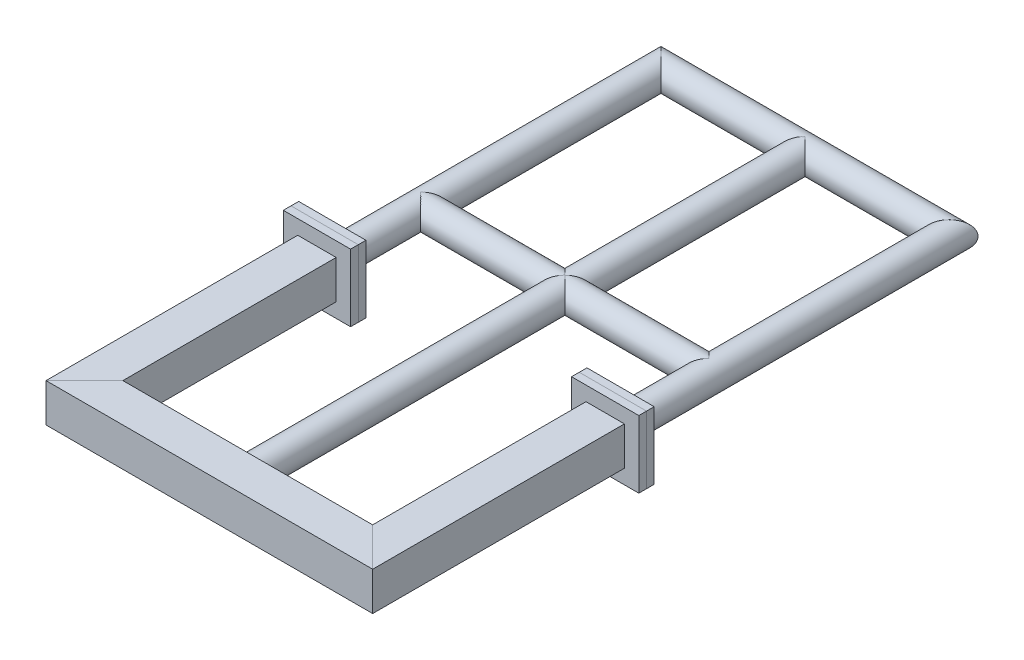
ISO-10303-21;
HEADER;
FILE_DESCRIPTION(('STEP AP214'),'2;1');
FILE_NAME('part.step','',(''),(''),'','','');
FILE_SCHEMA(('AUTOMOTIVE_DESIGN { 1 0 10303 214 1 1 1 1 }'));
ENDSEC;
DATA;
#1=APPLICATION_CONTEXT('core data for automotive mechanical design processes');
#2=APPLICATION_PROTOCOL_DEFINITION('international standard','automotive_design',2000,#1);
#3=PRODUCT_CONTEXT('',#1,'mechanical');
#4=PRODUCT('Part','Part','',(#3));
#5=PRODUCT_RELATED_PRODUCT_CATEGORY('part','',(#4));
#6=PRODUCT_DEFINITION_FORMATION('','',#4);
#7=PRODUCT_DEFINITION_CONTEXT('part definition',#1,'design');
#8=PRODUCT_DEFINITION('design','',#6,#7);
#9=PRODUCT_DEFINITION_SHAPE('','',#8);
#10=(LENGTH_UNIT() NAMED_UNIT(*) SI_UNIT(.MILLI.,.METRE.));
#11=(NAMED_UNIT(*) PLANE_ANGLE_UNIT() SI_UNIT($,.RADIAN.));
#12=(NAMED_UNIT(*) SI_UNIT($,.STERADIAN.) SOLID_ANGLE_UNIT());
#13=UNCERTAINTY_MEASURE_WITH_UNIT(LENGTH_MEASURE(1.E-05),#10,'distance_accuracy_value','');
#14=(GEOMETRIC_REPRESENTATION_CONTEXT(3) GLOBAL_UNCERTAINTY_ASSIGNED_CONTEXT((#13)) GLOBAL_UNIT_ASSIGNED_CONTEXT((#10,
#11,#12)) REPRESENTATION_CONTEXT('',''));
#15=CARTESIAN_POINT('',(0.,0.,0.));
#16=DIRECTION('',(0.,0.,1.));
#17=DIRECTION('',(1.,0.,0.));
#18=AXIS2_PLACEMENT_3D('',#15,#16,#17);
#19=CARTESIAN_POINT('',(300.,0.,-250.));
#20=DIRECTION('',(0.,0.,-1.));
#21=DIRECTION('',(-1.,0.,0.));
#22=AXIS2_PLACEMENT_3D('',#19,#20,#21);
#23=CYLINDRICAL_SURFACE('',#22,10.);
#24=CARTESIAN_POINT('',(300.,0.,-258.));
#25=DIRECTION('',(0.,0.,-1.));
#26=DIRECTION('',(-1.,0.,0.));
#27=AXIS2_PLACEMENT_3D('',#24,#25,#26);
#28=CIRCLE('',#27,10.);
#29=CARTESIAN_POINT('',(290.,0.,-258.));
#30=VERTEX_POINT('',#29);
#31=EDGE_CURVE('E96',#30,#30,#28,.T.);
#32=ORIENTED_EDGE('',*,*,#31,.F.);
#33=EDGE_LOOP('',(#32));
#34=FACE_BOUND('',#33,.T.);
#35=CARTESIAN_POINT('',(300.,0.,-600.));
#36=DIRECTION('',(-0.707106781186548,0.,-0.707106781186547));
#37=DIRECTION('',(0.707106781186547,0.,-0.707106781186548));
#38=AXIS2_PLACEMENT_3D('',#35,#36,#37);
#39=ELLIPSE('',#38,14.142135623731,10.);
#40=CARTESIAN_POINT('',(310.,0.,-610.));
#41=VERTEX_POINT('',#40);
#42=EDGE_CURVE('E92',#41,#41,#39,.T.);
#43=ORIENTED_EDGE('',*,*,#42,.T.);
#44=EDGE_LOOP('',(#43));
#45=FACE_BOUND('',#44,.T.);
#46=ADVANCED_FACE('F88',(#34,#45),#23,.F.);
#47=CARTESIAN_POINT('',(300.,0.,-250.));
#48=DIRECTION('',(0.,0.,-1.));
#49=DIRECTION('',(-1.,0.,0.));
#50=AXIS2_PLACEMENT_3D('',#47,#48,#49);
#51=CYLINDRICAL_SURFACE('',#50,15.);
#52=CARTESIAN_POINT('',(300.,0.,-258.));
#53=DIRECTION('',(0.,0.,-1.));
#54=DIRECTION('',(-1.,0.,0.));
#55=AXIS2_PLACEMENT_3D('',#52,#53,#54);
#56=CIRCLE('',#55,15.);
#57=CARTESIAN_POINT('',(285.,0.,-258.));
#58=VERTEX_POINT('',#57);
#59=EDGE_CURVE('E101',#58,#58,#56,.T.);
#60=ORIENTED_EDGE('',*,*,#59,.T.);
#61=EDGE_LOOP('',(#60));
#62=FACE_BOUND('',#61,.T.);
#63=CARTESIAN_POINT('',(300.,0.,-600.));
#64=DIRECTION('',(-0.707106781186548,0.,-0.707106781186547));
#65=DIRECTION('',(0.707106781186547,0.,-0.707106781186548));
#66=AXIS2_PLACEMENT_3D('',#63,#64,#65);
#67=ELLIPSE('',#66,21.2132034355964,15.);
#68=CARTESIAN_POINT('',(315.,0.,-615.));
#69=VERTEX_POINT('',#68);
#70=EDGE_CURVE('E13',#69,#69,#67,.T.);
#71=ORIENTED_EDGE('',*,*,#70,.F.);
#72=EDGE_LOOP('',(#71));
#73=FACE_BOUND('',#72,.T.);
#74=ADVANCED_FACE('F115',(#62,#73),#51,.T.);
#75=CARTESIAN_POINT('',(0.,0.,-258.));
#76=DIRECTION('',(0.,0.,-1.));
#77=DIRECTION('',(-1.,0.,0.));
#78=AXIS2_PLACEMENT_3D('',#75,#76,#77);
#79=PLANE('',#78);
#80=ORIENTED_EDGE('',*,*,#31,.T.);
#81=EDGE_LOOP('',(#80));
#82=FACE_BOUND('',#81,.T.);
#83=ORIENTED_EDGE('',*,*,#59,.F.);
#84=EDGE_LOOP('',(#83));
#85=FACE_BOUND('',#84,.T.);
#86=ADVANCED_FACE('F111',(#82,#85),#79,.F.);
#87=CARTESIAN_POINT('',(300.,0.,-600.));
#88=DIRECTION('',(-0.707106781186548,0.,-0.707106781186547));
#89=DIRECTION('',(-0.707106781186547,0.,0.707106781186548));
#90=AXIS2_PLACEMENT_3D('',#87,#88,#89);
#91=PLANE('',#90);
#92=ORIENTED_EDGE('',*,*,#42,.F.);
#93=EDGE_LOOP('',(#92));
#94=FACE_BOUND('',#93,.T.);
#95=ORIENTED_EDGE('',*,*,#70,.T.);
#96=EDGE_LOOP('',(#95));
#97=FACE_BOUND('',#96,.T.);
#98=ADVANCED_FACE('F90',(#94,#97),#91,.T.);
#99=CLOSED_SHELL('',(#46,#74,#86,#98));
#100=MANIFOLD_SOLID_BREP('B2',#99);
#101=CARTESIAN_POINT('',(0.,0.,-600.));
#102=DIRECTION('',(0.,0.,1.));
#103=DIRECTION('',(1.,0.,0.));
#104=AXIS2_PLACEMENT_3D('',#101,#102,#103);
#105=CYLINDRICAL_SURFACE('',#104,10.);
#106=CARTESIAN_POINT('',(0.,0.,-258.));
#107=DIRECTION('',(0.,0.,-1.));
#108=DIRECTION('',(-1.,0.,0.));
#109=AXIS2_PLACEMENT_3D('',#106,#107,#108);
#110=CIRCLE('',#109,10.);
#111=CARTESIAN_POINT('',(-10.,0.,-258.));
#112=VERTEX_POINT('',#111);
#113=EDGE_CURVE('E176',#112,#112,#110,.T.);
#114=ORIENTED_EDGE('',*,*,#113,.F.);
#115=EDGE_LOOP('',(#114));
#116=FACE_BOUND('',#115,.T.);
#117=CARTESIAN_POINT('',(0.,0.,-600.));
#118=DIRECTION('',(0.707106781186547,0.,-0.707106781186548));
#119=DIRECTION('',(0.707106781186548,0.,0.707106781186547));
#120=AXIS2_PLACEMENT_3D('',#117,#118,#119);
#121=ELLIPSE('',#120,14.142135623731,10.);
#122=CARTESIAN_POINT('',(10.,0.,-590.));
#123=VERTEX_POINT('',#122);
#124=EDGE_CURVE('E172',#123,#123,#121,.T.);
#125=ORIENTED_EDGE('',*,*,#124,.T.);
#126=EDGE_LOOP('',(#125));
#127=FACE_BOUND('',#126,.T.);
#128=ADVANCED_FACE('F168',(#116,#127),#105,.F.);
#129=CARTESIAN_POINT('',(0.,0.,-600.));
#130=DIRECTION('',(0.,0.,1.));
#131=DIRECTION('',(1.,0.,0.));
#132=AXIS2_PLACEMENT_3D('',#129,#130,#131);
#133=CYLINDRICAL_SURFACE('',#132,15.);
#134=CARTESIAN_POINT('',(0.,0.,-258.));
#135=DIRECTION('',(0.,0.,-1.));
#136=DIRECTION('',(-1.,0.,0.));
#137=AXIS2_PLACEMENT_3D('',#134,#135,#136);
#138=CIRCLE('',#137,15.);
#139=CARTESIAN_POINT('',(-15.,0.,-258.));
#140=VERTEX_POINT('',#139);
#141=EDGE_CURVE('E181',#140,#140,#138,.T.);
#142=ORIENTED_EDGE('',*,*,#141,.T.);
#143=EDGE_LOOP('',(#142));
#144=FACE_BOUND('',#143,.T.);
#145=CARTESIAN_POINT('',(0.,0.,-600.));
#146=DIRECTION('',(0.707106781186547,0.,-0.707106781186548));
#147=DIRECTION('',(0.707106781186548,0.,0.707106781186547));
#148=AXIS2_PLACEMENT_3D('',#145,#146,#147);
#149=ELLIPSE('',#148,21.2132034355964,15.);
#150=CARTESIAN_POINT('',(15.,0.,-585.));
#151=VERTEX_POINT('',#150);
#152=EDGE_CURVE('E87',#151,#151,#149,.T.);
#153=ORIENTED_EDGE('',*,*,#152,.F.);
#154=EDGE_LOOP('',(#153));
#155=FACE_BOUND('',#154,.T.);
#156=ADVANCED_FACE('F195',(#144,#155),#133,.T.);
#157=CARTESIAN_POINT('',(0.,0.,-258.));
#158=DIRECTION('',(0.,0.,-1.));
#159=DIRECTION('',(-1.,0.,0.));
#160=AXIS2_PLACEMENT_3D('',#157,#158,#159);
#161=PLANE('',#160);
#162=ORIENTED_EDGE('',*,*,#113,.T.);
#163=EDGE_LOOP('',(#162));
#164=FACE_BOUND('',#163,.T.);
#165=ORIENTED_EDGE('',*,*,#141,.F.);
#166=EDGE_LOOP('',(#165));
#167=FACE_BOUND('',#166,.T.);
#168=ADVANCED_FACE('F191',(#164,#167),#161,.F.);
#169=CARTESIAN_POINT('',(0.,0.,-600.));
#170=DIRECTION('',(0.707106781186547,0.,-0.707106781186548));
#171=DIRECTION('',(-0.707106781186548,0.,-0.707106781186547));
#172=AXIS2_PLACEMENT_3D('',#169,#170,#171);
#173=PLANE('',#172);
#174=ORIENTED_EDGE('',*,*,#124,.F.);
#175=EDGE_LOOP('',(#174));
#176=FACE_BOUND('',#175,.T.);
#177=ORIENTED_EDGE('',*,*,#152,.T.);
#178=EDGE_LOOP('',(#177));
#179=FACE_BOUND('',#178,.T.);
#180=ADVANCED_FACE('F170',(#176,#179),#173,.T.);
#181=CLOSED_SHELL('',(#128,#156,#168,#180));
#182=MANIFOLD_SOLID_BREP('B8',#181);
#183=CARTESIAN_POINT('',(283.,17.,0.));
#184=DIRECTION('',(0.,-1.,0.));
#185=DIRECTION('',(0.,0.,-1.));
#186=AXIS2_PLACEMENT_3D('',#183,#184,#185);
#187=PLANE('',#186);
#188=DIRECTION('',(0.,0.,-1.));
#189=VECTOR('',#188,1.);
#190=CARTESIAN_POINT('',(317.,17.,0.));
#191=LINE('',#190,#189);
#192=CARTESIAN_POINT('',(317.,17.,17.0000000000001));
#193=VERTEX_POINT('',#192);
#194=CARTESIAN_POINT('',(317.,17.,-242.));
#195=VERTEX_POINT('',#194);
#196=EDGE_CURVE('E316',#193,#195,#191,.T.);
#197=ORIENTED_EDGE('',*,*,#196,.F.);
#198=DIRECTION('',(-0.707106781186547,0.,-0.707106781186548));
#199=VECTOR('',#198,1.);
#200=CARTESIAN_POINT('',(291.5,17.,-8.49999999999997));
#201=LINE('',#200,#199);
#202=CARTESIAN_POINT('',(283.,17.,-17.));
#203=VERTEX_POINT('',#202);
#204=EDGE_CURVE('E267',#193,#203,#201,.T.);
#205=ORIENTED_EDGE('',*,*,#204,.T.);
#206=DIRECTION('',(0.,0.,-1.));
#207=VECTOR('',#206,1.);
#208=CARTESIAN_POINT('',(283.,17.,0.));
#209=LINE('',#208,#207);
#210=CARTESIAN_POINT('',(283.,17.,-242.));
#211=VERTEX_POINT('',#210);
#212=EDGE_CURVE('E363',#203,#211,#209,.T.);
#213=ORIENTED_EDGE('',*,*,#212,.T.);
#214=DIRECTION('',(-1.,0.,0.));
#215=VECTOR('',#214,1.);
#216=CARTESIAN_POINT('',(283.,17.,-242.));
#217=LINE('',#216,#215);
#218=EDGE_CURVE('E370',#195,#211,#217,.T.);
#219=ORIENTED_EDGE('',*,*,#218,.F.);
#220=EDGE_LOOP('',(#197,#205,#213,#219));
#221=FACE_BOUND('',#220,.T.);
#222=ADVANCED_FACE('F248',(#221),#187,.T.);
#223=CARTESIAN_POINT('',(283.,17.,0.));
#224=DIRECTION('',(1.,0.,0.));
#225=DIRECTION('',(0.,0.,-1.));
#226=AXIS2_PLACEMENT_3D('',#223,#224,#225);
#227=PLANE('',#226);
#228=ORIENTED_EDGE('',*,*,#212,.F.);
#229=DIRECTION('',(0.,-1.,0.));
#230=VECTOR('',#229,1.);
#231=CARTESIAN_POINT('',(283.,17.,-17.));
#232=LINE('',#231,#230);
#233=CARTESIAN_POINT('',(283.,-17.,-17.));
#234=VERTEX_POINT('',#233);
#235=EDGE_CURVE('E364',#203,#234,#232,.T.);
#236=ORIENTED_EDGE('',*,*,#235,.T.);
#237=DIRECTION('',(0.,0.,-1.));
#238=VECTOR('',#237,1.);
#239=CARTESIAN_POINT('',(283.,-17.,0.));
#240=LINE('',#239,#238);
#241=CARTESIAN_POINT('',(283.,-17.,-242.));
#242=VERTEX_POINT('',#241);
#243=EDGE_CURVE('E323',#234,#242,#240,.T.);
#244=ORIENTED_EDGE('',*,*,#243,.T.);
#245=DIRECTION('',(0.,-1.,0.));
#246=VECTOR('',#245,1.);
#247=CARTESIAN_POINT('',(283.,17.,-242.));
#248=LINE('',#247,#246);
#249=EDGE_CURVE('E377',#211,#242,#248,.T.);
#250=ORIENTED_EDGE('',*,*,#249,.F.);
#251=EDGE_LOOP('',(#228,#236,#244,#250));
#252=FACE_BOUND('',#251,.T.);
#253=ADVANCED_FACE('F379',(#252),#227,.T.);
#254=CARTESIAN_POINT('',(283.,-17.,0.));
#255=DIRECTION('',(0.,1.,0.));
#256=DIRECTION('',(0.,0.,1.));
#257=AXIS2_PLACEMENT_3D('',#254,#255,#256);
#258=PLANE('',#257);
#259=ORIENTED_EDGE('',*,*,#243,.F.);
#260=DIRECTION('',(0.707106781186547,0.,0.707106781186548));
#261=VECTOR('',#260,1.);
#262=CARTESIAN_POINT('',(291.5,-17.,-8.49999999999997));
#263=LINE('',#262,#261);
#264=CARTESIAN_POINT('',(317.,-17.,17.));
#265=VERTEX_POINT('',#264);
#266=EDGE_CURVE('E309',#234,#265,#263,.T.);
#267=ORIENTED_EDGE('',*,*,#266,.T.);
#268=DIRECTION('',(0.,0.,-1.));
#269=VECTOR('',#268,1.);
#270=CARTESIAN_POINT('',(317.,-17.,0.));
#271=LINE('',#270,#269);
#272=CARTESIAN_POINT('',(317.,-17.,-242.));
#273=VERTEX_POINT('',#272);
#274=EDGE_CURVE('E317',#265,#273,#271,.T.);
#275=ORIENTED_EDGE('',*,*,#274,.T.);
#276=DIRECTION('',(1.,0.,0.));
#277=VECTOR('',#276,1.);
#278=CARTESIAN_POINT('',(283.,-17.,-242.));
#279=LINE('',#278,#277);
#280=EDGE_CURVE('E361',#242,#273,#279,.T.);
#281=ORIENTED_EDGE('',*,*,#280,.F.);
#282=EDGE_LOOP('',(#259,#267,#275,#281));
#283=FACE_BOUND('',#282,.T.);
#284=ADVANCED_FACE('F320',(#283),#258,.T.);
#285=CARTESIAN_POINT('',(317.,17.,0.));
#286=DIRECTION('',(-1.,0.,0.));
#287=DIRECTION('',(0.,-1.,0.));
#288=AXIS2_PLACEMENT_3D('',#285,#286,#287);
#289=PLANE('',#288);
#290=ORIENTED_EDGE('',*,*,#274,.F.);
#291=DIRECTION('',(0.,1.,0.));
#292=VECTOR('',#291,1.);
#293=CARTESIAN_POINT('',(317.,17.,17.0000000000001));
#294=LINE('',#293,#292);
#295=EDGE_CURVE('E312',#265,#193,#294,.T.);
#296=ORIENTED_EDGE('',*,*,#295,.T.);
#297=ORIENTED_EDGE('',*,*,#196,.T.);
#298=DIRECTION('',(0.,1.,0.));
#299=VECTOR('',#298,1.);
#300=CARTESIAN_POINT('',(317.,17.,-242.));
#301=LINE('',#300,#299);
#302=EDGE_CURVE('E329',#273,#195,#301,.T.);
#303=ORIENTED_EDGE('',*,*,#302,.F.);
#304=EDGE_LOOP('',(#290,#296,#297,#303));
#305=FACE_BOUND('',#304,.T.);
#306=ADVANCED_FACE('F327',(#305),#289,.T.);
#307=CARTESIAN_POINT('',(280.,-20.,0.));
#308=DIRECTION('',(0.,1.,0.));
#309=DIRECTION('',(0.,0.,1.));
#310=AXIS2_PLACEMENT_3D('',#307,#308,#309);
#311=PLANE('',#310);
#312=DIRECTION('',(0.707106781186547,0.,0.707106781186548));
#313=VECTOR('',#312,1.);
#314=CARTESIAN_POINT('',(290.,-20.,-9.99999999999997));
#315=LINE('',#314,#313);
#316=CARTESIAN_POINT('',(280.,-20.,-20.));
#317=VERTEX_POINT('',#316);
#318=CARTESIAN_POINT('',(320.,-20.,20.0000000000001));
#319=VERTEX_POINT('',#318);
#320=EDGE_CURVE('E358',#317,#319,#315,.T.);
#321=ORIENTED_EDGE('',*,*,#320,.F.);
#322=DIRECTION('',(0.,0.,-1.));
#323=VECTOR('',#322,1.);
#324=CARTESIAN_POINT('',(280.,-20.,0.));
#325=LINE('',#324,#323);
#326=CARTESIAN_POINT('',(280.,-20.,-242.));
#327=VERTEX_POINT('',#326);
#328=EDGE_CURVE('E335',#317,#327,#325,.T.);
#329=ORIENTED_EDGE('',*,*,#328,.T.);
#330=DIRECTION('',(1.,0.,0.));
#331=VECTOR('',#330,1.);
#332=CARTESIAN_POINT('',(280.,-20.,-242.));
#333=LINE('',#332,#331);
#334=CARTESIAN_POINT('',(320.,-20.,-242.));
#335=VERTEX_POINT('',#334);
#336=EDGE_CURVE('E338',#327,#335,#333,.T.);
#337=ORIENTED_EDGE('',*,*,#336,.T.);
#338=DIRECTION('',(0.,0.,-1.));
#339=VECTOR('',#338,1.);
#340=CARTESIAN_POINT('',(320.,-20.,0.));
#341=LINE('',#340,#339);
#342=EDGE_CURVE('E252',#319,#335,#341,.T.);
#343=ORIENTED_EDGE('',*,*,#342,.F.);
#344=EDGE_LOOP('',(#321,#329,#337,#343));
#345=FACE_BOUND('',#344,.T.);
#346=ADVANCED_FACE('F392',(#345),#311,.F.);
#347=CARTESIAN_POINT('',(280.,20.,0.));
#348=DIRECTION('',(1.,0.,0.));
#349=DIRECTION('',(0.,0.,-1.));
#350=AXIS2_PLACEMENT_3D('',#347,#348,#349);
#351=PLANE('',#350);
#352=DIRECTION('',(0.,-1.,0.));
#353=VECTOR('',#352,1.);
#354=CARTESIAN_POINT('',(280.,20.,-20.));
#355=LINE('',#354,#353);
#356=CARTESIAN_POINT('',(280.,20.,-20.));
#357=VERTEX_POINT('',#356);
#358=EDGE_CURVE('E166',#357,#317,#355,.T.);
#359=ORIENTED_EDGE('',*,*,#358,.F.);
#360=DIRECTION('',(0.,0.,-1.));
#361=VECTOR('',#360,1.);
#362=CARTESIAN_POINT('',(280.,20.,0.));
#363=LINE('',#362,#361);
#364=CARTESIAN_POINT('',(280.,20.,-242.));
#365=VERTEX_POINT('',#364);
#366=EDGE_CURVE('E336',#357,#365,#363,.T.);
#367=ORIENTED_EDGE('',*,*,#366,.T.);
#368=DIRECTION('',(0.,-1.,0.));
#369=VECTOR('',#368,1.);
#370=CARTESIAN_POINT('',(280.,20.,-242.));
#371=LINE('',#370,#369);
#372=EDGE_CURVE('E337',#365,#327,#371,.T.);
#373=ORIENTED_EDGE('',*,*,#372,.T.);
#374=ORIENTED_EDGE('',*,*,#328,.F.);
#375=EDGE_LOOP('',(#359,#367,#373,#374));
#376=FACE_BOUND('',#375,.T.);
#377=ADVANCED_FACE('F394',(#376),#351,.F.);
#378=CARTESIAN_POINT('',(280.,20.,0.));
#379=DIRECTION('',(0.,-1.,0.));
#380=DIRECTION('',(0.,0.,-1.));
#381=AXIS2_PLACEMENT_3D('',#378,#379,#380);
#382=PLANE('',#381);
#383=DIRECTION('',(-0.707106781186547,0.,-0.707106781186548));
#384=VECTOR('',#383,1.);
#385=CARTESIAN_POINT('',(290.,20.,-9.99999999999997));
#386=LINE('',#385,#384);
#387=CARTESIAN_POINT('',(320.,20.,20.0000000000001));
#388=VERTEX_POINT('',#387);
#389=EDGE_CURVE('E258',#388,#357,#386,.T.);
#390=ORIENTED_EDGE('',*,*,#389,.F.);
#391=DIRECTION('',(0.,0.,-1.));
#392=VECTOR('',#391,1.);
#393=CARTESIAN_POINT('',(320.,20.,0.));
#394=LINE('',#393,#392);
#395=CARTESIAN_POINT('',(320.,20.,-242.));
#396=VERTEX_POINT('',#395);
#397=EDGE_CURVE('E339',#388,#396,#394,.T.);
#398=ORIENTED_EDGE('',*,*,#397,.T.);
#399=DIRECTION('',(-1.,0.,0.));
#400=VECTOR('',#399,1.);
#401=CARTESIAN_POINT('',(280.,20.,-242.));
#402=LINE('',#401,#400);
#403=EDGE_CURVE('E340',#396,#365,#402,.T.);
#404=ORIENTED_EDGE('',*,*,#403,.T.);
#405=ORIENTED_EDGE('',*,*,#366,.F.);
#406=EDGE_LOOP('',(#390,#398,#404,#405));
#407=FACE_BOUND('',#406,.T.);
#408=ADVANCED_FACE('F396',(#407),#382,.F.);
#409=CARTESIAN_POINT('',(320.,20.,0.));
#410=DIRECTION('',(-1.,0.,0.));
#411=DIRECTION('',(0.,0.,1.));
#412=AXIS2_PLACEMENT_3D('',#409,#410,#411);
#413=PLANE('',#412);
#414=DIRECTION('',(0.,1.,0.));
#415=VECTOR('',#414,1.);
#416=CARTESIAN_POINT('',(320.,20.,20.0000000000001));
#417=LINE('',#416,#415);
#418=EDGE_CURVE('E355',#319,#388,#417,.T.);
#419=ORIENTED_EDGE('',*,*,#418,.F.);
#420=ORIENTED_EDGE('',*,*,#342,.T.);
#421=DIRECTION('',(0.,1.,0.));
#422=VECTOR('',#421,1.);
#423=CARTESIAN_POINT('',(320.,20.,-242.));
#424=LINE('',#423,#422);
#425=EDGE_CURVE('E383',#335,#396,#424,.T.);
#426=ORIENTED_EDGE('',*,*,#425,.T.);
#427=ORIENTED_EDGE('',*,*,#397,.F.);
#428=EDGE_LOOP('',(#419,#420,#426,#427));
#429=FACE_BOUND('',#428,.T.);
#430=ADVANCED_FACE('F388',(#429),#413,.F.);
#431=CARTESIAN_POINT('',(0.,0.,-242.));
#432=DIRECTION('',(0.,0.,1.));
#433=DIRECTION('',(1.,0.,0.));
#434=AXIS2_PLACEMENT_3D('',#431,#432,#433);
#435=PLANE('',#434);
#436=ORIENTED_EDGE('',*,*,#302,.T.);
#437=ORIENTED_EDGE('',*,*,#218,.T.);
#438=ORIENTED_EDGE('',*,*,#249,.T.);
#439=ORIENTED_EDGE('',*,*,#280,.T.);
#440=EDGE_LOOP('',(#436,#437,#438,#439));
#441=FACE_BOUND('',#440,.T.);
#442=ORIENTED_EDGE('',*,*,#336,.F.);
#443=ORIENTED_EDGE('',*,*,#372,.F.);
#444=ORIENTED_EDGE('',*,*,#403,.F.);
#445=ORIENTED_EDGE('',*,*,#425,.F.);
#446=EDGE_LOOP('',(#442,#443,#444,#445));
#447=FACE_BOUND('',#446,.T.);
#448=ADVANCED_FACE('F375',(#441,#447),#435,.F.);
#449=CARTESIAN_POINT('',(300.,0.,0.));
#450=DIRECTION('',(-0.707106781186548,0.,0.707106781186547));
#451=DIRECTION('',(0.707106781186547,0.,0.707106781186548));
#452=AXIS2_PLACEMENT_3D('',#449,#450,#451);
#453=PLANE('',#452);
#454=ORIENTED_EDGE('',*,*,#295,.F.);
#455=ORIENTED_EDGE('',*,*,#266,.F.);
#456=ORIENTED_EDGE('',*,*,#235,.F.);
#457=ORIENTED_EDGE('',*,*,#204,.F.);
#458=EDGE_LOOP('',(#454,#455,#456,#457));
#459=FACE_BOUND('',#458,.T.);
#460=ORIENTED_EDGE('',*,*,#320,.T.);
#461=ORIENTED_EDGE('',*,*,#418,.T.);
#462=ORIENTED_EDGE('',*,*,#389,.T.);
#463=ORIENTED_EDGE('',*,*,#358,.T.);
#464=EDGE_LOOP('',(#460,#461,#462,#463));
#465=FACE_BOUND('',#464,.T.);
#466=ADVANCED_FACE('F250',(#459,#465),#453,.T.);
#467=CLOSED_SHELL('',(#222,#253,#284,#306,#346,#377,#408,#430,#448,#466));
#468=MANIFOLD_SOLID_BREP('B82',#467);
#469=CARTESIAN_POINT('',(17.,17.,-250.));
#470=DIRECTION('',(0.,-1.,0.));
#471=DIRECTION('',(0.,0.,-1.));
#472=AXIS2_PLACEMENT_3D('',#469,#470,#471);
#473=PLANE('',#472);
#474=DIRECTION('',(0.,0.,1.));
#475=VECTOR('',#474,1.);
#476=CARTESIAN_POINT('',(17.,17.,-250.));
#477=LINE('',#476,#475);
#478=CARTESIAN_POINT('',(17.,17.,-242.));
#479=VERTEX_POINT('',#478);
#480=CARTESIAN_POINT('',(17.,17.,-17.));
#481=VERTEX_POINT('',#480);
#482=EDGE_CURVE('E584',#479,#481,#477,.T.);
#483=ORIENTED_EDGE('',*,*,#482,.T.);
#484=DIRECTION('',(-0.707106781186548,0.,0.707106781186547));
#485=VECTOR('',#484,1.);
#486=CARTESIAN_POINT('',(133.5,17.,-133.5));
#487=LINE('',#486,#485);
#488=CARTESIAN_POINT('',(-17.,17.,17.));
#489=VERTEX_POINT('',#488);
#490=EDGE_CURVE('E569',#481,#489,#487,.T.);
#491=ORIENTED_EDGE('',*,*,#490,.T.);
#492=DIRECTION('',(0.,0.,1.));
#493=VECTOR('',#492,1.);
#494=CARTESIAN_POINT('',(-17.,17.,-250.));
#495=LINE('',#494,#493);
#496=CARTESIAN_POINT('',(-17.,17.,-242.));
#497=VERTEX_POINT('',#496);
#498=EDGE_CURVE('E578',#497,#489,#495,.T.);
#499=ORIENTED_EDGE('',*,*,#498,.F.);
#500=DIRECTION('',(-1.,0.,0.));
#501=VECTOR('',#500,1.);
#502=CARTESIAN_POINT('',(17.,17.,-242.));
#503=LINE('',#502,#501);
#504=EDGE_CURVE('E623',#479,#497,#503,.T.);
#505=ORIENTED_EDGE('',*,*,#504,.F.);
#506=EDGE_LOOP('',(#483,#491,#499,#505));
#507=FACE_BOUND('',#506,.T.);
#508=ADVANCED_FACE('F508',(#507),#473,.T.);
#509=CARTESIAN_POINT('',(17.,17.,-250.));
#510=DIRECTION('',(-1.,0.,0.));
#511=DIRECTION('',(0.,0.,1.));
#512=AXIS2_PLACEMENT_3D('',#509,#510,#511);
#513=PLANE('',#512);
#514=DIRECTION('',(0.,0.,1.));
#515=VECTOR('',#514,1.);
#516=CARTESIAN_POINT('',(17.,-17.,-250.));
#517=LINE('',#516,#515);
#518=CARTESIAN_POINT('',(17.,-17.,-242.));
#519=VERTEX_POINT('',#518);
#520=CARTESIAN_POINT('',(17.,-17.,-17.));
#521=VERTEX_POINT('',#520);
#522=EDGE_CURVE('E586',#519,#521,#517,.T.);
#523=ORIENTED_EDGE('',*,*,#522,.T.);
#524=DIRECTION('',(0.,1.,0.));
#525=VECTOR('',#524,1.);
#526=CARTESIAN_POINT('',(17.,17.,-17.));
#527=LINE('',#526,#525);
#528=EDGE_CURVE('E625',#521,#481,#527,.T.);
#529=ORIENTED_EDGE('',*,*,#528,.T.);
#530=ORIENTED_EDGE('',*,*,#482,.F.);
#531=DIRECTION('',(0.,1.,0.));
#532=VECTOR('',#531,1.);
#533=CARTESIAN_POINT('',(17.,17.,-242.));
#534=LINE('',#533,#532);
#535=EDGE_CURVE('E634',#519,#479,#534,.T.);
#536=ORIENTED_EDGE('',*,*,#535,.F.);
#537=EDGE_LOOP('',(#523,#529,#530,#536));
#538=FACE_BOUND('',#537,.T.);
#539=ADVANCED_FACE('F633',(#538),#513,.T.);
#540=CARTESIAN_POINT('',(17.,-17.,-250.));
#541=DIRECTION('',(0.,1.,0.));
#542=DIRECTION('',(0.,0.,1.));
#543=AXIS2_PLACEMENT_3D('',#540,#541,#542);
#544=PLANE('',#543);
#545=DIRECTION('',(0.,0.,1.));
#546=VECTOR('',#545,1.);
#547=CARTESIAN_POINT('',(-17.,-17.,-250.));
#548=LINE('',#547,#546);
#549=CARTESIAN_POINT('',(-17.,-17.,-242.));
#550=VERTEX_POINT('',#549);
#551=CARTESIAN_POINT('',(-17.,-17.,17.));
#552=VERTEX_POINT('',#551);
#553=EDGE_CURVE('E592',#550,#552,#548,.T.);
#554=ORIENTED_EDGE('',*,*,#553,.T.);
#555=DIRECTION('',(0.707106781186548,0.,-0.707106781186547));
#556=VECTOR('',#555,1.);
#557=CARTESIAN_POINT('',(133.5,-17.,-133.5));
#558=LINE('',#557,#556);
#559=EDGE_CURVE('E527',#552,#521,#558,.T.);
#560=ORIENTED_EDGE('',*,*,#559,.T.);
#561=ORIENTED_EDGE('',*,*,#522,.F.);
#562=DIRECTION('',(1.,0.,0.));
#563=VECTOR('',#562,1.);
#564=CARTESIAN_POINT('',(17.,-17.,-242.));
#565=LINE('',#564,#563);
#566=EDGE_CURVE('E638',#550,#519,#565,.T.);
#567=ORIENTED_EDGE('',*,*,#566,.F.);
#568=EDGE_LOOP('',(#554,#560,#561,#567));
#569=FACE_BOUND('',#568,.T.);
#570=ADVANCED_FACE('F637',(#569),#544,.T.);
#571=CARTESIAN_POINT('',(-17.,17.,-250.));
#572=DIRECTION('',(1.,0.,0.));
#573=DIRECTION('',(0.,1.,0.));
#574=AXIS2_PLACEMENT_3D('',#571,#572,#573);
#575=PLANE('',#574);
#576=ORIENTED_EDGE('',*,*,#498,.T.);
#577=DIRECTION('',(0.,-1.,0.));
#578=VECTOR('',#577,1.);
#579=CARTESIAN_POINT('',(-17.,17.0000000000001,17.));
#580=LINE('',#579,#578);
#581=EDGE_CURVE('E572',#489,#552,#580,.T.);
#582=ORIENTED_EDGE('',*,*,#581,.T.);
#583=ORIENTED_EDGE('',*,*,#553,.F.);
#584=DIRECTION('',(0.,-1.,0.));
#585=VECTOR('',#584,1.);
#586=CARTESIAN_POINT('',(-17.,17.,-242.));
#587=LINE('',#586,#585);
#588=EDGE_CURVE('E590',#497,#550,#587,.T.);
#589=ORIENTED_EDGE('',*,*,#588,.F.);
#590=EDGE_LOOP('',(#576,#582,#583,#589));
#591=FACE_BOUND('',#590,.T.);
#592=ADVANCED_FACE('F589',(#591),#575,.T.);
#593=CARTESIAN_POINT('',(20.,-20.,-250.));
#594=DIRECTION('',(0.,1.,0.));
#595=DIRECTION('',(0.,0.,1.));
#596=AXIS2_PLACEMENT_3D('',#593,#594,#595);
#597=PLANE('',#596);
#598=DIRECTION('',(0.707106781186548,0.,-0.707106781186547));
#599=VECTOR('',#598,1.);
#600=CARTESIAN_POINT('',(135.,-20.,-135.));
#601=LINE('',#600,#599);
#602=CARTESIAN_POINT('',(-20.,-20.,20.));
#603=VERTEX_POINT('',#602);
#604=CARTESIAN_POINT('',(20.,-20.,-20.));
#605=VERTEX_POINT('',#604);
#606=EDGE_CURVE('E518',#603,#605,#601,.T.);
#607=ORIENTED_EDGE('',*,*,#606,.F.);
#608=DIRECTION('',(0.,0.,1.));
#609=VECTOR('',#608,1.);
#610=CARTESIAN_POINT('',(-20.,-20.,-250.));
#611=LINE('',#610,#609);
#612=CARTESIAN_POINT('',(-20.,-20.,-242.));
#613=VERTEX_POINT('',#612);
#614=EDGE_CURVE('E512',#613,#603,#611,.T.);
#615=ORIENTED_EDGE('',*,*,#614,.F.);
#616=DIRECTION('',(1.,0.,0.));
#617=VECTOR('',#616,1.);
#618=CARTESIAN_POINT('',(20.,-20.,-242.));
#619=LINE('',#618,#617);
#620=CARTESIAN_POINT('',(20.,-20.,-242.));
#621=VERTEX_POINT('',#620);
#622=EDGE_CURVE('E577',#613,#621,#619,.T.);
#623=ORIENTED_EDGE('',*,*,#622,.T.);
#624=DIRECTION('',(0.,0.,1.));
#625=VECTOR('',#624,1.);
#626=CARTESIAN_POINT('',(20.,-20.,-250.));
#627=LINE('',#626,#625);
#628=EDGE_CURVE('E614',#621,#605,#627,.T.);
#629=ORIENTED_EDGE('',*,*,#628,.T.);
#630=EDGE_LOOP('',(#607,#615,#623,#629));
#631=FACE_BOUND('',#630,.T.);
#632=ADVANCED_FACE('F657',(#631),#597,.F.);
#633=CARTESIAN_POINT('',(20.,20.,-250.));
#634=DIRECTION('',(-1.,0.,0.));
#635=DIRECTION('',(0.,0.,1.));
#636=AXIS2_PLACEMENT_3D('',#633,#634,#635);
#637=PLANE('',#636);
#638=DIRECTION('',(0.,1.,0.));
#639=VECTOR('',#638,1.);
#640=CARTESIAN_POINT('',(20.,20.,-20.));
#641=LINE('',#640,#639);
#642=CARTESIAN_POINT('',(20.,20.,-20.));
#643=VERTEX_POINT('',#642);
#644=EDGE_CURVE('E246',#605,#643,#641,.T.);
#645=ORIENTED_EDGE('',*,*,#644,.F.);
#646=ORIENTED_EDGE('',*,*,#628,.F.);
#647=DIRECTION('',(0.,1.,0.));
#648=VECTOR('',#647,1.);
#649=CARTESIAN_POINT('',(20.,20.,-242.));
#650=LINE('',#649,#648);
#651=CARTESIAN_POINT('',(20.,20.,-242.));
#652=VERTEX_POINT('',#651);
#653=EDGE_CURVE('E600',#621,#652,#650,.T.);
#654=ORIENTED_EDGE('',*,*,#653,.T.);
#655=DIRECTION('',(0.,0.,1.));
#656=VECTOR('',#655,1.);
#657=CARTESIAN_POINT('',(20.,20.,-250.));
#658=LINE('',#657,#656);
#659=EDGE_CURVE('E597',#652,#643,#658,.T.);
#660=ORIENTED_EDGE('',*,*,#659,.T.);
#661=EDGE_LOOP('',(#645,#646,#654,#660));
#662=FACE_BOUND('',#661,.T.);
#663=ADVANCED_FACE('F652',(#662),#637,.F.);
#664=CARTESIAN_POINT('',(20.,20.,-250.));
#665=DIRECTION('',(0.,-1.,0.));
#666=DIRECTION('',(0.,0.,-1.));
#667=AXIS2_PLACEMENT_3D('',#664,#665,#666);
#668=PLANE('',#667);
#669=DIRECTION('',(-0.707106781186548,0.,0.707106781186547));
#670=VECTOR('',#669,1.);
#671=CARTESIAN_POINT('',(135.,20.,-135.));
#672=LINE('',#671,#670);
#673=CARTESIAN_POINT('',(-20.,20.,20.));
#674=VERTEX_POINT('',#673);
#675=EDGE_CURVE('E621',#643,#674,#672,.T.);
#676=ORIENTED_EDGE('',*,*,#675,.F.);
#677=ORIENTED_EDGE('',*,*,#659,.F.);
#678=DIRECTION('',(-1.,0.,0.));
#679=VECTOR('',#678,1.);
#680=CARTESIAN_POINT('',(20.,20.,-242.));
#681=LINE('',#680,#679);
#682=CARTESIAN_POINT('',(-20.,20.,-242.));
#683=VERTEX_POINT('',#682);
#684=EDGE_CURVE('E599',#652,#683,#681,.T.);
#685=ORIENTED_EDGE('',*,*,#684,.T.);
#686=DIRECTION('',(0.,0.,1.));
#687=VECTOR('',#686,1.);
#688=CARTESIAN_POINT('',(-20.,20.,-250.));
#689=LINE('',#688,#687);
#690=EDGE_CURVE('E601',#683,#674,#689,.T.);
#691=ORIENTED_EDGE('',*,*,#690,.T.);
#692=EDGE_LOOP('',(#676,#677,#685,#691));
#693=FACE_BOUND('',#692,.T.);
#694=ADVANCED_FACE('F650',(#693),#668,.F.);
#695=CARTESIAN_POINT('',(-20.,20.,-250.));
#696=DIRECTION('',(1.,0.,0.));
#697=DIRECTION('',(0.,0.,-1.));
#698=AXIS2_PLACEMENT_3D('',#695,#696,#697);
#699=PLANE('',#698);
#700=DIRECTION('',(0.,-1.,0.));
#701=VECTOR('',#700,1.);
#702=CARTESIAN_POINT('',(-20.,20.,20.));
#703=LINE('',#702,#701);
#704=EDGE_CURVE('E618',#674,#603,#703,.T.);
#705=ORIENTED_EDGE('',*,*,#704,.F.);
#706=ORIENTED_EDGE('',*,*,#690,.F.);
#707=DIRECTION('',(0.,-1.,0.));
#708=VECTOR('',#707,1.);
#709=CARTESIAN_POINT('',(-20.,20.,-242.));
#710=LINE('',#709,#708);
#711=EDGE_CURVE('E602',#683,#613,#710,.T.);
#712=ORIENTED_EDGE('',*,*,#711,.T.);
#713=ORIENTED_EDGE('',*,*,#614,.T.);
#714=EDGE_LOOP('',(#705,#706,#712,#713));
#715=FACE_BOUND('',#714,.T.);
#716=ADVANCED_FACE('F647',(#715),#699,.F.);
#717=CARTESIAN_POINT('',(0.,0.,-242.));
#718=DIRECTION('',(0.,0.,1.));
#719=DIRECTION('',(1.,0.,0.));
#720=AXIS2_PLACEMENT_3D('',#717,#718,#719);
#721=PLANE('',#720);
#722=ORIENTED_EDGE('',*,*,#588,.T.);
#723=ORIENTED_EDGE('',*,*,#566,.T.);
#724=ORIENTED_EDGE('',*,*,#535,.T.);
#725=ORIENTED_EDGE('',*,*,#504,.T.);
#726=EDGE_LOOP('',(#722,#723,#724,#725));
#727=FACE_BOUND('',#726,.T.);
#728=ORIENTED_EDGE('',*,*,#684,.F.);
#729=ORIENTED_EDGE('',*,*,#653,.F.);
#730=ORIENTED_EDGE('',*,*,#622,.F.);
#731=ORIENTED_EDGE('',*,*,#711,.F.);
#732=EDGE_LOOP('',(#728,#729,#730,#731));
#733=FACE_BOUND('',#732,.T.);
#734=ADVANCED_FACE('F644',(#727,#733),#721,.F.);
#735=CARTESIAN_POINT('',(0.,0.,0.));
#736=DIRECTION('',(0.707106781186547,0.,0.707106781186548));
#737=DIRECTION('',(0.707106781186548,0.,-0.707106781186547));
#738=AXIS2_PLACEMENT_3D('',#735,#736,#737);
#739=PLANE('',#738);
#740=ORIENTED_EDGE('',*,*,#581,.F.);
#741=ORIENTED_EDGE('',*,*,#490,.F.);
#742=ORIENTED_EDGE('',*,*,#528,.F.);
#743=ORIENTED_EDGE('',*,*,#559,.F.);
#744=EDGE_LOOP('',(#740,#741,#742,#743));
#745=FACE_BOUND('',#744,.T.);
#746=ORIENTED_EDGE('',*,*,#675,.T.);
#747=ORIENTED_EDGE('',*,*,#704,.T.);
#748=ORIENTED_EDGE('',*,*,#606,.T.);
#749=ORIENTED_EDGE('',*,*,#644,.T.);
#750=EDGE_LOOP('',(#746,#747,#748,#749));
#751=FACE_BOUND('',#750,.T.);
#752=ADVANCED_FACE('F510',(#745,#751),#739,.T.);
#753=CLOSED_SHELL('',(#508,#539,#570,#592,#632,#663,#694,#716,#734,#752));
#754=MANIFOLD_SOLID_BREP('B160',#753);
#755=CARTESIAN_POINT('',(265.,-35.,-242.));
#756=DIRECTION('',(-1.,0.,0.));
#757=DIRECTION('',(0.,-1.,0.));
#758=AXIS2_PLACEMENT_3D('',#755,#756,#757);
#759=PLANE('',#758);
#760=DIRECTION('',(0.,1.,0.));
#761=VECTOR('',#760,1.);
#762=CARTESIAN_POINT('',(265.,-35.,-250.));
#763=LINE('',#762,#761);
#764=CARTESIAN_POINT('',(265.,-35.,-250.));
#765=VERTEX_POINT('',#764);
#766=CARTESIAN_POINT('',(265.,35.,-250.));
#767=VERTEX_POINT('',#766);
#768=EDGE_CURVE('E832',#765,#767,#763,.T.);
#769=ORIENTED_EDGE('',*,*,#768,.F.);
#770=DIRECTION('',(0.,0.,-1.));
#771=VECTOR('',#770,1.);
#772=CARTESIAN_POINT('',(265.,-35.,-242.));
#773=LINE('',#772,#771);
#774=CARTESIAN_POINT('',(265.,-35.,-242.));
#775=VERTEX_POINT('',#774);
#776=EDGE_CURVE('E506',#775,#765,#773,.T.);
#777=ORIENTED_EDGE('',*,*,#776,.F.);
#778=DIRECTION('',(0.,1.,0.));
#779=VECTOR('',#778,1.);
#780=CARTESIAN_POINT('',(265.,-35.,-242.));
#781=LINE('',#780,#779);
#782=CARTESIAN_POINT('',(265.,35.,-242.));
#783=VERTEX_POINT('',#782);
#784=EDGE_CURVE('E826',#775,#783,#781,.T.);
#785=ORIENTED_EDGE('',*,*,#784,.T.);
#786=DIRECTION('',(0.,0.,-1.));
#787=VECTOR('',#786,1.);
#788=CARTESIAN_POINT('',(265.,35.,-242.));
#789=LINE('',#788,#787);
#790=EDGE_CURVE('E771',#783,#767,#789,.T.);
#791=ORIENTED_EDGE('',*,*,#790,.T.);
#792=EDGE_LOOP('',(#769,#777,#785,#791));
#793=FACE_BOUND('',#792,.T.);
#794=ADVANCED_FACE('F768',(#793),#759,.T.);
#795=CARTESIAN_POINT('',(335.,-35.,-242.));
#796=DIRECTION('',(0.,-1.,0.));
#797=DIRECTION('',(1.,0.,0.));
#798=AXIS2_PLACEMENT_3D('',#795,#796,#797);
#799=PLANE('',#798);
#800=DIRECTION('',(-1.,0.,0.));
#801=VECTOR('',#800,1.);
#802=CARTESIAN_POINT('',(335.,-35.,-250.));
#803=LINE('',#802,#801);
#804=CARTESIAN_POINT('',(335.,-35.,-250.));
#805=VERTEX_POINT('',#804);
#806=EDGE_CURVE('E828',#805,#765,#803,.T.);
#807=ORIENTED_EDGE('',*,*,#806,.F.);
#808=DIRECTION('',(0.,0.,-1.));
#809=VECTOR('',#808,1.);
#810=CARTESIAN_POINT('',(335.,-35.,-242.));
#811=LINE('',#810,#809);
#812=CARTESIAN_POINT('',(335.,-35.,-242.));
#813=VERTEX_POINT('',#812);
#814=EDGE_CURVE('E777',#813,#805,#811,.T.);
#815=ORIENTED_EDGE('',*,*,#814,.F.);
#816=DIRECTION('',(-1.,0.,0.));
#817=VECTOR('',#816,1.);
#818=CARTESIAN_POINT('',(335.,-35.,-242.));
#819=LINE('',#818,#817);
#820=EDGE_CURVE('E823',#813,#775,#819,.T.);
#821=ORIENTED_EDGE('',*,*,#820,.T.);
#822=ORIENTED_EDGE('',*,*,#776,.T.);
#823=EDGE_LOOP('',(#807,#815,#821,#822));
#824=FACE_BOUND('',#823,.T.);
#825=ADVANCED_FACE('F842',(#824),#799,.T.);
#826=CARTESIAN_POINT('',(335.,-35.,-242.));
#827=DIRECTION('',(1.,0.,0.));
#828=DIRECTION('',(0.,1.,0.));
#829=AXIS2_PLACEMENT_3D('',#826,#827,#828);
#830=PLANE('',#829);
#831=DIRECTION('',(0.,-1.,0.));
#832=VECTOR('',#831,1.);
#833=CARTESIAN_POINT('',(335.,-35.,-250.));
#834=LINE('',#833,#832);
#835=CARTESIAN_POINT('',(335.,35.,-250.));
#836=VERTEX_POINT('',#835);
#837=EDGE_CURVE('E818',#836,#805,#834,.T.);
#838=ORIENTED_EDGE('',*,*,#837,.F.);
#839=DIRECTION('',(0.,0.,-1.));
#840=VECTOR('',#839,1.);
#841=CARTESIAN_POINT('',(335.,35.,-242.));
#842=LINE('',#841,#840);
#843=CARTESIAN_POINT('',(335.,35.,-242.));
#844=VERTEX_POINT('',#843);
#845=EDGE_CURVE('E813',#844,#836,#842,.T.);
#846=ORIENTED_EDGE('',*,*,#845,.F.);
#847=DIRECTION('',(0.,-1.,0.));
#848=VECTOR('',#847,1.);
#849=CARTESIAN_POINT('',(335.,-35.,-242.));
#850=LINE('',#849,#848);
#851=EDGE_CURVE('E816',#844,#813,#850,.T.);
#852=ORIENTED_EDGE('',*,*,#851,.T.);
#853=ORIENTED_EDGE('',*,*,#814,.T.);
#854=EDGE_LOOP('',(#838,#846,#852,#853));
#855=FACE_BOUND('',#854,.T.);
#856=ADVANCED_FACE('F815',(#855),#830,.T.);
#857=CARTESIAN_POINT('',(335.,35.,-242.));
#858=DIRECTION('',(0.,1.,0.));
#859=DIRECTION('',(0.,0.,-1.));
#860=AXIS2_PLACEMENT_3D('',#857,#858,#859);
#861=PLANE('',#860);
#862=DIRECTION('',(1.,0.,0.));
#863=VECTOR('',#862,1.);
#864=CARTESIAN_POINT('',(335.,35.,-250.));
#865=LINE('',#864,#863);
#866=EDGE_CURVE('E835',#767,#836,#865,.T.);
#867=ORIENTED_EDGE('',*,*,#866,.F.);
#868=ORIENTED_EDGE('',*,*,#790,.F.);
#869=DIRECTION('',(1.,0.,0.));
#870=VECTOR('',#869,1.);
#871=CARTESIAN_POINT('',(335.,35.,-242.));
#872=LINE('',#871,#870);
#873=EDGE_CURVE('E822',#783,#844,#872,.T.);
#874=ORIENTED_EDGE('',*,*,#873,.T.);
#875=ORIENTED_EDGE('',*,*,#845,.T.);
#876=EDGE_LOOP('',(#867,#868,#874,#875));
#877=FACE_BOUND('',#876,.T.);
#878=ADVANCED_FACE('F825',(#877),#861,.T.);
#879=CARTESIAN_POINT('',(265.,35.,-242.));
#880=DIRECTION('',(0.,0.,1.));
#881=DIRECTION('',(-1.,0.,0.));
#882=AXIS2_PLACEMENT_3D('',#879,#880,#881);
#883=PLANE('',#882);
#884=ORIENTED_EDGE('',*,*,#784,.F.);
#885=ORIENTED_EDGE('',*,*,#820,.F.);
#886=ORIENTED_EDGE('',*,*,#851,.F.);
#887=ORIENTED_EDGE('',*,*,#873,.F.);
#888=EDGE_LOOP('',(#884,#885,#886,#887));
#889=FACE_BOUND('',#888,.T.);
#890=ADVANCED_FACE('F821',(#889),#883,.T.);
#891=CARTESIAN_POINT('',(265.,35.,-250.));
#892=DIRECTION('',(0.,0.,1.));
#893=DIRECTION('',(-1.,0.,0.));
#894=AXIS2_PLACEMENT_3D('',#891,#892,#893);
#895=PLANE('',#894);
#896=ORIENTED_EDGE('',*,*,#768,.T.);
#897=ORIENTED_EDGE('',*,*,#866,.T.);
#898=ORIENTED_EDGE('',*,*,#837,.T.);
#899=ORIENTED_EDGE('',*,*,#806,.T.);
#900=EDGE_LOOP('',(#896,#897,#898,#899));
#901=FACE_BOUND('',#900,.T.);
#902=ADVANCED_FACE('F841',(#901),#895,.F.);
#903=CLOSED_SHELL('',(#794,#825,#856,#878,#890,#902));
#904=MANIFOLD_SOLID_BREP('B240',#903);
#905=CARTESIAN_POINT('',(335.,-35.,-258.));
#906=DIRECTION('',(0.,1.,0.));
#907=DIRECTION('',(-1.,0.,0.));
#908=AXIS2_PLACEMENT_3D('',#905,#906,#907);
#909=PLANE('',#908);
#910=DIRECTION('',(-1.,0.,0.));
#911=VECTOR('',#910,1.);
#912=CARTESIAN_POINT('',(335.,-35.,-250.));
#913=LINE('',#912,#911);
#914=CARTESIAN_POINT('',(335.,-35.,-250.));
#915=VERTEX_POINT('',#914);
#916=CARTESIAN_POINT('',(265.,-35.,-250.));
#917=VERTEX_POINT('',#916);
#918=EDGE_CURVE('E977',#915,#917,#913,.T.);
#919=ORIENTED_EDGE('',*,*,#918,.T.);
#920=DIRECTION('',(0.,0.,1.));
#921=VECTOR('',#920,1.);
#922=CARTESIAN_POINT('',(265.,-35.,-258.));
#923=LINE('',#922,#921);
#924=CARTESIAN_POINT('',(265.,-35.,-258.));
#925=VERTEX_POINT('',#924);
#926=EDGE_CURVE('E766',#925,#917,#923,.T.);
#927=ORIENTED_EDGE('',*,*,#926,.F.);
#928=DIRECTION('',(-1.,0.,0.));
#929=VECTOR('',#928,1.);
#930=CARTESIAN_POINT('',(335.,-35.,-258.));
#931=LINE('',#930,#929);
#932=CARTESIAN_POINT('',(335.,-35.,-258.));
#933=VERTEX_POINT('',#932);
#934=EDGE_CURVE('E965',#933,#925,#931,.T.);
#935=ORIENTED_EDGE('',*,*,#934,.F.);
#936=DIRECTION('',(0.,0.,1.));
#937=VECTOR('',#936,1.);
#938=CARTESIAN_POINT('',(335.,-35.,-258.));
#939=LINE('',#938,#937);
#940=EDGE_CURVE('E973',#933,#915,#939,.T.);
#941=ORIENTED_EDGE('',*,*,#940,.T.);
#942=EDGE_LOOP('',(#919,#927,#935,#941));
#943=FACE_BOUND('',#942,.T.);
#944=ADVANCED_FACE('F914',(#943),#909,.F.);
#945=CARTESIAN_POINT('',(265.,-35.,-258.));
#946=DIRECTION('',(1.,0.,0.));
#947=DIRECTION('',(0.,1.,0.));
#948=AXIS2_PLACEMENT_3D('',#945,#946,#947);
#949=PLANE('',#948);
#950=DIRECTION('',(0.,1.,0.));
#951=VECTOR('',#950,1.);
#952=CARTESIAN_POINT('',(265.,-35.,-250.));
#953=LINE('',#952,#951);
#954=CARTESIAN_POINT('',(265.,35.,-250.));
#955=VERTEX_POINT('',#954);
#956=EDGE_CURVE('E969',#917,#955,#953,.T.);
#957=ORIENTED_EDGE('',*,*,#956,.T.);
#958=DIRECTION('',(0.,0.,1.));
#959=VECTOR('',#958,1.);
#960=CARTESIAN_POINT('',(265.,35.,-258.));
#961=LINE('',#960,#959);
#962=CARTESIAN_POINT('',(265.,35.,-258.));
#963=VERTEX_POINT('',#962);
#964=EDGE_CURVE('E922',#963,#955,#961,.T.);
#965=ORIENTED_EDGE('',*,*,#964,.F.);
#966=DIRECTION('',(0.,1.,0.));
#967=VECTOR('',#966,1.);
#968=CARTESIAN_POINT('',(265.,-35.,-258.));
#969=LINE('',#968,#967);
#970=EDGE_CURVE('E960',#925,#963,#969,.T.);
#971=ORIENTED_EDGE('',*,*,#970,.F.);
#972=ORIENTED_EDGE('',*,*,#926,.T.);
#973=EDGE_LOOP('',(#957,#965,#971,#972));
#974=FACE_BOUND('',#973,.T.);
#975=ADVANCED_FACE('F968',(#974),#949,.F.);
#976=CARTESIAN_POINT('',(265.,35.,-258.));
#977=DIRECTION('',(0.,-1.,0.));
#978=DIRECTION('',(0.,0.,1.));
#979=AXIS2_PLACEMENT_3D('',#976,#977,#978);
#980=PLANE('',#979);
#981=DIRECTION('',(1.,0.,0.));
#982=VECTOR('',#981,1.);
#983=CARTESIAN_POINT('',(265.,35.,-250.));
#984=LINE('',#983,#982);
#985=CARTESIAN_POINT('',(335.,35.,-250.));
#986=VERTEX_POINT('',#985);
#987=EDGE_CURVE('E947',#955,#986,#984,.T.);
#988=ORIENTED_EDGE('',*,*,#987,.T.);
#989=DIRECTION('',(0.,0.,1.));
#990=VECTOR('',#989,1.);
#991=CARTESIAN_POINT('',(335.,35.,-258.));
#992=LINE('',#991,#990);
#993=CARTESIAN_POINT('',(335.,35.,-258.));
#994=VERTEX_POINT('',#993);
#995=EDGE_CURVE('E970',#994,#986,#992,.T.);
#996=ORIENTED_EDGE('',*,*,#995,.F.);
#997=DIRECTION('',(1.,0.,0.));
#998=VECTOR('',#997,1.);
#999=CARTESIAN_POINT('',(265.,35.,-258.));
#1000=LINE('',#999,#998);
#1001=EDGE_CURVE('E963',#963,#994,#1000,.T.);
#1002=ORIENTED_EDGE('',*,*,#1001,.F.);
#1003=ORIENTED_EDGE('',*,*,#964,.T.);
#1004=EDGE_LOOP('',(#988,#996,#1002,#1003));
#1005=FACE_BOUND('',#1004,.T.);
#1006=ADVANCED_FACE('F971',(#1005),#980,.F.);
#1007=CARTESIAN_POINT('',(335.,35.,-258.));
#1008=DIRECTION('',(-1.,0.,0.));
#1009=DIRECTION('',(0.,-1.,0.));
#1010=AXIS2_PLACEMENT_3D('',#1007,#1008,#1009);
#1011=PLANE('',#1010);
#1012=DIRECTION('',(0.,-1.,0.));
#1013=VECTOR('',#1012,1.);
#1014=CARTESIAN_POINT('',(335.,35.,-250.));
#1015=LINE('',#1014,#1013);
#1016=EDGE_CURVE('E953',#986,#915,#1015,.T.);
#1017=ORIENTED_EDGE('',*,*,#1016,.T.);
#1018=ORIENTED_EDGE('',*,*,#940,.F.);
#1019=DIRECTION('',(0.,-1.,0.));
#1020=VECTOR('',#1019,1.);
#1021=CARTESIAN_POINT('',(335.,35.,-258.));
#1022=LINE('',#1021,#1020);
#1023=EDGE_CURVE('E930',#994,#933,#1022,.T.);
#1024=ORIENTED_EDGE('',*,*,#1023,.F.);
#1025=ORIENTED_EDGE('',*,*,#995,.T.);
#1026=EDGE_LOOP('',(#1017,#1018,#1024,#1025));
#1027=FACE_BOUND('',#1026,.T.);
#1028=ADVANCED_FACE('F984',(#1027),#1011,.F.);
#1029=CARTESIAN_POINT('',(265.,-35.,-258.));
#1030=DIRECTION('',(0.,0.,-1.));
#1031=DIRECTION('',(1.,0.,0.));
#1032=AXIS2_PLACEMENT_3D('',#1029,#1030,#1031);
#1033=PLANE('',#1032);
#1034=ORIENTED_EDGE('',*,*,#934,.T.);
#1035=ORIENTED_EDGE('',*,*,#970,.T.);
#1036=ORIENTED_EDGE('',*,*,#1001,.T.);
#1037=ORIENTED_EDGE('',*,*,#1023,.T.);
#1038=EDGE_LOOP('',(#1034,#1035,#1036,#1037));
#1039=FACE_BOUND('',#1038,.T.);
#1040=ADVANCED_FACE('F961',(#1039),#1033,.T.);
#1041=CARTESIAN_POINT('',(265.,-35.,-250.));
#1042=DIRECTION('',(0.,0.,-1.));
#1043=DIRECTION('',(1.,0.,0.));
#1044=AXIS2_PLACEMENT_3D('',#1041,#1042,#1043);
#1045=PLANE('',#1044);
#1046=ORIENTED_EDGE('',*,*,#918,.F.);
#1047=ORIENTED_EDGE('',*,*,#1016,.F.);
#1048=ORIENTED_EDGE('',*,*,#987,.F.);
#1049=ORIENTED_EDGE('',*,*,#956,.F.);
#1050=EDGE_LOOP('',(#1046,#1047,#1048,#1049));
#1051=FACE_BOUND('',#1050,.T.);
#1052=ADVANCED_FACE('F987',(#1051),#1045,.F.);
#1053=CLOSED_SHELL('',(#944,#975,#1006,#1028,#1040,#1052));
#1054=MANIFOLD_SOLID_BREP('B500',#1053);
#1055=CARTESIAN_POINT('',(-35.,35.,-258.));
#1056=DIRECTION('',(0.,-1.,0.));
#1057=DIRECTION('',(1.,0.,0.));
#1058=AXIS2_PLACEMENT_3D('',#1055,#1056,#1057);
#1059=PLANE('',#1058);
#1060=DIRECTION('',(1.,0.,0.));
#1061=VECTOR('',#1060,1.);
#1062=CARTESIAN_POINT('',(-35.,35.,-250.));
#1063=LINE('',#1062,#1061);
#1064=CARTESIAN_POINT('',(-35.,35.,-250.));
#1065=VERTEX_POINT('',#1064);
#1066=CARTESIAN_POINT('',(35.,35.,-250.));
#1067=VERTEX_POINT('',#1066);
#1068=EDGE_CURVE('E1123',#1065,#1067,#1063,.T.);
#1069=ORIENTED_EDGE('',*,*,#1068,.T.);
#1070=DIRECTION('',(0.,0.,1.));
#1071=VECTOR('',#1070,1.);
#1072=CARTESIAN_POINT('',(35.,35.,-258.));
#1073=LINE('',#1072,#1071);
#1074=CARTESIAN_POINT('',(35.,35.,-258.));
#1075=VERTEX_POINT('',#1074);
#1076=EDGE_CURVE('E912',#1075,#1067,#1073,.T.);
#1077=ORIENTED_EDGE('',*,*,#1076,.F.);
#1078=DIRECTION('',(1.,0.,0.));
#1079=VECTOR('',#1078,1.);
#1080=CARTESIAN_POINT('',(-35.,35.,-258.));
#1081=LINE('',#1080,#1079);
#1082=CARTESIAN_POINT('',(-35.,35.,-258.));
#1083=VERTEX_POINT('',#1082);
#1084=EDGE_CURVE('E1111',#1083,#1075,#1081,.T.);
#1085=ORIENTED_EDGE('',*,*,#1084,.F.);
#1086=DIRECTION('',(0.,0.,1.));
#1087=VECTOR('',#1086,1.);
#1088=CARTESIAN_POINT('',(-35.,35.,-258.));
#1089=LINE('',#1088,#1087);
#1090=EDGE_CURVE('E1119',#1083,#1065,#1089,.T.);
#1091=ORIENTED_EDGE('',*,*,#1090,.T.);
#1092=EDGE_LOOP('',(#1069,#1077,#1085,#1091));
#1093=FACE_BOUND('',#1092,.T.);
#1094=ADVANCED_FACE('F1060',(#1093),#1059,.F.);
#1095=CARTESIAN_POINT('',(35.,35.,-258.));
#1096=DIRECTION('',(-1.,0.,0.));
#1097=DIRECTION('',(0.,-1.,0.));
#1098=AXIS2_PLACEMENT_3D('',#1095,#1096,#1097);
#1099=PLANE('',#1098);
#1100=DIRECTION('',(0.,-1.,0.));
#1101=VECTOR('',#1100,1.);
#1102=CARTESIAN_POINT('',(35.,35.,-250.));
#1103=LINE('',#1102,#1101);
#1104=CARTESIAN_POINT('',(35.,-35.,-250.));
#1105=VERTEX_POINT('',#1104);
#1106=EDGE_CURVE('E1115',#1067,#1105,#1103,.T.);
#1107=ORIENTED_EDGE('',*,*,#1106,.T.);
#1108=DIRECTION('',(0.,0.,1.));
#1109=VECTOR('',#1108,1.);
#1110=CARTESIAN_POINT('',(35.,-35.,-258.));
#1111=LINE('',#1110,#1109);
#1112=CARTESIAN_POINT('',(35.,-35.,-258.));
#1113=VERTEX_POINT('',#1112);
#1114=EDGE_CURVE('E1068',#1113,#1105,#1111,.T.);
#1115=ORIENTED_EDGE('',*,*,#1114,.F.);
#1116=DIRECTION('',(0.,-1.,0.));
#1117=VECTOR('',#1116,1.);
#1118=CARTESIAN_POINT('',(35.,35.,-258.));
#1119=LINE('',#1118,#1117);
#1120=EDGE_CURVE('E1106',#1075,#1113,#1119,.T.);
#1121=ORIENTED_EDGE('',*,*,#1120,.F.);
#1122=ORIENTED_EDGE('',*,*,#1076,.T.);
#1123=EDGE_LOOP('',(#1107,#1115,#1121,#1122));
#1124=FACE_BOUND('',#1123,.T.);
#1125=ADVANCED_FACE('F1114',(#1124),#1099,.F.);
#1126=CARTESIAN_POINT('',(35.,-35.,-258.));
#1127=DIRECTION('',(0.,1.,0.));
#1128=DIRECTION('',(0.,0.,1.));
#1129=AXIS2_PLACEMENT_3D('',#1126,#1127,#1128);
#1130=PLANE('',#1129);
#1131=DIRECTION('',(-1.,0.,0.));
#1132=VECTOR('',#1131,1.);
#1133=CARTESIAN_POINT('',(35.,-35.,-250.));
#1134=LINE('',#1133,#1132);
#1135=CARTESIAN_POINT('',(-35.,-35.,-250.));
#1136=VERTEX_POINT('',#1135);
#1137=EDGE_CURVE('E1093',#1105,#1136,#1134,.T.);
#1138=ORIENTED_EDGE('',*,*,#1137,.T.);
#1139=DIRECTION('',(0.,0.,1.));
#1140=VECTOR('',#1139,1.);
#1141=CARTESIAN_POINT('',(-35.,-35.,-258.));
#1142=LINE('',#1141,#1140);
#1143=CARTESIAN_POINT('',(-35.,-35.,-258.));
#1144=VERTEX_POINT('',#1143);
#1145=EDGE_CURVE('E1116',#1144,#1136,#1142,.T.);
#1146=ORIENTED_EDGE('',*,*,#1145,.F.);
#1147=DIRECTION('',(-1.,0.,0.));
#1148=VECTOR('',#1147,1.);
#1149=CARTESIAN_POINT('',(35.,-35.,-258.));
#1150=LINE('',#1149,#1148);
#1151=EDGE_CURVE('E1109',#1113,#1144,#1150,.T.);
#1152=ORIENTED_EDGE('',*,*,#1151,.F.);
#1153=ORIENTED_EDGE('',*,*,#1114,.T.);
#1154=EDGE_LOOP('',(#1138,#1146,#1152,#1153));
#1155=FACE_BOUND('',#1154,.T.);
#1156=ADVANCED_FACE('F1117',(#1155),#1130,.F.);
#1157=CARTESIAN_POINT('',(-35.,-35.,-258.));
#1158=DIRECTION('',(1.,0.,0.));
#1159=DIRECTION('',(0.,1.,0.));
#1160=AXIS2_PLACEMENT_3D('',#1157,#1158,#1159);
#1161=PLANE('',#1160);
#1162=DIRECTION('',(0.,1.,0.));
#1163=VECTOR('',#1162,1.);
#1164=CARTESIAN_POINT('',(-35.,-35.,-250.));
#1165=LINE('',#1164,#1163);
#1166=EDGE_CURVE('E1099',#1136,#1065,#1165,.T.);
#1167=ORIENTED_EDGE('',*,*,#1166,.T.);
#1168=ORIENTED_EDGE('',*,*,#1090,.F.);
#1169=DIRECTION('',(0.,1.,0.));
#1170=VECTOR('',#1169,1.);
#1171=CARTESIAN_POINT('',(-35.,-35.,-258.));
#1172=LINE('',#1171,#1170);
#1173=EDGE_CURVE('E1076',#1144,#1083,#1172,.T.);
#1174=ORIENTED_EDGE('',*,*,#1173,.F.);
#1175=ORIENTED_EDGE('',*,*,#1145,.T.);
#1176=EDGE_LOOP('',(#1167,#1168,#1174,#1175));
#1177=FACE_BOUND('',#1176,.T.);
#1178=ADVANCED_FACE('F1130',(#1177),#1161,.F.);
#1179=CARTESIAN_POINT('',(35.,35.,-258.));
#1180=DIRECTION('',(0.,0.,-1.));
#1181=DIRECTION('',(-1.,0.,0.));
#1182=AXIS2_PLACEMENT_3D('',#1179,#1180,#1181);
#1183=PLANE('',#1182);
#1184=ORIENTED_EDGE('',*,*,#1084,.T.);
#1185=ORIENTED_EDGE('',*,*,#1120,.T.);
#1186=ORIENTED_EDGE('',*,*,#1151,.T.);
#1187=ORIENTED_EDGE('',*,*,#1173,.T.);
#1188=EDGE_LOOP('',(#1184,#1185,#1186,#1187));
#1189=FACE_BOUND('',#1188,.T.);
#1190=ADVANCED_FACE('F1107',(#1189),#1183,.T.);
#1191=CARTESIAN_POINT('',(35.,35.,-250.));
#1192=DIRECTION('',(0.,0.,-1.));
#1193=DIRECTION('',(-1.,0.,0.));
#1194=AXIS2_PLACEMENT_3D('',#1191,#1192,#1193);
#1195=PLANE('',#1194);
#1196=ORIENTED_EDGE('',*,*,#1068,.F.);
#1197=ORIENTED_EDGE('',*,*,#1166,.F.);
#1198=ORIENTED_EDGE('',*,*,#1137,.F.);
#1199=ORIENTED_EDGE('',*,*,#1106,.F.);
#1200=EDGE_LOOP('',(#1196,#1197,#1198,#1199));
#1201=FACE_BOUND('',#1200,.T.);
#1202=ADVANCED_FACE('F1133',(#1201),#1195,.F.);
#1203=CLOSED_SHELL('',(#1094,#1125,#1156,#1178,#1190,#1202));
#1204=MANIFOLD_SOLID_BREP('B760',#1203);
#1205=CARTESIAN_POINT('',(35.,35.,-242.));
#1206=DIRECTION('',(1.,0.,0.));
#1207=DIRECTION('',(0.,1.,0.));
#1208=AXIS2_PLACEMENT_3D('',#1205,#1206,#1207);
#1209=PLANE('',#1208);
#1210=DIRECTION('',(0.,-1.,0.));
#1211=VECTOR('',#1210,1.);
#1212=CARTESIAN_POINT('',(35.,35.,-250.));
#1213=LINE('',#1212,#1211);
#1214=CARTESIAN_POINT('',(35.,35.,-250.));
#1215=VERTEX_POINT('',#1214);
#1216=CARTESIAN_POINT('',(35.,-35.,-250.));
#1217=VERTEX_POINT('',#1216);
#1218=EDGE_CURVE('E1258',#1215,#1217,#1213,.T.);
#1219=ORIENTED_EDGE('',*,*,#1218,.F.);
#1220=DIRECTION('',(0.,0.,-1.));
#1221=VECTOR('',#1220,1.);
#1222=CARTESIAN_POINT('',(35.,35.,-242.));
#1223=LINE('',#1222,#1221);
#1224=CARTESIAN_POINT('',(35.,35.,-242.));
#1225=VERTEX_POINT('',#1224);
#1226=EDGE_CURVE('E1058',#1225,#1215,#1223,.T.);
#1227=ORIENTED_EDGE('',*,*,#1226,.F.);
#1228=DIRECTION('',(0.,-1.,0.));
#1229=VECTOR('',#1228,1.);
#1230=CARTESIAN_POINT('',(35.,35.,-242.));
#1231=LINE('',#1230,#1229);
#1232=CARTESIAN_POINT('',(35.,-35.,-242.));
#1233=VERTEX_POINT('',#1232);
#1234=EDGE_CURVE('E1252',#1225,#1233,#1231,.T.);
#1235=ORIENTED_EDGE('',*,*,#1234,.T.);
#1236=DIRECTION('',(0.,0.,-1.));
#1237=VECTOR('',#1236,1.);
#1238=CARTESIAN_POINT('',(35.,-35.,-242.));
#1239=LINE('',#1238,#1237);
#1240=EDGE_CURVE('E1197',#1233,#1217,#1239,.T.);
#1241=ORIENTED_EDGE('',*,*,#1240,.T.);
#1242=EDGE_LOOP('',(#1219,#1227,#1235,#1241));
#1243=FACE_BOUND('',#1242,.T.);
#1244=ADVANCED_FACE('F1194',(#1243),#1209,.T.);
#1245=CARTESIAN_POINT('',(-35.,35.,-242.));
#1246=DIRECTION('',(0.,1.,0.));
#1247=DIRECTION('',(-1.,0.,0.));
#1248=AXIS2_PLACEMENT_3D('',#1245,#1246,#1247);
#1249=PLANE('',#1248);
#1250=DIRECTION('',(1.,0.,0.));
#1251=VECTOR('',#1250,1.);
#1252=CARTESIAN_POINT('',(-35.,35.,-250.));
#1253=LINE('',#1252,#1251);
#1254=CARTESIAN_POINT('',(-35.,35.,-250.));
#1255=VERTEX_POINT('',#1254);
#1256=EDGE_CURVE('E1254',#1255,#1215,#1253,.T.);
#1257=ORIENTED_EDGE('',*,*,#1256,.F.);
#1258=DIRECTION('',(0.,0.,-1.));
#1259=VECTOR('',#1258,1.);
#1260=CARTESIAN_POINT('',(-35.,35.,-242.));
#1261=LINE('',#1260,#1259);
#1262=CARTESIAN_POINT('',(-35.,35.,-242.));
#1263=VERTEX_POINT('',#1262);
#1264=EDGE_CURVE('E1203',#1263,#1255,#1261,.T.);
#1265=ORIENTED_EDGE('',*,*,#1264,.F.);
#1266=DIRECTION('',(1.,0.,0.));
#1267=VECTOR('',#1266,1.);
#1268=CARTESIAN_POINT('',(-35.,35.,-242.));
#1269=LINE('',#1268,#1267);
#1270=EDGE_CURVE('E1249',#1263,#1225,#1269,.T.);
#1271=ORIENTED_EDGE('',*,*,#1270,.T.);
#1272=ORIENTED_EDGE('',*,*,#1226,.T.);
#1273=EDGE_LOOP('',(#1257,#1265,#1271,#1272));
#1274=FACE_BOUND('',#1273,.T.);
#1275=ADVANCED_FACE('F1268',(#1274),#1249,.T.);
#1276=CARTESIAN_POINT('',(-35.,35.,-242.));
#1277=DIRECTION('',(-1.,0.,0.));
#1278=DIRECTION('',(0.,-1.,0.));
#1279=AXIS2_PLACEMENT_3D('',#1276,#1277,#1278);
#1280=PLANE('',#1279);
#1281=DIRECTION('',(0.,1.,0.));
#1282=VECTOR('',#1281,1.);
#1283=CARTESIAN_POINT('',(-35.,35.,-250.));
#1284=LINE('',#1283,#1282);
#1285=CARTESIAN_POINT('',(-35.,-35.,-250.));
#1286=VERTEX_POINT('',#1285);
#1287=EDGE_CURVE('E1244',#1286,#1255,#1284,.T.);
#1288=ORIENTED_EDGE('',*,*,#1287,.F.);
#1289=DIRECTION('',(0.,0.,-1.));
#1290=VECTOR('',#1289,1.);
#1291=CARTESIAN_POINT('',(-35.,-35.,-242.));
#1292=LINE('',#1291,#1290);
#1293=CARTESIAN_POINT('',(-35.,-35.,-242.));
#1294=VERTEX_POINT('',#1293);
#1295=EDGE_CURVE('E1239',#1294,#1286,#1292,.T.);
#1296=ORIENTED_EDGE('',*,*,#1295,.F.);
#1297=DIRECTION('',(0.,1.,0.));
#1298=VECTOR('',#1297,1.);
#1299=CARTESIAN_POINT('',(-35.,35.,-242.));
#1300=LINE('',#1299,#1298);
#1301=EDGE_CURVE('E1242',#1294,#1263,#1300,.T.);
#1302=ORIENTED_EDGE('',*,*,#1301,.T.);
#1303=ORIENTED_EDGE('',*,*,#1264,.T.);
#1304=EDGE_LOOP('',(#1288,#1296,#1302,#1303));
#1305=FACE_BOUND('',#1304,.T.);
#1306=ADVANCED_FACE('F1241',(#1305),#1280,.T.);
#1307=CARTESIAN_POINT('',(-35.,-35.,-242.));
#1308=DIRECTION('',(0.,-1.,0.));
#1309=DIRECTION('',(0.,0.,-1.));
#1310=AXIS2_PLACEMENT_3D('',#1307,#1308,#1309);
#1311=PLANE('',#1310);
#1312=DIRECTION('',(-1.,0.,0.));
#1313=VECTOR('',#1312,1.);
#1314=CARTESIAN_POINT('',(-35.,-35.,-250.));
#1315=LINE('',#1314,#1313);
#1316=EDGE_CURVE('E1261',#1217,#1286,#1315,.T.);
#1317=ORIENTED_EDGE('',*,*,#1316,.F.);
#1318=ORIENTED_EDGE('',*,*,#1240,.F.);
#1319=DIRECTION('',(-1.,0.,0.));
#1320=VECTOR('',#1319,1.);
#1321=CARTESIAN_POINT('',(-35.,-35.,-242.));
#1322=LINE('',#1321,#1320);
#1323=EDGE_CURVE('E1248',#1233,#1294,#1322,.T.);
#1324=ORIENTED_EDGE('',*,*,#1323,.T.);
#1325=ORIENTED_EDGE('',*,*,#1295,.T.);
#1326=EDGE_LOOP('',(#1317,#1318,#1324,#1325));
#1327=FACE_BOUND('',#1326,.T.);
#1328=ADVANCED_FACE('F1251',(#1327),#1311,.T.);
#1329=CARTESIAN_POINT('',(35.,-35.,-242.));
#1330=DIRECTION('',(0.,0.,1.));
#1331=DIRECTION('',(1.,0.,0.));
#1332=AXIS2_PLACEMENT_3D('',#1329,#1330,#1331);
#1333=PLANE('',#1332);
#1334=ORIENTED_EDGE('',*,*,#1234,.F.);
#1335=ORIENTED_EDGE('',*,*,#1270,.F.);
#1336=ORIENTED_EDGE('',*,*,#1301,.F.);
#1337=ORIENTED_EDGE('',*,*,#1323,.F.);
#1338=EDGE_LOOP('',(#1334,#1335,#1336,#1337));
#1339=FACE_BOUND('',#1338,.T.);
#1340=ADVANCED_FACE('F1247',(#1339),#1333,.T.);
#1341=CARTESIAN_POINT('',(35.,-35.,-250.));
#1342=DIRECTION('',(0.,0.,1.));
#1343=DIRECTION('',(1.,0.,0.));
#1344=AXIS2_PLACEMENT_3D('',#1341,#1342,#1343);
#1345=PLANE('',#1344);
#1346=ORIENTED_EDGE('',*,*,#1218,.T.);
#1347=ORIENTED_EDGE('',*,*,#1316,.T.);
#1348=ORIENTED_EDGE('',*,*,#1287,.T.);
#1349=ORIENTED_EDGE('',*,*,#1256,.T.);
#1350=EDGE_LOOP('',(#1346,#1347,#1348,#1349));
#1351=FACE_BOUND('',#1350,.T.);
#1352=ADVANCED_FACE('F1267',(#1351),#1345,.F.);
#1353=CLOSED_SHELL('',(#1244,#1275,#1306,#1328,#1340,#1352));
#1354=MANIFOLD_SOLID_BREP('B906',#1353);
#1355=CARTESIAN_POINT('',(150.,0.,-600.));
#1356=DIRECTION('',(0.,0.,1.));
#1357=DIRECTION('',(1.,0.,0.));
#1358=AXIS2_PLACEMENT_3D('',#1355,#1356,#1357);
#1359=CYLINDRICAL_SURFACE('',#1358,10.);
#1360=CARTESIAN_POINT('',(160.,0.,-585.));
#1361=CARTESIAN_POINT('',(159.99999993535,-0.251216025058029,-585.000000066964));
#1362=CARTESIAN_POINT('',(159.990520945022,-0.502433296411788,-585.006324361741));
#1363=CARTESIAN_POINT('',(159.952754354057,-1.00281430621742,-585.031462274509));
#1364=CARTESIAN_POINT('',(159.924466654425,-1.25197803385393,-585.050275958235));
#1365=CARTESIAN_POINT('',(159.84950014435,-1.74639437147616,-585.099937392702));
#1366=CARTESIAN_POINT('',(159.802814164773,-1.99164541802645,-585.130789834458));
#1367=CARTESIAN_POINT('',(159.691719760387,-2.47636835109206,-585.203795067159));
#1368=CARTESIAN_POINT('',(159.627311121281,-2.71584016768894,-585.245947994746));
#1369=CARTESIAN_POINT('',(159.481960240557,-3.18634157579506,-585.340377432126));
#1370=CARTESIAN_POINT('',(159.401098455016,-3.41740603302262,-585.392604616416));
#1371=CARTESIAN_POINT('',(159.223579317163,-3.87103535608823,-585.506216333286));
#1372=CARTESIAN_POINT('',(159.126922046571,-4.09360026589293,-585.56760081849));
#1373=CARTESIAN_POINT('',(158.918782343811,-4.52919238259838,-585.698317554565));
#1374=CARTESIAN_POINT('',(158.807302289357,-4.74222111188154,-585.767648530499));
#1375=CARTESIAN_POINT('',(158.570391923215,-5.15806897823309,-585.913024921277));
#1376=CARTESIAN_POINT('',(158.444956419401,-5.36088427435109,-585.989072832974));
#1377=CARTESIAN_POINT('',(158.169880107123,-5.77229179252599,-586.153204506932));
#1378=CARTESIAN_POINT('',(158.019089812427,-5.97992610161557,-586.241762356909));
#1379=CARTESIAN_POINT('',(157.703066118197,-6.3818623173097,-586.423531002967));
#1380=CARTESIAN_POINT('',(157.537826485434,-6.57615840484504,-586.516743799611));
#1381=CARTESIAN_POINT('',(157.193551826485,-6.95109161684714,-586.706148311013));
#1382=CARTESIAN_POINT('',(157.014498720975,-7.13171020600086,-586.802343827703));
#1383=CARTESIAN_POINT('',(156.643537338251,-7.47849345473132,-586.995710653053));
#1384=CARTESIAN_POINT('',(156.451633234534,-7.64466276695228,-587.092881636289));
#1385=CARTESIAN_POINT('',(156.024113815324,-7.98727084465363,-587.301581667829));
#1386=CARTESIAN_POINT('',(155.786384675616,-8.16117931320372,-587.412951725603));
#1387=CARTESIAN_POINT('',(155.294982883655,-8.48824389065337,-587.631153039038));
#1388=CARTESIAN_POINT('',(155.041306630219,-8.64139528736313,-587.737983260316));
#1389=CARTESIAN_POINT('',(154.519163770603,-8.92554542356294,-587.943246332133));
#1390=CARTESIAN_POINT('',(154.250721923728,-9.05657983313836,-588.041692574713));
#1391=CARTESIAN_POINT('',(153.699501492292,-9.2953668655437,-588.226344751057));
#1392=CARTESIAN_POINT('',(153.416722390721,-9.4031186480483,-588.312550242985));
#1393=CARTESIAN_POINT('',(152.921975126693,-9.56603073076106,-588.445835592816));
#1394=CARTESIAN_POINT('',(152.713139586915,-9.62739262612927,-588.49702521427));
#1395=CARTESIAN_POINT('',(152.289937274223,-9.73672940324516,-588.589424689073));
#1396=CARTESIAN_POINT('',(152.075574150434,-9.78471288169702,-588.630640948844));
#1397=CARTESIAN_POINT('',(151.642580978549,-9.86663115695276,-588.701657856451));
#1398=CARTESIAN_POINT('',(151.42395657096,-9.9005833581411,-588.731472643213));
#1399=CARTESIAN_POINT('',(150.983588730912,-9.95398099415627,-588.778612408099));
#1400=CARTESIAN_POINT('',(150.761845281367,-9.97342634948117,-588.795937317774));
#1401=CARTESIAN_POINT('',(150.315986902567,-9.99750949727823,-588.817421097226));
#1402=CARTESIAN_POINT('',(150.091865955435,-10.0020856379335,-588.821525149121));
#1403=CARTESIAN_POINT('',(149.643984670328,-9.99616991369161,-588.816234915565));
#1404=CARTESIAN_POINT('',(149.42022433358,-9.98567799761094,-588.806840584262));
#1405=CARTESIAN_POINT('',(148.974687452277,-9.94981025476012,-588.774945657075));
#1406=CARTESIAN_POINT('',(148.752912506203,-9.92442336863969,-588.752435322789));
#1407=CARTESIAN_POINT('',(148.313112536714,-9.85920094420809,-588.695220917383));
#1408=CARTESIAN_POINT('',(148.0950875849,-9.81936513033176,-588.660516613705));
#1409=CARTESIAN_POINT('',(147.673692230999,-9.72793320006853,-588.581998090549));
#1410=CARTESIAN_POINT('',(147.470101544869,-9.67693962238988,-588.538658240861));
#1411=CARTESIAN_POINT('',(147.068372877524,-9.56290804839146,-588.443343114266));
#1412=CARTESIAN_POINT('',(146.870236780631,-9.4998659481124,-588.391364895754));
#1413=CARTESIAN_POINT('',(146.285034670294,-9.29354494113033,-588.224549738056));
#1414=CARTESIAN_POINT('',(145.906959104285,-9.13302364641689,-588.098789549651));
#1415=CARTESIAN_POINT('',(145.323856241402,-8.84272153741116,-587.882871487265));
#1416=CARTESIAN_POINT('',(145.109837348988,-8.72612786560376,-587.798461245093));
#1417=CARTESIAN_POINT('',(144.692125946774,-8.47852404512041,-587.625128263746));
#1418=CARTESIAN_POINT('',(144.488434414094,-8.34751253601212,-587.536205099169));
#1419=CARTESIAN_POINT('',(144.091621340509,-8.07152743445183,-587.355725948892));
#1420=CARTESIAN_POINT('',(143.898511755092,-7.9265385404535,-587.264167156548));
#1421=CARTESIAN_POINT('',(143.523478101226,-7.62317723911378,-587.080300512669));
#1422=CARTESIAN_POINT('',(143.341554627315,-7.46480412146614,-586.987992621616));
#1423=CARTESIAN_POINT('',(142.951348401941,-7.09947419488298,-586.784475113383));
#1424=CARTESIAN_POINT('',(142.745848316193,-6.88940798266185,-586.673484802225));
#1425=CARTESIAN_POINT('',(142.353124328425,-6.45073383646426,-586.455701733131));
#1426=CARTESIAN_POINT('',(142.165903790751,-6.22212250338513,-586.34890975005));
#1427=CARTESIAN_POINT('',(141.811240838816,-5.74734305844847,-586.142329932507));
#1428=CARTESIAN_POINT('',(141.643783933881,-5.50118802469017,-586.042536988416));
#1429=CARTESIAN_POINT('',(141.330117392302,-4.99223677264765,-585.852516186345));
#1430=CARTESIAN_POINT('',(141.183901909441,-4.72944516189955,-585.762285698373));
#1431=CARTESIAN_POINT('',(140.940900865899,-4.24166531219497,-585.610415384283));
#1432=CARTESIAN_POINT('',(140.840044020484,-4.01936273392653,-585.546638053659));
#1433=CARTESIAN_POINT('',(140.654182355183,-3.5659086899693,-585.428137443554));
#1434=CARTESIAN_POINT('',(140.569174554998,-3.3347588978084,-585.373412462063));
#1435=CARTESIAN_POINT('',(140.416003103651,-2.86496136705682,-585.274186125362));
#1436=CARTESIAN_POINT('',(140.347828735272,-2.6263185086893,-585.229678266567));
#1437=CARTESIAN_POINT('',(140.229123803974,-2.14287716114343,-585.1518347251));
#1438=CARTESIAN_POINT('',(140.178593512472,-1.89807857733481,-585.11849921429));
#1439=CARTESIAN_POINT('',(140.095713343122,-1.40298657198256,-585.06367105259));
#1440=CARTESIAN_POINT('',(140.063443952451,-1.15267379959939,-585.04223083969));
#1441=CARTESIAN_POINT('',(140.017922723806,-0.649559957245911,-585.011952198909));
#1442=CARTESIAN_POINT('',(140.004670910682,-0.396758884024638,-585.003113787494));
#1443=CARTESIAN_POINT('',(139.997395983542,0.109232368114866,-584.998264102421));
#1444=CARTESIAN_POINT('',(140.00337207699,0.362422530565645,-585.002252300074));
#1445=CARTESIAN_POINT('',(140.034456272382,0.867090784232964,-585.02295333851));
#1446=CARTESIAN_POINT('',(140.059563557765,1.11856894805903,-585.039665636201));
#1447=CARTESIAN_POINT('',(140.126084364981,1.60021088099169,-585.083779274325));
#1448=CARTESIAN_POINT('',(140.166225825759,1.83062905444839,-585.110345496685));
#1449=CARTESIAN_POINT('',(140.262182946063,2.286750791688,-585.173544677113));
#1450=CARTESIAN_POINT('',(140.317997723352,2.51245462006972,-585.210177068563));
#1451=CARTESIAN_POINT('',(140.444640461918,2.9578205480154,-585.292770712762));
#1452=CARTESIAN_POINT('',(140.515466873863,3.17748326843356,-585.338731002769));
#1453=CARTESIAN_POINT('',(140.671417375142,3.60976033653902,-585.439131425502));
#1454=CARTESIAN_POINT('',(140.756547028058,3.82237190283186,-585.493574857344));
#1455=CARTESIAN_POINT('',(140.94582340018,4.25209030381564,-585.613463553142));
#1456=CARTESIAN_POINT('',(141.050805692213,4.46869902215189,-585.679373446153));
#1457=CARTESIAN_POINT('',(141.275038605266,4.89208194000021,-585.818419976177));
#1458=CARTESIAN_POINT('',(141.394295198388,5.09885197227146,-585.891559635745));
#1459=CARTESIAN_POINT('',(141.646187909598,5.50184549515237,-586.043779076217));
#1460=CARTESIAN_POINT('',(141.778827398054,5.69806630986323,-586.122860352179));
#1461=CARTESIAN_POINT('',(142.056665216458,6.07939950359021,-586.285631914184));
#1462=CARTESIAN_POINT('',(142.201864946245,6.2645106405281,-586.369322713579));
#1463=CARTESIAN_POINT('',(142.52805380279,6.65160325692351,-586.553473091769));
#1464=CARTESIAN_POINT('',(142.711069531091,6.85161533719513,-586.654489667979));
#1465=CARTESIAN_POINT('',(143.092035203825,7.235547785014,-586.858686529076));
#1466=CARTESIAN_POINT('',(143.289981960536,7.41947156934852,-586.96186634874));
#1467=CARTESIAN_POINT('',(143.700298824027,7.77089399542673,-587.168213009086));
#1468=CARTESIAN_POINT('',(143.912681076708,7.93837850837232,-587.271379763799));
#1469=CARTESIAN_POINT('',(144.351117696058,8.25611378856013,-587.475136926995));
#1470=CARTESIAN_POINT('',(144.577170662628,8.406366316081,-587.575727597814));
#1471=CARTESIAN_POINT('',(145.022758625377,8.67693135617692,-587.763348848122));
#1472=CARTESIAN_POINT('',(145.241228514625,8.798701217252,-587.850806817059));
#1473=CARTESIAN_POINT('',(145.68877739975,9.02642731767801,-588.01902963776));
#1474=CARTESIAN_POINT('',(145.917856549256,9.13238332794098,-588.099794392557));
#1475=CARTESIAN_POINT('',(146.385669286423,9.32741855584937,-588.252040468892));
#1476=CARTESIAN_POINT('',(146.624388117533,9.41652246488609,-588.323535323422));
#1477=CARTESIAN_POINT('',(147.110862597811,9.57697422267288,-588.454770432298));
#1478=CARTESIAN_POINT('',(147.358616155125,9.64832615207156,-588.514513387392));
#1479=CARTESIAN_POINT('',(147.81651716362,9.76102279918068,-588.610229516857));
#1480=CARTESIAN_POINT('',(148.025417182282,9.80545611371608,-588.648545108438));
#1481=CARTESIAN_POINT('',(148.447283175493,9.88104071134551,-588.714276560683));
#1482=CARTESIAN_POINT('',(148.660248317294,9.91219468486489,-588.741694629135));
#1483=CARTESIAN_POINT('',(149.08875440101,9.96072687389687,-588.784609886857));
#1484=CARTESIAN_POINT('',(149.304292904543,9.97811721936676,-588.800117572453));
#1485=CARTESIAN_POINT('',(149.73659050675,9.99887192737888,-588.818642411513));
#1486=CARTESIAN_POINT('',(149.953349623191,10.0022360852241,-588.821659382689));
#1487=CARTESIAN_POINT('',(150.386557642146,9.99487528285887,-588.815077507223));
#1488=CARTESIAN_POINT('',(150.603006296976,9.98414227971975,-588.805471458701));
#1489=CARTESIAN_POINT('',(151.033851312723,9.94876260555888,-588.774017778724));
#1490=CARTESIAN_POINT('',(151.248247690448,9.92411604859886,-588.752170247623));
#1491=CARTESIAN_POINT('',(151.673743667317,9.86128176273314,-588.697041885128));
#1492=CARTESIAN_POINT('',(151.884840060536,9.8230816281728,-588.663750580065));
#1493=CARTESIAN_POINT('',(152.302448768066,9.73367199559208,-588.586889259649));
#1494=CARTESIAN_POINT('',(152.508958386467,9.68245505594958,-588.543313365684));
#1495=CARTESIAN_POINT('',(152.970606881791,9.55234495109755,-588.434461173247));
#1496=CARTESIAN_POINT('',(153.224062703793,9.46971376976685,-588.366495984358));
#1497=CARTESIAN_POINT('',(153.720721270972,9.28581809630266,-588.219191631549));
#1498=CARTESIAN_POINT('',(153.963920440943,9.18454717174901,-588.139848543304));
#1499=CARTESIAN_POINT('',(154.439429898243,8.9643840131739,-587.972575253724));
#1500=CARTESIAN_POINT('',(154.671728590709,8.84547355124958,-587.884636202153));
#1501=CARTESIAN_POINT('',(155.124592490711,8.59104253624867,-587.702909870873));
#1502=CARTESIAN_POINT('',(155.345158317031,8.45552286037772,-587.609122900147));
#1503=CARTESIAN_POINT('',(155.777981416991,8.16602291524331,-587.416405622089));
#1504=CARTESIAN_POINT('',(155.990018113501,8.01175463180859,-587.317413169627));
#1505=CARTESIAN_POINT('',(156.401070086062,7.68731964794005,-587.118176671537));
#1506=CARTESIAN_POINT('',(156.600080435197,7.5171469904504,-587.017932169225));
#1507=CARTESIAN_POINT('',(156.984435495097,7.16144037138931,-586.818370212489));
#1508=CARTESIAN_POINT('',(157.169778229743,6.97590419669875,-586.719052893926));
#1509=CARTESIAN_POINT('',(157.526020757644,6.58999024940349,-586.523396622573));
#1510=CARTESIAN_POINT('',(157.696920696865,6.38961262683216,-586.427057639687));
#1511=CARTESIAN_POINT('',(158.04688641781,5.94464767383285,-586.22578362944));
#1512=CARTESIAN_POINT('',(158.223589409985,5.69784749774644,-586.121606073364));
#1513=CARTESIAN_POINT('',(158.555312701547,5.18647351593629,-585.922508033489));
#1514=CARTESIAN_POINT('',(158.710329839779,4.9218971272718,-585.827588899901));
#1515=CARTESIAN_POINT('',(158.996605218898,4.37672916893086,-585.649866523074));
#1516=CARTESIAN_POINT('',(159.127892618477,4.09615781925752,-585.5670484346));
#1517=CARTESIAN_POINT('',(159.364908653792,3.52068543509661,-585.415996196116));
#1518=CARTESIAN_POINT('',(159.470646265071,3.22578947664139,-585.3477569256));
#1519=CARTESIAN_POINT('',(159.6342001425,2.69111020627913,-585.241447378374));
#1520=CARTESIAN_POINT('',(159.697443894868,2.45363501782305,-585.200042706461));
#1521=CARTESIAN_POINT('',(159.806508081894,1.97308581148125,-585.128352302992));
#1522=CARTESIAN_POINT('',(159.852331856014,1.73001287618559,-585.098064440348));
#1523=CARTESIAN_POINT('',(159.925896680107,1.24011776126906,-585.049325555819));
#1524=CARTESIAN_POINT('',(159.953648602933,0.993297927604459,-585.030867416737));
#1525=CARTESIAN_POINT('',(159.990700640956,0.497652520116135,-585.006204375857));
#1526=CARTESIAN_POINT('',(160.000000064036,0.248826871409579,-584.999999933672));
#1527=CARTESIAN_POINT('',(160.,0.,-585.));
#1528=B_SPLINE_CURVE_WITH_KNOTS('',3,(#1360,#1361,#1362,#1363,#1364,#1365,#1366,#1367,#1368,
#1369,#1370,#1371,#1372,#1373,#1374,#1375,#1376,#1377,#1378,#1379,#1380,#1381,#1382,#1383,#1384,
#1385,#1386,#1387,#1388,#1389,#1390,#1391,#1392,#1393,#1394,#1395,#1396,#1397,#1398,#1399,#1400,
#1401,#1402,#1403,#1404,#1405,#1406,#1407,#1408,#1409,#1410,#1411,#1412,#1413,#1414,#1415,#1416,
#1417,#1418,#1419,#1420,#1421,#1422,#1423,#1424,#1425,#1426,#1427,#1428,#1429,#1430,#1431,#1432,
#1433,#1434,#1435,#1436,#1437,#1438,#1439,#1440,#1441,#1442,#1443,#1444,#1445,#1446,#1447,#1448,
#1449,#1450,#1451,#1452,#1453,#1454,#1455,#1456,#1457,#1458,#1459,#1460,#1461,#1462,#1463,#1464,
#1465,#1466,#1467,#1468,#1469,#1470,#1471,#1472,#1473,#1474,#1475,#1476,#1477,#1478,#1479,#1480,
#1481,#1482,#1483,#1484,#1485,#1486,#1487,#1488,#1489,#1490,#1491,#1492,#1493,#1494,#1495,#1496,
#1497,#1498,#1499,#1500,#1501,#1502,#1503,#1504,#1505,#1506,#1507,#1508,#1509,#1510,#1511,#1512,
#1513,#1514,#1515,#1516,#1517,#1518,#1519,#1520,#1521,#1522,#1523,#1524,#1525,#1526,#1527),
.UNSPECIFIED.,.T.,.F.,(4,2,2,2,2,2,2,2,2,2,2,2,2,2,2,2,2,2,2,2,2,2,2,2,2,2,2,2,2,2,2,2,2,2,2,2,
2,2,2,2,2,2,2,2,2,2,2,2,2,2,2,2,2,2,2,2,2,2,2,2,2,2,2,2,2,2,2,2,2,2,2,2,2,2,2,2,2,2,2,2,2,2,2,
4),(0.,0.753394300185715,1.50679256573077,2.26048469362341,3.01418593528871,3.764286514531,
4.51438321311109,5.26435973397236,6.01461622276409,6.82821436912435,7.64216523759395,
8.4572001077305,9.27197155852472,10.2155659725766,11.1593742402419,12.1016454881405,
13.0439507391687,13.7141436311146,14.3839048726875,15.052832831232,15.7217644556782,
16.393466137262,17.0651701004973,17.7373734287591,18.4095895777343,19.0518780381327,
19.694385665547,20.9787317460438,21.7519790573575,22.5252993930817,23.2994761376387,
24.0736939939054,25.0149715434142,25.956422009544,26.8971778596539,27.8376742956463,
28.5938374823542,29.3498583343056,30.1053966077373,30.8609465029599,31.6198011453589,
32.3786567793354,33.1374811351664,33.896273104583,34.6016588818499,35.3070049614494,
36.0122782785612,36.7178265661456,37.4657892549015,38.2140659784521,38.9625316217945,
39.7110807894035,40.5781485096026,41.4450316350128,42.3126534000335,43.1801864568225,
43.9743636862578,44.7685524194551,45.5615683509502,46.3544018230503,47.0046896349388,
47.6548456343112,48.3044280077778,48.9540198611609,49.6039824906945,50.2539397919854,
50.9044935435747,51.5554200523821,52.3795636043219,53.203992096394,54.0292785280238,
54.8545213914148,55.6945962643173,56.534987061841,57.3754991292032,58.2160027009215,
59.1774341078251,60.1390055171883,61.0993872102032,62.0594310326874,62.8062251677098,
63.5528760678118,64.2990773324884,65.0453065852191),.UNSPECIFIED.);
#1529=CARTESIAN_POINT('',(160.,0.,-585.));
#1530=VERTEX_POINT('',#1529);
#1531=EDGE_CURVE('E1346',#1530,#1530,#1528,.T.);
#1532=ORIENTED_EDGE('',*,*,#1531,.T.);
#1533=EDGE_LOOP('',(#1532));
#1534=FACE_BOUND('',#1533,.T.);
#1535=CARTESIAN_POINT('',(150.,0.,-19.9999999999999));
#1536=DIRECTION('',(0.,0.,1.));
#1537=DIRECTION('',(1.,0.,0.));
#1538=AXIS2_PLACEMENT_3D('',#1535,#1536,#1537);
#1539=CIRCLE('',#1538,10.);
#1540=CARTESIAN_POINT('',(160.,0.,-19.9999999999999));
#1541=VERTEX_POINT('',#1540);
#1542=EDGE_CURVE('E1354',#1541,#1541,#1539,.T.);
#1543=ORIENTED_EDGE('',*,*,#1542,.T.);
#1544=EDGE_LOOP('',(#1543));
#1545=FACE_BOUND('',#1544,.T.);
#1546=ADVANCED_FACE('F1328',(#1534,#1545),#1359,.F.);
#1547=CARTESIAN_POINT('',(300.,0.,-600.));
#1548=DIRECTION('',(-1.,0.,0.));
#1549=DIRECTION('',(0.,0.,1.));
#1550=AXIS2_PLACEMENT_3D('',#1547,#1548,#1549);
#1551=CYLINDRICAL_SURFACE('',#1550,15.);
#1552=ORIENTED_EDGE('',*,*,#1531,.F.);
#1553=EDGE_LOOP('',(#1552));
#1554=FACE_BOUND('',#1553,.T.);
#1555=CARTESIAN_POINT('',(150.,0.,-600.));
#1556=DIRECTION('',(-0.707106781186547,0.,0.707106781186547));
#1557=DIRECTION('',(0.707106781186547,0.,0.707106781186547));
#1558=AXIS2_PLACEMENT_3D('',#1555,#1556,#1557);
#1559=ELLIPSE('',#1558,21.2132034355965,15.);
#1560=CARTESIAN_POINT('',(150.,15.,-600.));
#1561=VERTEX_POINT('',#1560);
#1562=CARTESIAN_POINT('',(150.,-15.,-600.));
#1563=VERTEX_POINT('',#1562);
#1564=EDGE_CURVE('E1337',#1561,#1563,#1559,.F.);
#1565=ORIENTED_EDGE('',*,*,#1564,.T.);
#1566=CARTESIAN_POINT('',(150.,0.,-600.));
#1567=DIRECTION('',(0.707106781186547,0.,0.707106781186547));
#1568=DIRECTION('',(-0.707106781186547,0.,0.707106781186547));
#1569=AXIS2_PLACEMENT_3D('',#1566,#1567,#1568);
#1570=ELLIPSE('',#1569,21.2132034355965,15.);
#1571=EDGE_CURVE('E1192',#1563,#1561,#1570,.F.);
#1572=ORIENTED_EDGE('',*,*,#1571,.T.);
#1573=EDGE_LOOP('',(#1565,#1572));
#1574=FACE_BOUND('',#1573,.T.);
#1575=ADVANCED_FACE('F1344',(#1554,#1574),#1551,.F.);
#1576=CARTESIAN_POINT('',(150.,0.,-600.));
#1577=DIRECTION('',(0.,0.,1.));
#1578=DIRECTION('',(1.,0.,0.));
#1579=AXIS2_PLACEMENT_3D('',#1576,#1577,#1578);
#1580=CYLINDRICAL_SURFACE('',#1579,15.);
#1581=ORIENTED_EDGE('',*,*,#1564,.F.);
#1582=ORIENTED_EDGE('',*,*,#1571,.F.);
#1583=EDGE_LOOP('',(#1581,#1582));
#1584=FACE_BOUND('',#1583,.T.);
#1585=CARTESIAN_POINT('',(150.,0.,-19.9999999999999));
#1586=DIRECTION('',(0.,0.,1.));
#1587=DIRECTION('',(1.,0.,0.));
#1588=AXIS2_PLACEMENT_3D('',#1585,#1586,#1587);
#1589=CIRCLE('',#1588,15.);
#1590=CARTESIAN_POINT('',(165.,0.,-19.9999999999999));
#1591=VERTEX_POINT('',#1590);
#1592=EDGE_CURVE('E1332',#1591,#1591,#1589,.T.);
#1593=ORIENTED_EDGE('',*,*,#1592,.F.);
#1594=EDGE_LOOP('',(#1593));
#1595=FACE_BOUND('',#1594,.T.);
#1596=ADVANCED_FACE('F1330',(#1584,#1595),#1580,.T.);
#1597=CARTESIAN_POINT('',(0.,20.,-19.9999999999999));
#1598=DIRECTION('',(0.,0.,1.));
#1599=DIRECTION('',(1.,0.,0.));
#1600=AXIS2_PLACEMENT_3D('',#1597,#1598,#1599);
#1601=PLANE('',#1600);
#1602=ORIENTED_EDGE('',*,*,#1542,.F.);
#1603=EDGE_LOOP('',(#1602));
#1604=FACE_BOUND('',#1603,.T.);
#1605=ORIENTED_EDGE('',*,*,#1592,.T.);
#1606=EDGE_LOOP('',(#1605));
#1607=FACE_BOUND('',#1606,.T.);
#1608=ADVANCED_FACE('F1350',(#1604,#1607),#1601,.T.);
#1609=CLOSED_SHELL('',(#1546,#1575,#1596,#1608));
#1610=MANIFOLD_SOLID_BREP('B1052',#1609);
#1611=CARTESIAN_POINT('',(0.,20.,20.0000000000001));
#1612=DIRECTION('',(0.,0.,-1.));
#1613=DIRECTION('',(-1.,0.,0.));
#1614=AXIS2_PLACEMENT_3D('',#1611,#1612,#1613);
#1615=PLANE('',#1614);
#1616=DIRECTION('',(0.,-1.,0.));
#1617=VECTOR('',#1616,1.);
#1618=CARTESIAN_POINT('',(320.,20.,20.0000000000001));
#1619=LINE('',#1618,#1617);
#1620=CARTESIAN_POINT('',(320.,20.,20.0000000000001));
#1621=VERTEX_POINT('',#1620);
#1622=CARTESIAN_POINT('',(320.,-20.,20.0000000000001));
#1623=VERTEX_POINT('',#1622);
#1624=EDGE_CURVE('E1511',#1621,#1623,#1619,.T.);
#1625=ORIENTED_EDGE('',*,*,#1624,.F.);
#1626=DIRECTION('',(1.,0.,0.));
#1627=VECTOR('',#1626,1.);
#1628=CARTESIAN_POINT('',(0.,20.,20.0000000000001));
#1629=LINE('',#1628,#1627);
#1630=CARTESIAN_POINT('',(-20.0000000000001,20.,20.0000000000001));
#1631=VERTEX_POINT('',#1630);
#1632=EDGE_CURVE('E1540',#1631,#1621,#1629,.T.);
#1633=ORIENTED_EDGE('',*,*,#1632,.F.);
#1634=DIRECTION('',(0.,1.,0.));
#1635=VECTOR('',#1634,1.);
#1636=CARTESIAN_POINT('',(-20.0000000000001,20.,20.0000000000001));
#1637=LINE('',#1636,#1635);
#1638=CARTESIAN_POINT('',(-20.0000000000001,-20.,20.0000000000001));
#1639=VERTEX_POINT('',#1638);
#1640=EDGE_CURVE('E1503',#1639,#1631,#1637,.T.);
#1641=ORIENTED_EDGE('',*,*,#1640,.F.);
#1642=DIRECTION('',(1.,0.,0.));
#1643=VECTOR('',#1642,1.);
#1644=CARTESIAN_POINT('',(0.,-20.,20.0000000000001));
#1645=LINE('',#1644,#1643);
#1646=EDGE_CURVE('E1422',#1639,#1623,#1645,.T.);
#1647=ORIENTED_EDGE('',*,*,#1646,.T.);
#1648=EDGE_LOOP('',(#1625,#1633,#1641,#1647));
#1649=FACE_BOUND('',#1648,.T.);
#1650=ADVANCED_FACE('F1418',(#1649),#1615,.F.);
#1651=CARTESIAN_POINT('',(0.,20.,-19.9999999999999));
#1652=DIRECTION('',(0.,-1.,0.));
#1653=DIRECTION('',(0.,0.,-1.));
#1654=AXIS2_PLACEMENT_3D('',#1651,#1652,#1653);
#1655=PLANE('',#1654);
#1656=DIRECTION('',(0.707106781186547,0.,0.707106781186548));
#1657=VECTOR('',#1656,1.);
#1658=CARTESIAN_POINT('',(140.,20.,-160.));
#1659=LINE('',#1658,#1657);
#1660=CARTESIAN_POINT('',(280.,20.,-19.9999999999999));
#1661=VERTEX_POINT('',#1660);
#1662=EDGE_CURVE('E1508',#1661,#1621,#1659,.T.);
#1663=ORIENTED_EDGE('',*,*,#1662,.F.);
#1664=DIRECTION('',(1.,0.,0.));
#1665=VECTOR('',#1664,1.);
#1666=CARTESIAN_POINT('',(0.,20.,-19.9999999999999));
#1667=LINE('',#1666,#1665);
#1668=CARTESIAN_POINT('',(19.9999999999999,20.,-19.9999999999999));
#1669=VERTEX_POINT('',#1668);
#1670=EDGE_CURVE('E1539',#1669,#1661,#1667,.T.);
#1671=ORIENTED_EDGE('',*,*,#1670,.F.);
#1672=DIRECTION('',(0.707106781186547,0.,-0.707106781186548));
#1673=VECTOR('',#1672,1.);
#1674=CARTESIAN_POINT('',(9.99999999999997,20.,-9.99999999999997));
#1675=LINE('',#1674,#1673);
#1676=EDGE_CURVE('E1507',#1631,#1669,#1675,.T.);
#1677=ORIENTED_EDGE('',*,*,#1676,.F.);
#1678=ORIENTED_EDGE('',*,*,#1632,.T.);
#1679=EDGE_LOOP('',(#1663,#1671,#1677,#1678));
#1680=FACE_BOUND('',#1679,.T.);
#1681=ADVANCED_FACE('F1546',(#1680),#1655,.F.);
#1682=CARTESIAN_POINT('',(0.,20.,-19.9999999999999));
#1683=DIRECTION('',(0.,0.,1.));
#1684=DIRECTION('',(1.,0.,0.));
#1685=AXIS2_PLACEMENT_3D('',#1682,#1683,#1684);
#1686=PLANE('',#1685);
#1687=DIRECTION('',(0.,1.,0.));
#1688=VECTOR('',#1687,1.);
#1689=CARTESIAN_POINT('',(280.,20.,-19.9999999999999));
#1690=LINE('',#1689,#1688);
#1691=CARTESIAN_POINT('',(280.,-20.,-19.9999999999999));
#1692=VERTEX_POINT('',#1691);
#1693=EDGE_CURVE('E1326',#1692,#1661,#1690,.T.);
#1694=ORIENTED_EDGE('',*,*,#1693,.F.);
#1695=DIRECTION('',(1.,0.,0.));
#1696=VECTOR('',#1695,1.);
#1697=CARTESIAN_POINT('',(0.,-20.,-19.9999999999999));
#1698=LINE('',#1697,#1696);
#1699=CARTESIAN_POINT('',(19.9999999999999,-20.,-19.9999999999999));
#1700=VERTEX_POINT('',#1699);
#1701=EDGE_CURVE('E1485',#1700,#1692,#1698,.T.);
#1702=ORIENTED_EDGE('',*,*,#1701,.F.);
#1703=DIRECTION('',(0.,-1.,0.));
#1704=VECTOR('',#1703,1.);
#1705=CARTESIAN_POINT('',(19.9999999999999,20.,-19.9999999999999));
#1706=LINE('',#1705,#1704);
#1707=EDGE_CURVE('E1490',#1669,#1700,#1706,.T.);
#1708=ORIENTED_EDGE('',*,*,#1707,.F.);
#1709=ORIENTED_EDGE('',*,*,#1670,.T.);
#1710=EDGE_LOOP('',(#1694,#1702,#1708,#1709));
#1711=FACE_BOUND('',#1710,.T.);
#1712=ADVANCED_FACE('F1487',(#1711),#1686,.F.);
#1713=CARTESIAN_POINT('',(0.,17.,17.0000000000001));
#1714=DIRECTION('',(0.,0.,-1.));
#1715=DIRECTION('',(0.,1.,0.));
#1716=AXIS2_PLACEMENT_3D('',#1713,#1714,#1715);
#1717=PLANE('',#1716);
#1718=DIRECTION('',(1.,0.,0.));
#1719=VECTOR('',#1718,1.);
#1720=CARTESIAN_POINT('',(0.,17.,17.0000000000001));
#1721=LINE('',#1720,#1719);
#1722=CARTESIAN_POINT('',(-17.0000000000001,17.,17.0000000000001));
#1723=VERTEX_POINT('',#1722);
#1724=CARTESIAN_POINT('',(317.,17.,17.0000000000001));
#1725=VERTEX_POINT('',#1724);
#1726=EDGE_CURVE('E1524',#1723,#1725,#1721,.T.);
#1727=ORIENTED_EDGE('',*,*,#1726,.T.);
#1728=DIRECTION('',(0.,-1.,0.));
#1729=VECTOR('',#1728,1.);
#1730=CARTESIAN_POINT('',(317.,17.0000000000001,17.0000000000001));
#1731=LINE('',#1730,#1729);
#1732=CARTESIAN_POINT('',(317.,-17.,17.0000000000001));
#1733=VERTEX_POINT('',#1732);
#1734=EDGE_CURVE('E1452',#1725,#1733,#1731,.T.);
#1735=ORIENTED_EDGE('',*,*,#1734,.T.);
#1736=DIRECTION('',(1.,0.,0.));
#1737=VECTOR('',#1736,1.);
#1738=CARTESIAN_POINT('',(0.,-17.,17.0000000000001));
#1739=LINE('',#1738,#1737);
#1740=CARTESIAN_POINT('',(-17.0000000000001,-17.,17.0000000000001));
#1741=VERTEX_POINT('',#1740);
#1742=EDGE_CURVE('E1527',#1741,#1733,#1739,.T.);
#1743=ORIENTED_EDGE('',*,*,#1742,.F.);
#1744=DIRECTION('',(0.,1.,0.));
#1745=VECTOR('',#1744,1.);
#1746=CARTESIAN_POINT('',(-17.0000000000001,17.,17.0000000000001));
#1747=LINE('',#1746,#1745);
#1748=EDGE_CURVE('E1523',#1741,#1723,#1747,.T.);
#1749=ORIENTED_EDGE('',*,*,#1748,.T.);
#1750=EDGE_LOOP('',(#1727,#1735,#1743,#1749));
#1751=FACE_BOUND('',#1750,.T.);
#1752=ADVANCED_FACE('F1563',(#1751),#1717,.T.);
#1753=CARTESIAN_POINT('',(0.,-17.,-16.9999999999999));
#1754=DIRECTION('',(0.,1.,0.));
#1755=DIRECTION('',(0.,0.,1.));
#1756=AXIS2_PLACEMENT_3D('',#1753,#1754,#1755);
#1757=PLANE('',#1756);
#1758=ORIENTED_EDGE('',*,*,#1742,.T.);
#1759=DIRECTION('',(-0.707106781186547,0.,-0.707106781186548));
#1760=VECTOR('',#1759,1.);
#1761=CARTESIAN_POINT('',(141.5,-17.,-158.5));
#1762=LINE('',#1761,#1760);
#1763=CARTESIAN_POINT('',(283.,-17.,-16.9999999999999));
#1764=VERTEX_POINT('',#1763);
#1765=EDGE_CURVE('E1437',#1733,#1764,#1762,.T.);
#1766=ORIENTED_EDGE('',*,*,#1765,.T.);
#1767=DIRECTION('',(1.,0.,0.));
#1768=VECTOR('',#1767,1.);
#1769=CARTESIAN_POINT('',(0.,-17.,-16.9999999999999));
#1770=LINE('',#1769,#1768);
#1771=CARTESIAN_POINT('',(16.9999999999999,-17.,-16.9999999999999));
#1772=VERTEX_POINT('',#1771);
#1773=EDGE_CURVE('E1531',#1772,#1764,#1770,.T.);
#1774=ORIENTED_EDGE('',*,*,#1773,.F.);
#1775=DIRECTION('',(-0.707106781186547,0.,0.707106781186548));
#1776=VECTOR('',#1775,1.);
#1777=CARTESIAN_POINT('',(8.49999999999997,-17.,-8.49999999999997));
#1778=LINE('',#1777,#1776);
#1779=EDGE_CURVE('E1526',#1772,#1741,#1778,.T.);
#1780=ORIENTED_EDGE('',*,*,#1779,.T.);
#1781=EDGE_LOOP('',(#1758,#1766,#1774,#1780));
#1782=FACE_BOUND('',#1781,.T.);
#1783=ADVANCED_FACE('F1561',(#1782),#1757,.T.);
#1784=CARTESIAN_POINT('',(0.,17.,-16.9999999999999));
#1785=DIRECTION('',(0.,0.,1.));
#1786=DIRECTION('',(1.,0.,0.));
#1787=AXIS2_PLACEMENT_3D('',#1784,#1785,#1786);
#1788=PLANE('',#1787);
#1789=ORIENTED_EDGE('',*,*,#1773,.T.);
#1790=DIRECTION('',(0.,1.,0.));
#1791=VECTOR('',#1790,1.);
#1792=CARTESIAN_POINT('',(283.,17.,-16.9999999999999));
#1793=LINE('',#1792,#1791);
#1794=CARTESIAN_POINT('',(283.,17.,-16.9999999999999));
#1795=VERTEX_POINT('',#1794);
#1796=EDGE_CURVE('E1528',#1764,#1795,#1793,.T.);
#1797=ORIENTED_EDGE('',*,*,#1796,.T.);
#1798=DIRECTION('',(1.,0.,0.));
#1799=VECTOR('',#1798,1.);
#1800=CARTESIAN_POINT('',(0.,17.,-16.9999999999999));
#1801=LINE('',#1800,#1799);
#1802=CARTESIAN_POINT('',(16.9999999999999,17.,-16.9999999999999));
#1803=VERTEX_POINT('',#1802);
#1804=EDGE_CURVE('E1519',#1803,#1795,#1801,.T.);
#1805=ORIENTED_EDGE('',*,*,#1804,.F.);
#1806=DIRECTION('',(0.,-1.,0.));
#1807=VECTOR('',#1806,1.);
#1808=CARTESIAN_POINT('',(16.9999999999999,17.,-16.9999999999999));
#1809=LINE('',#1808,#1807);
#1810=EDGE_CURVE('E1530',#1803,#1772,#1809,.T.);
#1811=ORIENTED_EDGE('',*,*,#1810,.T.);
#1812=EDGE_LOOP('',(#1789,#1797,#1805,#1811));
#1813=FACE_BOUND('',#1812,.T.);
#1814=ADVANCED_FACE('F1556',(#1813),#1788,.T.);
#1815=CARTESIAN_POINT('',(0.,17.,-16.9999999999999));
#1816=DIRECTION('',(0.,-1.,0.));
#1817=DIRECTION('',(0.,0.,-1.));
#1818=AXIS2_PLACEMENT_3D('',#1815,#1816,#1817);
#1819=PLANE('',#1818);
#1820=ORIENTED_EDGE('',*,*,#1804,.T.);
#1821=DIRECTION('',(0.707106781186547,0.,0.707106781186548));
#1822=VECTOR('',#1821,1.);
#1823=CARTESIAN_POINT('',(141.5,17.,-158.5));
#1824=LINE('',#1823,#1822);
#1825=EDGE_CURVE('E1447',#1795,#1725,#1824,.T.);
#1826=ORIENTED_EDGE('',*,*,#1825,.T.);
#1827=ORIENTED_EDGE('',*,*,#1726,.F.);
#1828=DIRECTION('',(0.707106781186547,0.,-0.707106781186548));
#1829=VECTOR('',#1828,1.);
#1830=CARTESIAN_POINT('',(8.49999999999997,17.,-8.49999999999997));
#1831=LINE('',#1830,#1829);
#1832=EDGE_CURVE('E1496',#1723,#1803,#1831,.T.);
#1833=ORIENTED_EDGE('',*,*,#1832,.T.);
#1834=EDGE_LOOP('',(#1820,#1826,#1827,#1833));
#1835=FACE_BOUND('',#1834,.T.);
#1836=ADVANCED_FACE('F1566',(#1835),#1819,.T.);
#1837=CARTESIAN_POINT('',(0.,-20.,-19.9999999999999));
#1838=DIRECTION('',(0.,1.,0.));
#1839=DIRECTION('',(0.,0.,1.));
#1840=AXIS2_PLACEMENT_3D('',#1837,#1838,#1839);
#1841=PLANE('',#1840);
#1842=DIRECTION('',(-0.707106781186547,0.,-0.707106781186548));
#1843=VECTOR('',#1842,1.);
#1844=CARTESIAN_POINT('',(140.,-20.,-160.));
#1845=LINE('',#1844,#1843);
#1846=EDGE_CURVE('E1428',#1623,#1692,#1845,.T.);
#1847=ORIENTED_EDGE('',*,*,#1846,.F.);
#1848=ORIENTED_EDGE('',*,*,#1646,.F.);
#1849=DIRECTION('',(-0.707106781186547,0.,0.707106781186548));
#1850=VECTOR('',#1849,1.);
#1851=CARTESIAN_POINT('',(9.99999999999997,-20.,-9.99999999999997));
#1852=LINE('',#1851,#1850);
#1853=EDGE_CURVE('E1495',#1700,#1639,#1852,.T.);
#1854=ORIENTED_EDGE('',*,*,#1853,.F.);
#1855=ORIENTED_EDGE('',*,*,#1701,.T.);
#1856=EDGE_LOOP('',(#1847,#1848,#1854,#1855));
#1857=FACE_BOUND('',#1856,.T.);
#1858=ADVANCED_FACE('F1499',(#1857),#1841,.F.);
#1859=CARTESIAN_POINT('',(0.,0.,0.));
#1860=DIRECTION('',(-0.707106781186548,0.,-0.707106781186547));
#1861=DIRECTION('',(-0.707106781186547,0.,0.707106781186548));
#1862=AXIS2_PLACEMENT_3D('',#1859,#1860,#1861);
#1863=PLANE('',#1862);
#1864=ORIENTED_EDGE('',*,*,#1748,.F.);
#1865=ORIENTED_EDGE('',*,*,#1779,.F.);
#1866=ORIENTED_EDGE('',*,*,#1810,.F.);
#1867=ORIENTED_EDGE('',*,*,#1832,.F.);
#1868=EDGE_LOOP('',(#1864,#1865,#1866,#1867));
#1869=FACE_BOUND('',#1868,.T.);
#1870=ORIENTED_EDGE('',*,*,#1853,.T.);
#1871=ORIENTED_EDGE('',*,*,#1640,.T.);
#1872=ORIENTED_EDGE('',*,*,#1676,.T.);
#1873=ORIENTED_EDGE('',*,*,#1707,.T.);
#1874=EDGE_LOOP('',(#1870,#1871,#1872,#1873));
#1875=FACE_BOUND('',#1874,.T.);
#1876=ADVANCED_FACE('F1506',(#1869,#1875),#1863,.T.);
#1877=CARTESIAN_POINT('',(300.,0.,0.));
#1878=DIRECTION('',(0.707106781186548,0.,-0.707106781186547));
#1879=DIRECTION('',(-0.707106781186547,0.,-0.707106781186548));
#1880=AXIS2_PLACEMENT_3D('',#1877,#1878,#1879);
#1881=PLANE('',#1880);
#1882=ORIENTED_EDGE('',*,*,#1734,.F.);
#1883=ORIENTED_EDGE('',*,*,#1825,.F.);
#1884=ORIENTED_EDGE('',*,*,#1796,.F.);
#1885=ORIENTED_EDGE('',*,*,#1765,.F.);
#1886=EDGE_LOOP('',(#1882,#1883,#1884,#1885));
#1887=FACE_BOUND('',#1886,.T.);
#1888=ORIENTED_EDGE('',*,*,#1662,.T.);
#1889=ORIENTED_EDGE('',*,*,#1624,.T.);
#1890=ORIENTED_EDGE('',*,*,#1846,.T.);
#1891=ORIENTED_EDGE('',*,*,#1693,.T.);
#1892=EDGE_LOOP('',(#1888,#1889,#1890,#1891));
#1893=FACE_BOUND('',#1892,.T.);
#1894=ADVANCED_FACE('F1420',(#1887,#1893),#1881,.T.);
#1895=CLOSED_SHELL('',(#1650,#1681,#1712,#1752,#1783,#1814,#1836,#1858,#1876,#1894));
#1896=MANIFOLD_SOLID_BREP('B1186',#1895);
#1897=CARTESIAN_POINT('',(300.,0.,-350.));
#1898=DIRECTION('',(-1.,0.,0.));
#1899=DIRECTION('',(0.,0.,1.));
#1900=AXIS2_PLACEMENT_3D('',#1897,#1898,#1899);
#1901=CYLINDRICAL_SURFACE('',#1900,10.);
#1902=CARTESIAN_POINT('',(285.,0.,-340.));
#1903=CARTESIAN_POINT('',(285.000000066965,-0.251216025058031,-340.00000006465));
#1904=CARTESIAN_POINT('',(285.006324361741,-0.502433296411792,-340.009479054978));
#1905=CARTESIAN_POINT('',(285.031462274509,-1.00281430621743,-340.047245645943));
#1906=CARTESIAN_POINT('',(285.050275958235,-1.25197803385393,-340.075533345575));
#1907=CARTESIAN_POINT('',(285.099937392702,-1.74639437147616,-340.15049985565));
#1908=CARTESIAN_POINT('',(285.130789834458,-1.99164541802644,-340.197185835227));
#1909=CARTESIAN_POINT('',(285.203795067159,-2.47636835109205,-340.308280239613));
#1910=CARTESIAN_POINT('',(285.245947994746,-2.71584016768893,-340.372688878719));
#1911=CARTESIAN_POINT('',(285.340377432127,-3.18634157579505,-340.518039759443));
#1912=CARTESIAN_POINT('',(285.392604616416,-3.41740603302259,-340.598901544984));
#1913=CARTESIAN_POINT('',(285.506216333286,-3.87103535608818,-340.776420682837));
#1914=CARTESIAN_POINT('',(285.56760081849,-4.09360026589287,-340.873077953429));
#1915=CARTESIAN_POINT('',(285.698317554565,-4.52919238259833,-341.081217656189));
#1916=CARTESIAN_POINT('',(285.767648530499,-4.7422211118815,-341.192697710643));
#1917=CARTESIAN_POINT('',(285.913024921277,-5.15806897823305,-341.429608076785));
#1918=CARTESIAN_POINT('',(285.989072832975,-5.36088427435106,-341.555043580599));
#1919=CARTESIAN_POINT('',(286.153204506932,-5.77229179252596,-341.830119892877));
#1920=CARTESIAN_POINT('',(286.241762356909,-5.97992610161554,-341.980910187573));
#1921=CARTESIAN_POINT('',(286.423531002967,-6.38186231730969,-342.296933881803));
#1922=CARTESIAN_POINT('',(286.516743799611,-6.57615840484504,-342.462173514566));
#1923=CARTESIAN_POINT('',(286.706148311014,-6.95109161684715,-342.806448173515));
#1924=CARTESIAN_POINT('',(286.802343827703,-7.13171020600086,-342.985501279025));
#1925=CARTESIAN_POINT('',(286.995710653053,-7.47849345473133,-343.356462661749));
#1926=CARTESIAN_POINT('',(287.092881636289,-7.64466276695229,-343.548366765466));
#1927=CARTESIAN_POINT('',(287.301581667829,-7.98727084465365,-343.975886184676));
#1928=CARTESIAN_POINT('',(287.412951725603,-8.16117931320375,-344.213615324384));
#1929=CARTESIAN_POINT('',(287.631153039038,-8.4882438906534,-344.705017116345));
#1930=CARTESIAN_POINT('',(287.737983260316,-8.64139528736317,-344.958693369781));
#1931=CARTESIAN_POINT('',(287.943246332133,-8.92554542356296,-345.480836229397));
#1932=CARTESIAN_POINT('',(288.041692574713,-9.05657983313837,-345.749278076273));
#1933=CARTESIAN_POINT('',(288.226344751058,-9.2953668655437,-346.300498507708));
#1934=CARTESIAN_POINT('',(288.312550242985,-9.40311864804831,-346.583277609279));
#1935=CARTESIAN_POINT('',(288.445835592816,-9.56603073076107,-347.078024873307));
#1936=CARTESIAN_POINT('',(288.49702521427,-9.62739262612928,-347.286860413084));
#1937=CARTESIAN_POINT('',(288.589424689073,-9.73672940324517,-347.710062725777));
#1938=CARTESIAN_POINT('',(288.630640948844,-9.78471288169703,-347.924425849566));
#1939=CARTESIAN_POINT('',(288.701657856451,-9.86663115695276,-348.357419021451));
#1940=CARTESIAN_POINT('',(288.731472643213,-9.90058335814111,-348.57604342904));
#1941=CARTESIAN_POINT('',(288.778612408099,-9.95398099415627,-349.016411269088));
#1942=CARTESIAN_POINT('',(288.795937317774,-9.97342634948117,-349.238154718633));
#1943=CARTESIAN_POINT('',(288.817421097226,-9.99750949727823,-349.684013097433));
#1944=CARTESIAN_POINT('',(288.821525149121,-10.0020856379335,-349.908134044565));
#1945=CARTESIAN_POINT('',(288.816234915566,-9.9961699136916,-350.356015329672));
#1946=CARTESIAN_POINT('',(288.806840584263,-9.98567799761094,-350.57977566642));
#1947=CARTESIAN_POINT('',(288.774945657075,-9.94981025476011,-351.025312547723));
#1948=CARTESIAN_POINT('',(288.752435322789,-9.92442336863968,-351.247087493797));
#1949=CARTESIAN_POINT('',(288.695220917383,-9.85920094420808,-351.686887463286));
#1950=CARTESIAN_POINT('',(288.660516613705,-9.81936513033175,-351.9049124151));
#1951=CARTESIAN_POINT('',(288.581998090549,-9.72793320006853,-352.326307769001));
#1952=CARTESIAN_POINT('',(288.538658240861,-9.67693962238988,-352.529898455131));
#1953=CARTESIAN_POINT('',(288.443343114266,-9.56290804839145,-352.931627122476));
#1954=CARTESIAN_POINT('',(288.391364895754,-9.49986594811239,-353.129763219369));
#1955=CARTESIAN_POINT('',(288.224549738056,-9.29354494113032,-353.714965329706));
#1956=CARTESIAN_POINT('',(288.098789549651,-9.13302364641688,-354.093040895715));
#1957=CARTESIAN_POINT('',(287.882871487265,-8.84272153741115,-354.676143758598));
#1958=CARTESIAN_POINT('',(287.798461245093,-8.72612786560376,-354.890162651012));
#1959=CARTESIAN_POINT('',(287.625128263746,-8.47852404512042,-355.307874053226));
#1960=CARTESIAN_POINT('',(287.53620509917,-8.34751253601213,-355.511565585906));
#1961=CARTESIAN_POINT('',(287.355725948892,-8.07152743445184,-355.90837865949));
#1962=CARTESIAN_POINT('',(287.264167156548,-7.92653854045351,-356.101488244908));
#1963=CARTESIAN_POINT('',(287.080300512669,-7.62317723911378,-356.476521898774));
#1964=CARTESIAN_POINT('',(286.987992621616,-7.46480412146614,-356.658445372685));
#1965=CARTESIAN_POINT('',(286.784475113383,-7.09947419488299,-357.048651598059));
#1966=CARTESIAN_POINT('',(286.673484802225,-6.88940798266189,-357.254151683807));
#1967=CARTESIAN_POINT('',(286.455701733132,-6.45073383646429,-357.646875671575));
#1968=CARTESIAN_POINT('',(286.34890975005,-6.22212250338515,-357.834096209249));
#1969=CARTESIAN_POINT('',(286.142329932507,-5.74734305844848,-358.188759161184));
#1970=CARTESIAN_POINT('',(286.042536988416,-5.5011880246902,-358.356216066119));
#1971=CARTESIAN_POINT('',(285.852516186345,-4.99223677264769,-358.669882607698));
#1972=CARTESIAN_POINT('',(285.762285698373,-4.72944516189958,-358.816098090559));
#1973=CARTESIAN_POINT('',(285.610415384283,-4.24166531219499,-359.059099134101));
#1974=CARTESIAN_POINT('',(285.546638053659,-4.01936273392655,-359.159955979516));
#1975=CARTESIAN_POINT('',(285.428137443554,-3.56590868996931,-359.345817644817));
#1976=CARTESIAN_POINT('',(285.373412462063,-3.3347588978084,-359.430825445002));
#1977=CARTESIAN_POINT('',(285.274186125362,-2.86496136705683,-359.583996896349));
#1978=CARTESIAN_POINT('',(285.229678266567,-2.62631850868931,-359.652171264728));
#1979=CARTESIAN_POINT('',(285.1518347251,-2.14287716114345,-359.770876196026));
#1980=CARTESIAN_POINT('',(285.11849921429,-1.89807857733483,-359.821406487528));
#1981=CARTESIAN_POINT('',(285.06367105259,-1.40298657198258,-359.904286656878));
#1982=CARTESIAN_POINT('',(285.04223083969,-1.15267379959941,-359.936556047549));
#1983=CARTESIAN_POINT('',(285.011952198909,-0.649559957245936,-359.982077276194));
#1984=CARTESIAN_POINT('',(285.003113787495,-0.396758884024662,-359.995329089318));
#1985=CARTESIAN_POINT('',(284.998264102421,0.109232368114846,-360.002604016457));
#1986=CARTESIAN_POINT('',(285.002252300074,0.362422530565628,-359.99662792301));
#1987=CARTESIAN_POINT('',(285.02295333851,0.867090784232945,-359.965543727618));
#1988=CARTESIAN_POINT('',(285.039665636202,1.11856894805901,-359.940436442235));
#1989=CARTESIAN_POINT('',(285.083779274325,1.60021088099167,-359.873915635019));
#1990=CARTESIAN_POINT('',(285.110345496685,1.83062905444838,-359.833774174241));
#1991=CARTESIAN_POINT('',(285.173544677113,2.28675079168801,-359.737817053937));
#1992=CARTESIAN_POINT('',(285.210177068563,2.51245462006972,-359.682002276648));
#1993=CARTESIAN_POINT('',(285.292770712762,2.95782054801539,-359.555359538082));
#1994=CARTESIAN_POINT('',(285.338731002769,3.17748326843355,-359.484533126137));
#1995=CARTESIAN_POINT('',(285.439131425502,3.60976033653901,-359.328582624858));
#1996=CARTESIAN_POINT('',(285.493574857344,3.82237190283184,-359.243452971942));
#1997=CARTESIAN_POINT('',(285.613463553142,4.25209030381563,-359.05417659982));
#1998=CARTESIAN_POINT('',(285.679373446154,4.46869902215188,-358.949194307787));
#1999=CARTESIAN_POINT('',(285.818419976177,4.89208194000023,-358.724961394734));
#2000=CARTESIAN_POINT('',(285.891559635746,5.09885197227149,-358.605704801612));
#2001=CARTESIAN_POINT('',(286.043779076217,5.50184549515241,-358.353812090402));
#2002=CARTESIAN_POINT('',(286.122860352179,5.69806630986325,-358.221172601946));
#2003=CARTESIAN_POINT('',(286.285631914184,6.07939950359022,-357.943334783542));
#2004=CARTESIAN_POINT('',(286.369322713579,6.26451064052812,-357.798135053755));
#2005=CARTESIAN_POINT('',(286.553473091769,6.65160325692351,-357.47194619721));
#2006=CARTESIAN_POINT('',(286.654489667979,6.85161533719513,-357.288930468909));
#2007=CARTESIAN_POINT('',(286.858686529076,7.235547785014,-356.907964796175));
#2008=CARTESIAN_POINT('',(286.96186634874,7.41947156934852,-356.710018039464));
#2009=CARTESIAN_POINT('',(287.168213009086,7.77089399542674,-356.299701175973));
#2010=CARTESIAN_POINT('',(287.271379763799,7.93837850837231,-356.087318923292));
#2011=CARTESIAN_POINT('',(287.475136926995,8.25611378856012,-355.648882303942));
#2012=CARTESIAN_POINT('',(287.575727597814,8.40636631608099,-355.422829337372));
#2013=CARTESIAN_POINT('',(287.763348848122,8.67693135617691,-354.977241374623));
#2014=CARTESIAN_POINT('',(287.850806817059,8.79870121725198,-354.758771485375));
#2015=CARTESIAN_POINT('',(288.01902963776,9.02642731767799,-354.31122260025));
#2016=CARTESIAN_POINT('',(288.099794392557,9.13238332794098,-354.082143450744));
#2017=CARTESIAN_POINT('',(288.252040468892,9.32741855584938,-353.614330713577));
#2018=CARTESIAN_POINT('',(288.323535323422,9.41652246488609,-353.375611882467));
#2019=CARTESIAN_POINT('',(288.454770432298,9.57697422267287,-352.889137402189));
#2020=CARTESIAN_POINT('',(288.514513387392,9.64832615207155,-352.641383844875));
#2021=CARTESIAN_POINT('',(288.610229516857,9.76102279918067,-352.18348283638));
#2022=CARTESIAN_POINT('',(288.648545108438,9.80545611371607,-351.974582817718));
#2023=CARTESIAN_POINT('',(288.714276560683,9.88104071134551,-351.552716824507));
#2024=CARTESIAN_POINT('',(288.741694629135,9.91219468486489,-351.339751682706));
#2025=CARTESIAN_POINT('',(288.784609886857,9.96072687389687,-350.91124559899));
#2026=CARTESIAN_POINT('',(288.800117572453,9.97811721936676,-350.695707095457));
#2027=CARTESIAN_POINT('',(288.818642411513,9.99887192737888,-350.26340949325));
#2028=CARTESIAN_POINT('',(288.821659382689,10.0022360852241,-350.046650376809));
#2029=CARTESIAN_POINT('',(288.815077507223,9.99487528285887,-349.613442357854));
#2030=CARTESIAN_POINT('',(288.805471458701,9.98414227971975,-349.396993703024));
#2031=CARTESIAN_POINT('',(288.774017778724,9.94876260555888,-348.966148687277));
#2032=CARTESIAN_POINT('',(288.752170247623,9.92411604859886,-348.751752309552));
#2033=CARTESIAN_POINT('',(288.697041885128,9.86128176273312,-348.326256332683));
#2034=CARTESIAN_POINT('',(288.663750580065,9.82308162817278,-348.115159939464));
#2035=CARTESIAN_POINT('',(288.586889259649,9.73367199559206,-347.697551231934));
#2036=CARTESIAN_POINT('',(288.543313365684,9.68245505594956,-347.491041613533));
#2037=CARTESIAN_POINT('',(288.434461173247,9.55234495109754,-347.029393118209));
#2038=CARTESIAN_POINT('',(288.366495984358,9.46971376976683,-346.775937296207));
#2039=CARTESIAN_POINT('',(288.219191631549,9.28581809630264,-346.279278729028));
#2040=CARTESIAN_POINT('',(288.139848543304,9.18454717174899,-346.036079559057));
#2041=CARTESIAN_POINT('',(287.972575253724,8.96438401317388,-345.560570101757));
#2042=CARTESIAN_POINT('',(287.884636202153,8.84547355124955,-345.328271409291));
#2043=CARTESIAN_POINT('',(287.702909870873,8.59104253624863,-344.875407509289));
#2044=CARTESIAN_POINT('',(287.609122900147,8.45552286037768,-344.654841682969));
#2045=CARTESIAN_POINT('',(287.416405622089,8.16602291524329,-344.222018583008));
#2046=CARTESIAN_POINT('',(287.317413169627,8.01175463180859,-344.009981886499));
#2047=CARTESIAN_POINT('',(287.118176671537,7.68731964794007,-343.598929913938));
#2048=CARTESIAN_POINT('',(287.017932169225,7.51714699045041,-343.399919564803));
#2049=CARTESIAN_POINT('',(286.818370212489,7.1614403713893,-343.015564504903));
#2050=CARTESIAN_POINT('',(286.719052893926,6.97590419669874,-342.830221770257));
#2051=CARTESIAN_POINT('',(286.523396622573,6.58999024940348,-342.473979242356));
#2052=CARTESIAN_POINT('',(286.427057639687,6.38961262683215,-342.303079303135));
#2053=CARTESIAN_POINT('',(286.22578362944,5.94464767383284,-341.95311358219));
#2054=CARTESIAN_POINT('',(286.121606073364,5.69784749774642,-341.776410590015));
#2055=CARTESIAN_POINT('',(285.922508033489,5.18647351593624,-341.444687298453));
#2056=CARTESIAN_POINT('',(285.827588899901,4.92189712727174,-341.289670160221));
#2057=CARTESIAN_POINT('',(285.649866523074,4.3767291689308,-341.003394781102));
#2058=CARTESIAN_POINT('',(285.5670484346,4.09615781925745,-340.872107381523));
#2059=CARTESIAN_POINT('',(285.415996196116,3.52068543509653,-340.635091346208));
#2060=CARTESIAN_POINT('',(285.3477569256,3.2257894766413,-340.529353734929));
#2061=CARTESIAN_POINT('',(285.241447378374,2.69111020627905,-340.365799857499));
#2062=CARTESIAN_POINT('',(285.200042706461,2.45363501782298,-340.302556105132));
#2063=CARTESIAN_POINT('',(285.128352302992,1.97308581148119,-340.193491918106));
#2064=CARTESIAN_POINT('',(285.098064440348,1.73001287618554,-340.147668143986));
#2065=CARTESIAN_POINT('',(285.049325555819,1.24011776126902,-340.074103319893));
#2066=CARTESIAN_POINT('',(285.030867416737,0.993297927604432,-340.046351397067));
#2067=CARTESIAN_POINT('',(285.006204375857,0.497652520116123,-340.009299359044));
#2068=CARTESIAN_POINT('',(284.999999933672,0.248826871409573,-339.999999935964));
#2069=CARTESIAN_POINT('',(285.,0.,-340.));
#2070=B_SPLINE_CURVE_WITH_KNOTS('',3,(#1902,#1903,#1904,#1905,#1906,#1907,#1908,#1909,#1910,
#1911,#1912,#1913,#1914,#1915,#1916,#1917,#1918,#1919,#1920,#1921,#1922,#1923,#1924,#1925,#1926,
#1927,#1928,#1929,#1930,#1931,#1932,#1933,#1934,#1935,#1936,#1937,#1938,#1939,#1940,#1941,#1942,
#1943,#1944,#1945,#1946,#1947,#1948,#1949,#1950,#1951,#1952,#1953,#1954,#1955,#1956,#1957,#1958,
#1959,#1960,#1961,#1962,#1963,#1964,#1965,#1966,#1967,#1968,#1969,#1970,#1971,#1972,#1973,#1974,
#1975,#1976,#1977,#1978,#1979,#1980,#1981,#1982,#1983,#1984,#1985,#1986,#1987,#1988,#1989,#1990,
#1991,#1992,#1993,#1994,#1995,#1996,#1997,#1998,#1999,#2000,#2001,#2002,#2003,#2004,#2005,#2006,
#2007,#2008,#2009,#2010,#2011,#2012,#2013,#2014,#2015,#2016,#2017,#2018,#2019,#2020,#2021,#2022,
#2023,#2024,#2025,#2026,#2027,#2028,#2029,#2030,#2031,#2032,#2033,#2034,#2035,#2036,#2037,#2038,
#2039,#2040,#2041,#2042,#2043,#2044,#2045,#2046,#2047,#2048,#2049,#2050,#2051,#2052,#2053,#2054,
#2055,#2056,#2057,#2058,#2059,#2060,#2061,#2062,#2063,#2064,#2065,#2066,#2067,#2068,#2069),
.UNSPECIFIED.,.T.,.F.,(4,2,2,2,2,2,2,2,2,2,2,2,2,2,2,2,2,2,2,2,2,2,2,2,2,2,2,2,2,2,2,2,2,2,2,2,
2,2,2,2,2,2,2,2,2,2,2,2,2,2,2,2,2,2,2,2,2,2,2,2,2,2,2,2,2,2,2,2,2,2,2,2,2,2,2,2,2,2,2,2,2,2,2,
4),(0.,0.753394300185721,1.50679256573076,2.26048469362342,3.01418593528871,3.76428651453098,
4.514383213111,5.2643597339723,6.01461622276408,6.82821436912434,7.64216523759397,
8.45720010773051,9.27197155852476,10.2155659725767,11.159374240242,12.1016454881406,
13.0439507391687,13.7141436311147,14.3839048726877,15.052832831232,15.7217644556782,
16.393466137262,17.0651701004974,17.7373734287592,18.4095895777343,19.0518780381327,
19.694385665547,20.9787317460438,21.7519790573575,22.5252993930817,23.2994761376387,
24.0736939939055,25.0149715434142,25.956422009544,26.8971778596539,27.8376742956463,
28.5938374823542,29.3498583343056,30.1053966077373,30.8609465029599,31.6198011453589,
32.3786567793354,33.1374811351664,33.896273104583,34.60165888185,35.3070049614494,
36.0122782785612,36.7178265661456,37.4657892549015,38.2140659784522,38.9625316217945,
39.7110807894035,40.5781485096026,41.4450316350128,42.3126534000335,43.1801864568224,
43.9743636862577,44.7685524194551,45.5615683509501,46.3544018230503,47.0046896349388,
47.6548456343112,48.3044280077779,48.954019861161,49.6039824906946,50.2539397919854,
50.9044935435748,51.5554200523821,52.379563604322,53.2039920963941,54.0292785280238,
54.8545213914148,55.6945962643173,56.5349870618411,57.3754991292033,58.2160027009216,
59.1774341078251,60.1390055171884,61.0993872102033,62.0594310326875,62.8062251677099,
63.5528760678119,64.2990773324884,65.0453065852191),.UNSPECIFIED.);
#2071=CARTESIAN_POINT('',(285.,0.,-340.));
#2072=VERTEX_POINT('',#2071);
#2073=EDGE_CURVE('E1731',#2072,#2072,#2070,.T.);
#2074=ORIENTED_EDGE('',*,*,#2073,.T.);
#2075=EDGE_LOOP('',(#2074));
#2076=FACE_BOUND('',#2075,.T.);
#2077=CARTESIAN_POINT('',(165.,0.,-340.));
#2078=CARTESIAN_POINT('',(164.999999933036,0.25121602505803,-340.00000006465));
#2079=CARTESIAN_POINT('',(164.993675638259,0.502433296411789,-340.009479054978));
#2080=CARTESIAN_POINT('',(164.968537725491,1.00281430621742,-340.047245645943));
#2081=CARTESIAN_POINT('',(164.949724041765,1.25197803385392,-340.075533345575));
#2082=CARTESIAN_POINT('',(164.900062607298,1.74639437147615,-340.15049985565));
#2083=CARTESIAN_POINT('',(164.869210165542,1.99164541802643,-340.197185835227));
#2084=CARTESIAN_POINT('',(164.796204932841,2.47636835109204,-340.308280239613));
#2085=CARTESIAN_POINT('',(164.754052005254,2.71584016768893,-340.372688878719));
#2086=CARTESIAN_POINT('',(164.659622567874,3.18634157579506,-340.518039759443));
#2087=CARTESIAN_POINT('',(164.607395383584,3.41740603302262,-340.598901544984));
#2088=CARTESIAN_POINT('',(164.493783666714,3.87103535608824,-340.776420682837));
#2089=CARTESIAN_POINT('',(164.43239918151,4.09360026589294,-340.873077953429));
#2090=CARTESIAN_POINT('',(164.301682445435,4.52919238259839,-341.081217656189));
#2091=CARTESIAN_POINT('',(164.232351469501,4.74222111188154,-341.192697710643));
#2092=CARTESIAN_POINT('',(164.086975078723,5.15806897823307,-341.429608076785));
#2093=CARTESIAN_POINT('',(164.010927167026,5.36088427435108,-341.555043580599));
#2094=CARTESIAN_POINT('',(163.846795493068,5.77229179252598,-341.830119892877));
#2095=CARTESIAN_POINT('',(163.758237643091,5.97992610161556,-341.980910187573));
#2096=CARTESIAN_POINT('',(163.576468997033,6.3818623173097,-342.296933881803));
#2097=CARTESIAN_POINT('',(163.483256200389,6.57615840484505,-342.462173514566));
#2098=CARTESIAN_POINT('',(163.293851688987,6.95109161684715,-342.806448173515));
#2099=CARTESIAN_POINT('',(163.197656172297,7.13171020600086,-342.985501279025));
#2100=CARTESIAN_POINT('',(163.004289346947,7.47849345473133,-343.356462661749));
#2101=CARTESIAN_POINT('',(162.907118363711,7.64466276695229,-343.548366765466));
#2102=CARTESIAN_POINT('',(162.698418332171,7.98727084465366,-343.975886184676));
#2103=CARTESIAN_POINT('',(162.587048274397,8.16117931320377,-344.213615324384));
#2104=CARTESIAN_POINT('',(162.368846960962,8.48824389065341,-344.705017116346));
#2105=CARTESIAN_POINT('',(162.262016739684,8.64139528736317,-344.958693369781));
#2106=CARTESIAN_POINT('',(162.056753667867,8.92554542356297,-345.480836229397));
#2107=CARTESIAN_POINT('',(161.958307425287,9.05657983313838,-345.749278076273));
#2108=CARTESIAN_POINT('',(161.773655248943,9.29536686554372,-346.300498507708));
#2109=CARTESIAN_POINT('',(161.687449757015,9.4031186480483,-346.583277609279));
#2110=CARTESIAN_POINT('',(161.554164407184,9.56603073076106,-347.078024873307));
#2111=CARTESIAN_POINT('',(161.50297478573,9.62739262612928,-347.286860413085));
#2112=CARTESIAN_POINT('',(161.410575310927,9.73672940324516,-347.710062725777));
#2113=CARTESIAN_POINT('',(161.369359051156,9.78471288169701,-347.924425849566));
#2114=CARTESIAN_POINT('',(161.298342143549,9.86663115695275,-348.357419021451));
#2115=CARTESIAN_POINT('',(161.268527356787,9.9005833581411,-348.57604342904));
#2116=CARTESIAN_POINT('',(161.221387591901,9.95398099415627,-349.016411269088));
#2117=CARTESIAN_POINT('',(161.204062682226,9.97342634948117,-349.238154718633));
#2118=CARTESIAN_POINT('',(161.182578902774,9.99750949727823,-349.684013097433));
#2119=CARTESIAN_POINT('',(161.178474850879,10.0020856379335,-349.908134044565));
#2120=CARTESIAN_POINT('',(161.183765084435,9.9961699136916,-350.356015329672));
#2121=CARTESIAN_POINT('',(161.193159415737,9.98567799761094,-350.57977566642));
#2122=CARTESIAN_POINT('',(161.225054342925,9.94981025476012,-351.025312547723));
#2123=CARTESIAN_POINT('',(161.247564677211,9.92442336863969,-351.247087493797));
#2124=CARTESIAN_POINT('',(161.304779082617,9.85920094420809,-351.686887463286));
#2125=CARTESIAN_POINT('',(161.339483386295,9.81936513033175,-351.9049124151));
#2126=CARTESIAN_POINT('',(161.418001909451,9.72793320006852,-352.326307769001));
#2127=CARTESIAN_POINT('',(161.461341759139,9.67693962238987,-352.529898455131));
#2128=CARTESIAN_POINT('',(161.556656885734,9.56290804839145,-352.931627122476));
#2129=CARTESIAN_POINT('',(161.608635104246,9.49986594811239,-353.129763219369));
#2130=CARTESIAN_POINT('',(161.775450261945,9.29354494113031,-353.714965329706));
#2131=CARTESIAN_POINT('',(161.901210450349,9.13302364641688,-354.093040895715));
#2132=CARTESIAN_POINT('',(162.117128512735,8.84272153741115,-354.676143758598));
#2133=CARTESIAN_POINT('',(162.201538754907,8.72612786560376,-354.890162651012));
#2134=CARTESIAN_POINT('',(162.374871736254,8.47852404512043,-355.307874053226));
#2135=CARTESIAN_POINT('',(162.46379490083,8.34751253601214,-355.511565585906));
#2136=CARTESIAN_POINT('',(162.644274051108,8.07152743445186,-355.90837865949));
#2137=CARTESIAN_POINT('',(162.735832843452,7.92653854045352,-356.101488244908));
#2138=CARTESIAN_POINT('',(162.919699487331,7.62317723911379,-356.476521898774));
#2139=CARTESIAN_POINT('',(163.012007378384,7.46480412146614,-356.658445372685));
#2140=CARTESIAN_POINT('',(163.215524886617,7.09947419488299,-357.048651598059));
#2141=CARTESIAN_POINT('',(163.326515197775,6.88940798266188,-357.254151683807));
#2142=CARTESIAN_POINT('',(163.544298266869,6.45073383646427,-357.646875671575));
#2143=CARTESIAN_POINT('',(163.65109024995,6.22212250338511,-357.834096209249));
#2144=CARTESIAN_POINT('',(163.857670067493,5.74734305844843,-358.188759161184));
#2145=CARTESIAN_POINT('',(163.957463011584,5.50118802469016,-358.356216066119));
#2146=CARTESIAN_POINT('',(164.147483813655,4.99223677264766,-358.669882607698));
#2147=CARTESIAN_POINT('',(164.237714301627,4.72944516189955,-358.816098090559));
#2148=CARTESIAN_POINT('',(164.389584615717,4.24166531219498,-359.059099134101));
#2149=CARTESIAN_POINT('',(164.453361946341,4.01936273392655,-359.159955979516));
#2150=CARTESIAN_POINT('',(164.571862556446,3.5659086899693,-359.345817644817));
#2151=CARTESIAN_POINT('',(164.626587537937,3.33475889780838,-359.430825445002));
#2152=CARTESIAN_POINT('',(164.725813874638,2.86496136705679,-359.583996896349));
#2153=CARTESIAN_POINT('',(164.770321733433,2.62631850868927,-359.652171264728));
#2154=CARTESIAN_POINT('',(164.8481652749,2.14287716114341,-359.770876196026));
#2155=CARTESIAN_POINT('',(164.88150078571,1.89807857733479,-359.821406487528));
#2156=CARTESIAN_POINT('',(164.93632894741,1.40298657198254,-359.904286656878));
#2157=CARTESIAN_POINT('',(164.95776916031,1.15267379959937,-359.936556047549));
#2158=CARTESIAN_POINT('',(164.988047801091,0.649559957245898,-359.982077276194));
#2159=CARTESIAN_POINT('',(164.996886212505,0.396758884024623,-359.995329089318));
#2160=CARTESIAN_POINT('',(165.001735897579,-0.109232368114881,-360.002604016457));
#2161=CARTESIAN_POINT('',(164.997747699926,-0.362422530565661,-359.99662792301));
#2162=CARTESIAN_POINT('',(164.97704666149,-0.867090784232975,-359.965543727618));
#2163=CARTESIAN_POINT('',(164.960334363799,-1.11856894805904,-359.940436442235));
#2164=CARTESIAN_POINT('',(164.916220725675,-1.60021088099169,-359.873915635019));
#2165=CARTESIAN_POINT('',(164.889654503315,-1.83062905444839,-359.833774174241));
#2166=CARTESIAN_POINT('',(164.826455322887,-2.28675079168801,-359.737817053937));
#2167=CARTESIAN_POINT('',(164.789822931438,-2.51245462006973,-359.682002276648));
#2168=CARTESIAN_POINT('',(164.707229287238,-2.9578205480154,-359.555359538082));
#2169=CARTESIAN_POINT('',(164.661268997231,-3.17748326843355,-359.484533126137));
#2170=CARTESIAN_POINT('',(164.560868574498,-3.60976033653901,-359.328582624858));
#2171=CARTESIAN_POINT('',(164.506425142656,-3.82237190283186,-359.243452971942));
#2172=CARTESIAN_POINT('',(164.386536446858,-4.25209030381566,-359.05417659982));
#2173=CARTESIAN_POINT('',(164.320626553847,-4.4686990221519,-358.949194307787));
#2174=CARTESIAN_POINT('',(164.181580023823,-4.89208194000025,-358.724961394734));
#2175=CARTESIAN_POINT('',(164.108440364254,-5.09885197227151,-358.605704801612));
#2176=CARTESIAN_POINT('',(163.956220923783,-5.50184549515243,-358.353812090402));
#2177=CARTESIAN_POINT('',(163.877139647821,-5.69806630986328,-358.221172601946));
#2178=CARTESIAN_POINT('',(163.714368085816,-6.07939950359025,-357.943334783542));
#2179=CARTESIAN_POINT('',(163.630677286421,-6.26451064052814,-357.798135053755));
#2180=CARTESIAN_POINT('',(163.446526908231,-6.65160325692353,-357.47194619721));
#2181=CARTESIAN_POINT('',(163.345510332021,-6.85161533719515,-357.288930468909));
#2182=CARTESIAN_POINT('',(163.141313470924,-7.23554778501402,-356.907964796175));
#2183=CARTESIAN_POINT('',(163.03813365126,-7.41947156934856,-356.710018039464));
#2184=CARTESIAN_POINT('',(162.831786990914,-7.77089399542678,-356.299701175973));
#2185=CARTESIAN_POINT('',(162.728620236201,-7.93837850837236,-356.087318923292));
#2186=CARTESIAN_POINT('',(162.524863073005,-8.25611378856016,-355.648882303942));
#2187=CARTESIAN_POINT('',(162.424272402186,-8.40636631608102,-355.422829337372));
#2188=CARTESIAN_POINT('',(162.236651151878,-8.67693135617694,-354.977241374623));
#2189=CARTESIAN_POINT('',(162.149193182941,-8.79870121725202,-354.758771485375));
#2190=CARTESIAN_POINT('',(161.98097036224,-9.02642731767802,-354.31122260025));
#2191=CARTESIAN_POINT('',(161.900205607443,-9.132383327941,-354.082143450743));
#2192=CARTESIAN_POINT('',(161.747959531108,-9.32741855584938,-353.614330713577));
#2193=CARTESIAN_POINT('',(161.676464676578,-9.4165224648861,-353.375611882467));
#2194=CARTESIAN_POINT('',(161.545229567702,-9.57697422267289,-352.889137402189));
#2195=CARTESIAN_POINT('',(161.485486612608,-9.64832615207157,-352.641383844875));
#2196=CARTESIAN_POINT('',(161.389770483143,-9.7610227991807,-352.18348283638));
#2197=CARTESIAN_POINT('',(161.351454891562,-9.80545611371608,-351.974582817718));
#2198=CARTESIAN_POINT('',(161.285723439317,-9.88104071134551,-351.552716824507));
#2199=CARTESIAN_POINT('',(161.258305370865,-9.91219468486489,-351.339751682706));
#2200=CARTESIAN_POINT('',(161.215390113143,-9.96072687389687,-350.91124559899));
#2201=CARTESIAN_POINT('',(161.199882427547,-9.97811721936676,-350.695707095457));
#2202=CARTESIAN_POINT('',(161.181357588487,-9.99887192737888,-350.26340949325));
#2203=CARTESIAN_POINT('',(161.178340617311,-10.0022360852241,-350.046650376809));
#2204=CARTESIAN_POINT('',(161.184922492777,-9.99487528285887,-349.613442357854));
#2205=CARTESIAN_POINT('',(161.194528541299,-9.98414227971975,-349.396993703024));
#2206=CARTESIAN_POINT('',(161.225982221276,-9.94876260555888,-348.966148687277));
#2207=CARTESIAN_POINT('',(161.247829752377,-9.92411604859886,-348.751752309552));
#2208=CARTESIAN_POINT('',(161.302958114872,-9.86128176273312,-348.326256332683));
#2209=CARTESIAN_POINT('',(161.336249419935,-9.82308162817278,-348.115159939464));
#2210=CARTESIAN_POINT('',(161.413110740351,-9.73367199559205,-347.697551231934));
#2211=CARTESIAN_POINT('',(161.456686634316,-9.68245505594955,-347.491041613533));
#2212=CARTESIAN_POINT('',(161.565538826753,-9.55234495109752,-347.029393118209));
#2213=CARTESIAN_POINT('',(161.633504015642,-9.46971376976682,-346.775937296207));
#2214=CARTESIAN_POINT('',(161.780808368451,-9.28581809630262,-346.279278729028));
#2215=CARTESIAN_POINT('',(161.860151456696,-9.18454717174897,-346.036079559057));
#2216=CARTESIAN_POINT('',(162.027424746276,-8.96438401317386,-345.560570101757));
#2217=CARTESIAN_POINT('',(162.115363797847,-8.84547355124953,-345.328271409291));
#2218=CARTESIAN_POINT('',(162.297090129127,-8.5910425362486,-344.875407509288));
#2219=CARTESIAN_POINT('',(162.390877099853,-8.45552286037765,-344.654841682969));
#2220=CARTESIAN_POINT('',(162.583594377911,-8.16602291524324,-344.222018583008));
#2221=CARTESIAN_POINT('',(162.682586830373,-8.01175463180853,-344.009981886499));
#2222=CARTESIAN_POINT('',(162.881823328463,-7.68731964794,-343.598929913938));
#2223=CARTESIAN_POINT('',(162.982067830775,-7.51714699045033,-343.399919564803));
#2224=CARTESIAN_POINT('',(163.181629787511,-7.1614403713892,-343.015564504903));
#2225=CARTESIAN_POINT('',(163.280947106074,-6.97590419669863,-342.830221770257));
#2226=CARTESIAN_POINT('',(163.476603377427,-6.58999024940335,-342.473979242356));
#2227=CARTESIAN_POINT('',(163.572942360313,-6.38961262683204,-342.303079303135));
#2228=CARTESIAN_POINT('',(163.77421637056,-5.94464767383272,-341.95311358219));
#2229=CARTESIAN_POINT('',(163.878393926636,-5.69784749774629,-341.776410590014));
#2230=CARTESIAN_POINT('',(164.077491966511,-5.18647351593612,-341.444687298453));
#2231=CARTESIAN_POINT('',(164.172411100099,-4.92189712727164,-341.289670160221));
#2232=CARTESIAN_POINT('',(164.350133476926,-4.37672916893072,-341.003394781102));
#2233=CARTESIAN_POINT('',(164.4329515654,-4.09615781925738,-340.872107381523));
#2234=CARTESIAN_POINT('',(164.584003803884,-3.52068543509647,-340.635091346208));
#2235=CARTESIAN_POINT('',(164.6522430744,-3.22578947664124,-340.529353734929));
#2236=CARTESIAN_POINT('',(164.758552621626,-2.691110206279,-340.365799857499));
#2237=CARTESIAN_POINT('',(164.799957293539,-2.45363501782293,-340.302556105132));
#2238=CARTESIAN_POINT('',(164.871647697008,-1.97308581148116,-340.193491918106));
#2239=CARTESIAN_POINT('',(164.901935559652,-1.73001287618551,-340.147668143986));
#2240=CARTESIAN_POINT('',(164.950674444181,-1.240117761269,-340.074103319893));
#2241=CARTESIAN_POINT('',(164.969132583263,-0.993297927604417,-340.046351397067));
#2242=CARTESIAN_POINT('',(164.993795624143,-0.497652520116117,-340.009299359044));
#2243=CARTESIAN_POINT('',(165.000000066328,-0.24882687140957,-339.999999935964));
#2244=CARTESIAN_POINT('',(165.,0.,-340.));
#2245=B_SPLINE_CURVE_WITH_KNOTS('',3,(#2077,#2078,#2079,#2080,#2081,#2082,#2083,#2084,#2085,
#2086,#2087,#2088,#2089,#2090,#2091,#2092,#2093,#2094,#2095,#2096,#2097,#2098,#2099,#2100,#2101,
#2102,#2103,#2104,#2105,#2106,#2107,#2108,#2109,#2110,#2111,#2112,#2113,#2114,#2115,#2116,#2117,
#2118,#2119,#2120,#2121,#2122,#2123,#2124,#2125,#2126,#2127,#2128,#2129,#2130,#2131,#2132,#2133,
#2134,#2135,#2136,#2137,#2138,#2139,#2140,#2141,#2142,#2143,#2144,#2145,#2146,#2147,#2148,#2149,
#2150,#2151,#2152,#2153,#2154,#2155,#2156,#2157,#2158,#2159,#2160,#2161,#2162,#2163,#2164,#2165,
#2166,#2167,#2168,#2169,#2170,#2171,#2172,#2173,#2174,#2175,#2176,#2177,#2178,#2179,#2180,#2181,
#2182,#2183,#2184,#2185,#2186,#2187,#2188,#2189,#2190,#2191,#2192,#2193,#2194,#2195,#2196,#2197,
#2198,#2199,#2200,#2201,#2202,#2203,#2204,#2205,#2206,#2207,#2208,#2209,#2210,#2211,#2212,#2213,
#2214,#2215,#2216,#2217,#2218,#2219,#2220,#2221,#2222,#2223,#2224,#2225,#2226,#2227,#2228,#2229,
#2230,#2231,#2232,#2233,#2234,#2235,#2236,#2237,#2238,#2239,#2240,#2241,#2242,#2243,#2244),
.UNSPECIFIED.,.T.,.F.,(4,2,2,2,2,2,2,2,2,2,2,2,2,2,2,2,2,2,2,2,2,2,2,2,2,2,2,2,2,2,2,2,2,2,2,2,
2,2,2,2,2,2,2,2,2,2,2,2,2,2,2,2,2,2,2,2,2,2,2,2,2,2,2,2,2,2,2,2,2,2,2,2,2,2,2,2,2,2,2,2,2,2,2,
4),(0.,0.753394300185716,1.50679256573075,2.2604846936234,3.01418593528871,3.76428651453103,
4.51438321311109,5.26435973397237,6.01461622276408,6.82821436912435,7.64216523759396,
8.45720010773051,9.27197155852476,10.2155659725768,11.159374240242,12.1016454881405,
13.0439507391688,13.7141436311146,14.3839048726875,15.052832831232,15.7217644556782,
16.393466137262,17.0651701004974,17.7373734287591,18.4095895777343,19.0518780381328,
19.694385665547,20.9787317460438,21.7519790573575,22.5252993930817,23.2994761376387,
24.0736939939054,25.0149715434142,25.956422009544,26.8971778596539,27.8376742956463,
28.5938374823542,29.3498583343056,30.1053966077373,30.86094650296,31.619801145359,
32.3786567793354,33.1374811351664,33.896273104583,34.60165888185,35.3070049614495,
36.0122782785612,36.7178265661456,37.4657892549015,38.2140659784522,38.9625316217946,
39.7110807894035,40.5781485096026,41.4450316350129,42.3126534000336,43.1801864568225,
43.9743636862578,44.7685524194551,45.5615683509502,46.3544018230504,47.0046896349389,
47.6548456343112,48.3044280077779,48.954019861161,49.6039824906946,50.2539397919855,
50.9044935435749,51.5554200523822,52.379563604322,53.2039920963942,54.0292785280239,
54.8545213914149,55.6945962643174,56.5349870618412,57.3754991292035,58.2160027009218,
59.1774341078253,60.1390055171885,61.0993872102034,62.0594310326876,62.8062251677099,
63.5528760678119,64.2990773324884,65.0453065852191),.UNSPECIFIED.);
#2246=CARTESIAN_POINT('',(165.,0.,-340.));
#2247=VERTEX_POINT('',#2246);
#2248=EDGE_CURVE('E1698',#2247,#2247,#2245,.T.);
#2249=ORIENTED_EDGE('',*,*,#2248,.T.);
#2250=EDGE_LOOP('',(#2249));
#2251=FACE_BOUND('',#2250,.T.);
#2252=ADVANCED_FACE('F1693',(#2076,#2251),#1901,.F.);
#2253=CARTESIAN_POINT('',(300.,0.,-350.));
#2254=DIRECTION('',(-1.,0.,0.));
#2255=DIRECTION('',(0.,0.,1.));
#2256=AXIS2_PLACEMENT_3D('',#2253,#2254,#2255);
#2257=CYLINDRICAL_SURFACE('',#2256,15.);
#2258=CARTESIAN_POINT('',(300.,0.,-350.));
#2259=DIRECTION('',(-0.707106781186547,0.,-0.707106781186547));
#2260=DIRECTION('',(-0.707106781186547,0.,0.707106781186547));
#2261=AXIS2_PLACEMENT_3D('',#2258,#2259,#2260);
#2262=ELLIPSE('',#2261,21.2132034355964,15.);
#2263=CARTESIAN_POINT('',(300.,15.,-350.));
#2264=VERTEX_POINT('',#2263);
#2265=CARTESIAN_POINT('',(300.,-15.,-350.));
#2266=VERTEX_POINT('',#2265);
#2267=EDGE_CURVE('E1721',#2264,#2266,#2262,.F.);
#2268=ORIENTED_EDGE('',*,*,#2267,.F.);
#2269=CARTESIAN_POINT('',(300.,0.,-350.));
#2270=DIRECTION('',(-0.707106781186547,0.,0.707106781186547));
#2271=DIRECTION('',(-0.707106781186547,0.,-0.707106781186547));
#2272=AXIS2_PLACEMENT_3D('',#2269,#2270,#2271);
#2273=ELLIPSE('',#2272,21.2132034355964,15.);
#2274=EDGE_CURVE('E1723',#2266,#2264,#2273,.F.);
#2275=ORIENTED_EDGE('',*,*,#2274,.F.);
#2276=EDGE_LOOP('',(#2268,#2275));
#2277=FACE_BOUND('',#2276,.T.);
#2278=CARTESIAN_POINT('',(150.,0.,-350.));
#2279=DIRECTION('',(-0.707106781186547,0.,0.707106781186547));
#2280=DIRECTION('',(-0.707106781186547,0.,-0.707106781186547));
#2281=AXIS2_PLACEMENT_3D('',#2278,#2279,#2280);
#2282=ELLIPSE('',#2281,21.2132034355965,15.);
#2283=CARTESIAN_POINT('',(150.,-15.,-350.));
#2284=VERTEX_POINT('',#2283);
#2285=CARTESIAN_POINT('',(150.,15.,-350.));
#2286=VERTEX_POINT('',#2285);
#2287=EDGE_CURVE('E1707',#2284,#2286,#2282,.T.);
#2288=ORIENTED_EDGE('',*,*,#2287,.F.);
#2289=CARTESIAN_POINT('',(150.,0.,-350.));
#2290=DIRECTION('',(-0.707106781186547,0.,-0.707106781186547));
#2291=DIRECTION('',(-0.707106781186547,0.,0.707106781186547));
#2292=AXIS2_PLACEMENT_3D('',#2289,#2290,#2291);
#2293=ELLIPSE('',#2292,21.2132034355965,15.);
#2294=EDGE_CURVE('E1416',#2286,#2284,#2293,.T.);
#2295=ORIENTED_EDGE('',*,*,#2294,.F.);
#2296=EDGE_LOOP('',(#2288,#2295));
#2297=FACE_BOUND('',#2296,.T.);
#2298=ADVANCED_FACE('F1727',(#2277,#2297),#2257,.T.);
#2299=CARTESIAN_POINT('',(300.,0.,-250.));
#2300=DIRECTION('',(0.,0.,-1.));
#2301=DIRECTION('',(-1.,0.,0.));
#2302=AXIS2_PLACEMENT_3D('',#2299,#2300,#2301);
#2303=CYLINDRICAL_SURFACE('',#2302,15.);
#2304=ORIENTED_EDGE('',*,*,#2073,.F.);
#2305=EDGE_LOOP('',(#2304));
#2306=FACE_BOUND('',#2305,.T.);
#2307=ORIENTED_EDGE('',*,*,#2267,.T.);
#2308=ORIENTED_EDGE('',*,*,#2274,.T.);
#2309=EDGE_LOOP('',(#2307,#2308));
#2310=FACE_BOUND('',#2309,.T.);
#2311=ADVANCED_FACE('F1724',(#2306,#2310),#2303,.F.);
#2312=CARTESIAN_POINT('',(150.,0.,-600.));
#2313=DIRECTION('',(0.,0.,1.));
#2314=DIRECTION('',(1.,0.,0.));
#2315=AXIS2_PLACEMENT_3D('',#2312,#2313,#2314);
#2316=CYLINDRICAL_SURFACE('',#2315,15.);
#2317=ORIENTED_EDGE('',*,*,#2248,.F.);
#2318=EDGE_LOOP('',(#2317));
#2319=FACE_BOUND('',#2318,.T.);
#2320=ORIENTED_EDGE('',*,*,#2287,.T.);
#2321=ORIENTED_EDGE('',*,*,#2294,.T.);
#2322=EDGE_LOOP('',(#2320,#2321));
#2323=FACE_BOUND('',#2322,.T.);
#2324=ADVANCED_FACE('F1695',(#2319,#2323),#2316,.F.);
#2325=CLOSED_SHELL('',(#2252,#2298,#2311,#2324));
#2326=MANIFOLD_SOLID_BREP('B1320',#2325);
#2327=CARTESIAN_POINT('',(300.,0.,-350.));
#2328=DIRECTION('',(-1.,0.,0.));
#2329=DIRECTION('',(0.,0.,1.));
#2330=AXIS2_PLACEMENT_3D('',#2327,#2328,#2329);
#2331=CYLINDRICAL_SURFACE('',#2330,10.);
#2332=CARTESIAN_POINT('',(15.,0.,-340.));
#2333=CARTESIAN_POINT('',(14.9999999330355,0.25121602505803,-340.00000006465));
#2334=CARTESIAN_POINT('',(14.9936756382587,0.502433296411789,-340.009479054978));
#2335=CARTESIAN_POINT('',(14.9685377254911,1.00281430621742,-340.047245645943));
#2336=CARTESIAN_POINT('',(14.949724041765,1.25197803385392,-340.075533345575));
#2337=CARTESIAN_POINT('',(14.9000626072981,1.74639437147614,-340.15049985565));
#2338=CARTESIAN_POINT('',(14.8692101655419,1.99164541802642,-340.197185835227));
#2339=CARTESIAN_POINT('',(14.7962049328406,2.47636835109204,-340.308280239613));
#2340=CARTESIAN_POINT('',(14.7540520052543,2.71584016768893,-340.372688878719));
#2341=CARTESIAN_POINT('',(14.6596225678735,3.18634157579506,-340.518039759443));
#2342=CARTESIAN_POINT('',(14.6073953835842,3.41740603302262,-340.598901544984));
#2343=CARTESIAN_POINT('',(14.4937836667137,3.87103535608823,-340.776420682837));
#2344=CARTESIAN_POINT('',(14.4323991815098,4.09360026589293,-340.873077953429));
#2345=CARTESIAN_POINT('',(14.3016824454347,4.52919238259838,-341.081217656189));
#2346=CARTESIAN_POINT('',(14.2323514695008,4.74222111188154,-341.192697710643));
#2347=CARTESIAN_POINT('',(14.0869750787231,5.15806897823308,-341.429608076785));
#2348=CARTESIAN_POINT('',(14.0109271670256,5.36088427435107,-341.555043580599));
#2349=CARTESIAN_POINT('',(13.846795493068,5.77229179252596,-341.830119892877));
#2350=CARTESIAN_POINT('',(13.7582376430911,5.97992610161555,-341.980910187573));
#2351=CARTESIAN_POINT('',(13.5764689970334,6.38186231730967,-342.296933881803));
#2352=CARTESIAN_POINT('',(13.4832562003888,6.57615840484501,-342.462173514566));
#2353=CARTESIAN_POINT('',(13.2938516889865,6.95109161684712,-342.806448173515));
#2354=CARTESIAN_POINT('',(13.1976561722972,7.13171020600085,-342.985501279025));
#2355=CARTESIAN_POINT('',(13.0042893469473,7.47849345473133,-343.356462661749));
#2356=CARTESIAN_POINT('',(12.9071183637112,7.64466276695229,-343.548366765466));
#2357=CARTESIAN_POINT('',(12.6984183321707,7.98727084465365,-343.975886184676));
#2358=CARTESIAN_POINT('',(12.5870482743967,8.16117931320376,-344.213615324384));
#2359=CARTESIAN_POINT('',(12.3688469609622,8.4882438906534,-344.705017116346));
#2360=CARTESIAN_POINT('',(12.2620167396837,8.64139528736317,-344.958693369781));
#2361=CARTESIAN_POINT('',(12.0567536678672,8.92554542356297,-345.480836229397));
#2362=CARTESIAN_POINT('',(11.958307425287,9.05657983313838,-345.749278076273));
#2363=CARTESIAN_POINT('',(11.7736552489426,9.29536686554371,-346.300498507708));
#2364=CARTESIAN_POINT('',(11.6874497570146,9.4031186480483,-346.583277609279));
#2365=CARTESIAN_POINT('',(11.554164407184,9.56603073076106,-347.078024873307));
#2366=CARTESIAN_POINT('',(11.5029747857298,9.62739262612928,-347.286860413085));
#2367=CARTESIAN_POINT('',(11.4105753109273,9.73672940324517,-347.710062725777));
#2368=CARTESIAN_POINT('',(11.3693590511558,9.78471288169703,-347.924425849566));
#2369=CARTESIAN_POINT('',(11.2983421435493,9.86663115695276,-348.357419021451));
#2370=CARTESIAN_POINT('',(11.2685273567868,9.90058335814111,-348.57604342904));
#2371=CARTESIAN_POINT('',(11.221387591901,9.95398099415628,-349.016411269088));
#2372=CARTESIAN_POINT('',(11.204062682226,9.97342634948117,-349.238154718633));
#2373=CARTESIAN_POINT('',(11.1825789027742,9.99750949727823,-349.684013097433));
#2374=CARTESIAN_POINT('',(11.1784748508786,10.0020856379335,-349.908134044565));
#2375=CARTESIAN_POINT('',(11.1837650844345,9.9961699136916,-350.356015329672));
#2376=CARTESIAN_POINT('',(11.1931594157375,9.98567799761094,-350.57977566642));
#2377=CARTESIAN_POINT('',(11.2250543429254,9.94981025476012,-351.025312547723));
#2378=CARTESIAN_POINT('',(11.2475646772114,9.92442336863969,-351.247087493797));
#2379=CARTESIAN_POINT('',(11.3047790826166,9.85920094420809,-351.686887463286));
#2380=CARTESIAN_POINT('',(11.3394833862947,9.81936513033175,-351.9049124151));
#2381=CARTESIAN_POINT('',(11.4180019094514,9.72793320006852,-352.326307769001));
#2382=CARTESIAN_POINT('',(11.4613417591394,9.67693962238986,-352.529898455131));
#2383=CARTESIAN_POINT('',(11.5566568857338,9.56290804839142,-352.931627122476));
#2384=CARTESIAN_POINT('',(11.6086351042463,9.49986594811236,-353.129763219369));
#2385=CARTESIAN_POINT('',(11.7754502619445,9.29354494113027,-353.714965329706));
#2386=CARTESIAN_POINT('',(11.9012104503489,9.13302364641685,-354.093040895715));
#2387=CARTESIAN_POINT('',(12.1171285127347,8.84272153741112,-354.676143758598));
#2388=CARTESIAN_POINT('',(12.201538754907,8.72612786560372,-354.890162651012));
#2389=CARTESIAN_POINT('',(12.3748717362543,8.47852404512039,-355.307874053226));
#2390=CARTESIAN_POINT('',(12.4637949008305,8.3475125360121,-355.511565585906));
#2391=CARTESIAN_POINT('',(12.6442740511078,8.07152743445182,-355.90837865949));
#2392=CARTESIAN_POINT('',(12.7358328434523,7.92653854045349,-356.101488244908));
#2393=CARTESIAN_POINT('',(12.9196994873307,7.62317723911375,-356.476521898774));
#2394=CARTESIAN_POINT('',(13.0120073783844,7.4648041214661,-356.658445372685));
#2395=CARTESIAN_POINT('',(13.2155248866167,7.09947419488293,-357.04865159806));
#2396=CARTESIAN_POINT('',(13.3265151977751,6.88940798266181,-357.254151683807));
#2397=CARTESIAN_POINT('',(13.5442982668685,6.45073383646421,-357.646875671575));
#2398=CARTESIAN_POINT('',(13.6510902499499,6.22212250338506,-357.834096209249));
#2399=CARTESIAN_POINT('',(13.8576700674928,5.74734305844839,-358.188759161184));
#2400=CARTESIAN_POINT('',(13.9574630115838,5.5011880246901,-358.356216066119));
#2401=CARTESIAN_POINT('',(14.1474838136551,4.99223677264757,-358.669882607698));
#2402=CARTESIAN_POINT('',(14.2377143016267,4.72944516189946,-358.816098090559));
#2403=CARTESIAN_POINT('',(14.3895846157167,4.24166531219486,-359.059099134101));
#2404=CARTESIAN_POINT('',(14.4533619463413,4.01936273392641,-359.159955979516));
#2405=CARTESIAN_POINT('',(14.5718625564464,3.56590868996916,-359.345817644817));
#2406=CARTESIAN_POINT('',(14.626587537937,3.33475889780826,-359.430825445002));
#2407=CARTESIAN_POINT('',(14.7258138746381,2.86496136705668,-359.583996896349));
#2408=CARTESIAN_POINT('',(14.7703217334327,2.62631850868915,-359.652171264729));
#2409=CARTESIAN_POINT('',(14.8481652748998,2.14287716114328,-359.770876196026));
#2410=CARTESIAN_POINT('',(14.88150078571,1.89807857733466,-359.821406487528));
#2411=CARTESIAN_POINT('',(14.9363289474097,1.40298657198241,-359.904286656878));
#2412=CARTESIAN_POINT('',(14.9577691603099,1.15267379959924,-359.936556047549));
#2413=CARTESIAN_POINT('',(14.988047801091,0.649559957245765,-359.982077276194));
#2414=CARTESIAN_POINT('',(14.9968862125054,0.396758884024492,-359.995329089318));
#2415=CARTESIAN_POINT('',(15.0017358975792,-0.109232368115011,-360.002604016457));
#2416=CARTESIAN_POINT('',(14.9977476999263,-0.36242253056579,-359.996627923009));
#2417=CARTESIAN_POINT('',(14.9770466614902,-0.867090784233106,-359.965543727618));
#2418=CARTESIAN_POINT('',(14.9603343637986,-1.11856894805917,-359.940436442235));
#2419=CARTESIAN_POINT('',(14.9162207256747,-1.60021088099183,-359.873915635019));
#2420=CARTESIAN_POINT('',(14.8896545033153,-1.83062905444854,-359.833774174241));
#2421=CARTESIAN_POINT('',(14.8264553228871,-2.28675079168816,-359.737817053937));
#2422=CARTESIAN_POINT('',(14.7898229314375,-2.51245462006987,-359.682002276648));
#2423=CARTESIAN_POINT('',(14.7072292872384,-2.95782054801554,-359.555359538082));
#2424=CARTESIAN_POINT('',(14.6612689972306,-3.17748326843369,-359.484533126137));
#2425=CARTESIAN_POINT('',(14.5608685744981,-3.60976033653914,-359.328582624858));
#2426=CARTESIAN_POINT('',(14.5064251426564,-3.82237190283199,-359.243452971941));
#2427=CARTESIAN_POINT('',(14.3865364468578,-4.25209030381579,-359.05417659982));
#2428=CARTESIAN_POINT('',(14.3206265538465,-4.46869902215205,-358.949194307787));
#2429=CARTESIAN_POINT('',(14.1815800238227,-4.8920819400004,-358.724961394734));
#2430=CARTESIAN_POINT('',(14.1084403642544,-5.09885197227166,-358.605704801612));
#2431=CARTESIAN_POINT('',(13.9562209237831,-5.50184549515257,-358.353812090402));
#2432=CARTESIAN_POINT('',(13.877139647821,-5.69806630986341,-358.221172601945));
#2433=CARTESIAN_POINT('',(13.7143680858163,-6.07939950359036,-357.943334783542));
#2434=CARTESIAN_POINT('',(13.6306772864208,-6.26451064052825,-357.798135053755));
#2435=CARTESIAN_POINT('',(13.4465269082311,-6.65160325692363,-357.47194619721));
#2436=CARTESIAN_POINT('',(13.3455103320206,-6.85161533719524,-357.288930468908));
#2437=CARTESIAN_POINT('',(13.1413134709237,-7.2355477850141,-356.907964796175));
#2438=CARTESIAN_POINT('',(13.0381336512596,-7.41947156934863,-356.710018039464));
#2439=CARTESIAN_POINT('',(12.831786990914,-7.77089399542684,-356.299701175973));
#2440=CARTESIAN_POINT('',(12.7286202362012,-7.93837850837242,-356.087318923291));
#2441=CARTESIAN_POINT('',(12.5248630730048,-8.25611378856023,-355.648882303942));
#2442=CARTESIAN_POINT('',(12.4242724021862,-8.4063663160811,-355.422829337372));
#2443=CARTESIAN_POINT('',(12.2366511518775,-8.676931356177,-354.977241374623));
#2444=CARTESIAN_POINT('',(12.1491931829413,-8.79870121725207,-354.758771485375));
#2445=CARTESIAN_POINT('',(11.9809703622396,-9.02642731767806,-354.31122260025));
#2446=CARTESIAN_POINT('',(11.9002056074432,-9.13238332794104,-354.082143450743));
#2447=CARTESIAN_POINT('',(11.7479595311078,-9.32741855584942,-353.614330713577));
#2448=CARTESIAN_POINT('',(11.6764646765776,-9.41652246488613,-353.375611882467));
#2449=CARTESIAN_POINT('',(11.5452295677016,-9.5769742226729,-352.889137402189));
#2450=CARTESIAN_POINT('',(11.4854866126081,-9.64832615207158,-352.641383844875));
#2451=CARTESIAN_POINT('',(11.3897704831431,-9.7610227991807,-352.18348283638));
#2452=CARTESIAN_POINT('',(11.3514548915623,-9.80545611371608,-351.974582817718));
#2453=CARTESIAN_POINT('',(11.2857234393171,-9.88104071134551,-351.552716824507));
#2454=CARTESIAN_POINT('',(11.2583053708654,-9.91219468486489,-351.339751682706));
#2455=CARTESIAN_POINT('',(11.2153901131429,-9.96072687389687,-350.91124559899));
#2456=CARTESIAN_POINT('',(11.1998824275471,-9.97811721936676,-350.695707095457));
#2457=CARTESIAN_POINT('',(11.1813575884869,-9.99887192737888,-350.26340949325));
#2458=CARTESIAN_POINT('',(11.178340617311,-10.0022360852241,-350.046650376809));
#2459=CARTESIAN_POINT('',(11.1849224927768,-9.99487528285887,-349.613442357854));
#2460=CARTESIAN_POINT('',(11.1945285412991,-9.98414227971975,-349.396993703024));
#2461=CARTESIAN_POINT('',(11.2259822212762,-9.94876260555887,-348.966148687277));
#2462=CARTESIAN_POINT('',(11.2478297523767,-9.92411604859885,-348.751752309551));
#2463=CARTESIAN_POINT('',(11.3029581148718,-9.86128176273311,-348.326256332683));
#2464=CARTESIAN_POINT('',(11.3362494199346,-9.82308162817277,-348.115159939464));
#2465=CARTESIAN_POINT('',(11.4131107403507,-9.73367199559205,-347.697551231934));
#2466=CARTESIAN_POINT('',(11.4566866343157,-9.68245505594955,-347.491041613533));
#2467=CARTESIAN_POINT('',(11.5655388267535,-9.55234495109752,-347.029393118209));
#2468=CARTESIAN_POINT('',(11.6335040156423,-9.46971376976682,-346.775937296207));
#2469=CARTESIAN_POINT('',(11.7808083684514,-9.28581809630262,-346.279278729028));
#2470=CARTESIAN_POINT('',(11.8601514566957,-9.18454717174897,-346.036079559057));
#2471=CARTESIAN_POINT('',(12.0274247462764,-8.96438401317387,-345.560570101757));
#2472=CARTESIAN_POINT('',(12.1153637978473,-8.84547355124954,-345.328271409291));
#2473=CARTESIAN_POINT('',(12.2970901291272,-8.59104253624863,-344.875407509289));
#2474=CARTESIAN_POINT('',(12.3908770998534,-8.45552286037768,-344.654841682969));
#2475=CARTESIAN_POINT('',(12.5835943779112,-8.16602291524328,-344.222018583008));
#2476=CARTESIAN_POINT('',(12.6825868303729,-8.01175463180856,-344.009981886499));
#2477=CARTESIAN_POINT('',(12.8818233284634,-7.68731964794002,-343.598929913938));
#2478=CARTESIAN_POINT('',(12.9820678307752,-7.51714699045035,-343.399919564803));
#2479=CARTESIAN_POINT('',(13.1816297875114,-7.16144037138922,-343.015564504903));
#2480=CARTESIAN_POINT('',(13.2809471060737,-6.97590419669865,-342.830221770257));
#2481=CARTESIAN_POINT('',(13.4766033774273,-6.58999024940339,-342.473979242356));
#2482=CARTESIAN_POINT('',(13.5729423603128,-6.38961262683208,-342.303079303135));
#2483=CARTESIAN_POINT('',(13.7742163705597,-5.94464767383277,-341.95311358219));
#2484=CARTESIAN_POINT('',(13.8783939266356,-5.69784749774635,-341.776410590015));
#2485=CARTESIAN_POINT('',(14.0774919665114,-5.18647351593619,-341.444687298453));
#2486=CARTESIAN_POINT('',(14.1724111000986,-4.9218971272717,-341.289670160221));
#2487=CARTESIAN_POINT('',(14.3501334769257,-4.37672916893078,-341.003394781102));
#2488=CARTESIAN_POINT('',(14.4329515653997,-4.09615781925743,-340.872107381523));
#2489=CARTESIAN_POINT('',(14.5840038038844,-3.5206854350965,-340.635091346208));
#2490=CARTESIAN_POINT('',(14.6522430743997,-3.22578947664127,-340.529353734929));
#2491=CARTESIAN_POINT('',(14.7585526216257,-2.69111020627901,-340.365799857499));
#2492=CARTESIAN_POINT('',(14.7999572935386,-2.45363501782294,-340.302556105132));
#2493=CARTESIAN_POINT('',(14.8716476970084,-1.97308581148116,-340.193491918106));
#2494=CARTESIAN_POINT('',(14.9019355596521,-1.73001287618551,-340.147668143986));
#2495=CARTESIAN_POINT('',(14.9506744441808,-1.240117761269,-340.074103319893));
#2496=CARTESIAN_POINT('',(14.9691325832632,-0.993297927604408,-340.046351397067));
#2497=CARTESIAN_POINT('',(14.9937956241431,-0.497652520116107,-340.009299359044));
#2498=CARTESIAN_POINT('',(15.0000000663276,-0.248826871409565,-339.999999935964));
#2499=CARTESIAN_POINT('',(15.,0.,-340.));
#2500=B_SPLINE_CURVE_WITH_KNOTS('',3,(#2332,#2333,#2334,#2335,#2336,#2337,#2338,#2339,#2340,
#2341,#2342,#2343,#2344,#2345,#2346,#2347,#2348,#2349,#2350,#2351,#2352,#2353,#2354,#2355,#2356,
#2357,#2358,#2359,#2360,#2361,#2362,#2363,#2364,#2365,#2366,#2367,#2368,#2369,#2370,#2371,#2372,
#2373,#2374,#2375,#2376,#2377,#2378,#2379,#2380,#2381,#2382,#2383,#2384,#2385,#2386,#2387,#2388,
#2389,#2390,#2391,#2392,#2393,#2394,#2395,#2396,#2397,#2398,#2399,#2400,#2401,#2402,#2403,#2404,
#2405,#2406,#2407,#2408,#2409,#2410,#2411,#2412,#2413,#2414,#2415,#2416,#2417,#2418,#2419,#2420,
#2421,#2422,#2423,#2424,#2425,#2426,#2427,#2428,#2429,#2430,#2431,#2432,#2433,#2434,#2435,#2436,
#2437,#2438,#2439,#2440,#2441,#2442,#2443,#2444,#2445,#2446,#2447,#2448,#2449,#2450,#2451,#2452,
#2453,#2454,#2455,#2456,#2457,#2458,#2459,#2460,#2461,#2462,#2463,#2464,#2465,#2466,#2467,#2468,
#2469,#2470,#2471,#2472,#2473,#2474,#2475,#2476,#2477,#2478,#2479,#2480,#2481,#2482,#2483,#2484,
#2485,#2486,#2487,#2488,#2489,#2490,#2491,#2492,#2493,#2494,#2495,#2496,#2497,#2498,#2499),
.UNSPECIFIED.,.T.,.F.,(4,2,2,2,2,2,2,2,2,2,2,2,2,2,2,2,2,2,2,2,2,2,2,2,2,2,2,2,2,2,2,2,2,2,2,2,
2,2,2,2,2,2,2,2,2,2,2,2,2,2,2,2,2,2,2,2,2,2,2,2,2,2,2,2,2,2,2,2,2,2,2,2,2,2,2,2,2,2,2,2,2,2,2,
4),(0.,0.753394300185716,1.50679256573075,2.26048469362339,3.0141859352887,3.76428651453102,
4.51438321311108,5.26435973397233,6.01461622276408,6.82821436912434,7.64216523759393,
8.45720010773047,9.27197155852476,10.2155659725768,11.159374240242,12.1016454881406,
13.0439507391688,13.7141436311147,14.3839048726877,15.052832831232,15.7217644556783,
16.393466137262,17.0651701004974,17.7373734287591,18.4095895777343,19.0518780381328,
19.6943856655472,20.9787317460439,21.7519790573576,22.5252993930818,23.2994761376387,
24.0736939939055,25.0149715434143,25.9564220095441,26.897177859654,27.8376742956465,
28.5938374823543,29.3498583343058,30.1053966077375,30.8609465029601,31.6198011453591,
32.3786567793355,33.1374811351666,33.8962731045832,34.6016588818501,35.3070049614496,
36.0122782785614,36.7178265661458,37.4657892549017,38.2140659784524,38.9625316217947,
39.7110807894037,40.5781485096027,41.4450316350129,42.3126534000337,43.1801864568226,
43.9743636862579,44.7685524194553,45.5615683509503,46.3544018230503,47.0046896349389,
47.6548456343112,48.3044280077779,48.954019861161,49.6039824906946,50.2539397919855,
50.9044935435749,51.5554200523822,52.379563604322,53.2039920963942,54.0292785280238,
54.8545213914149,55.6945962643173,56.5349870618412,57.3754991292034,58.2160027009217,
59.1774341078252,60.1390055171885,61.0993872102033,62.0594310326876,62.8062251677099,
63.5528760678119,64.2990773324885,65.0453065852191),.UNSPECIFIED.);
#2501=CARTESIAN_POINT('',(15.,0.,-340.));
#2502=VERTEX_POINT('',#2501);
#2503=EDGE_CURVE('E1853',#2502,#2502,#2500,.T.);
#2504=ORIENTED_EDGE('',*,*,#2503,.T.);
#2505=EDGE_LOOP('',(#2504));
#2506=FACE_BOUND('',#2505,.T.);
#2507=CARTESIAN_POINT('',(135.,0.,-340.));
#2508=CARTESIAN_POINT('',(135.000000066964,-0.25121602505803,-340.00000006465));
#2509=CARTESIAN_POINT('',(135.006324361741,-0.502433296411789,-340.009479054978));
#2510=CARTESIAN_POINT('',(135.031462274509,-1.00281430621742,-340.047245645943));
#2511=CARTESIAN_POINT('',(135.050275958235,-1.25197803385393,-340.075533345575));
#2512=CARTESIAN_POINT('',(135.099937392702,-1.74639437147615,-340.15049985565));
#2513=CARTESIAN_POINT('',(135.130789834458,-1.99164541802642,-340.197185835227));
#2514=CARTESIAN_POINT('',(135.203795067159,-2.47636835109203,-340.308280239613));
#2515=CARTESIAN_POINT('',(135.245947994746,-2.71584016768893,-340.372688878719));
#2516=CARTESIAN_POINT('',(135.340377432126,-3.18634157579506,-340.518039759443));
#2517=CARTESIAN_POINT('',(135.392604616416,-3.41740603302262,-340.598901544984));
#2518=CARTESIAN_POINT('',(135.506216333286,-3.87103535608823,-340.776420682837));
#2519=CARTESIAN_POINT('',(135.56760081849,-4.09360026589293,-340.873077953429));
#2520=CARTESIAN_POINT('',(135.698317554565,-4.52919238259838,-341.081217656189));
#2521=CARTESIAN_POINT('',(135.767648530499,-4.74222111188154,-341.192697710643));
#2522=CARTESIAN_POINT('',(135.913024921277,-5.15806897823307,-341.429608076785));
#2523=CARTESIAN_POINT('',(135.989072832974,-5.36088427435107,-341.555043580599));
#2524=CARTESIAN_POINT('',(136.153204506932,-5.77229179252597,-341.830119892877));
#2525=CARTESIAN_POINT('',(136.241762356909,-5.97992610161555,-341.980910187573));
#2526=CARTESIAN_POINT('',(136.423531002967,-6.3818623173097,-342.296933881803));
#2527=CARTESIAN_POINT('',(136.516743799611,-6.57615840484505,-342.462173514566));
#2528=CARTESIAN_POINT('',(136.706148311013,-6.95109161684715,-342.806448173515));
#2529=CARTESIAN_POINT('',(136.802343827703,-7.13171020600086,-342.985501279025));
#2530=CARTESIAN_POINT('',(136.995710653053,-7.47849345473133,-343.356462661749));
#2531=CARTESIAN_POINT('',(137.092881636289,-7.64466276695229,-343.548366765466));
#2532=CARTESIAN_POINT('',(137.301581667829,-7.98727084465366,-343.975886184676));
#2533=CARTESIAN_POINT('',(137.412951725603,-8.16117931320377,-344.213615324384));
#2534=CARTESIAN_POINT('',(137.631153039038,-8.48824389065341,-344.705017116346));
#2535=CARTESIAN_POINT('',(137.737983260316,-8.64139528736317,-344.958693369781));
#2536=CARTESIAN_POINT('',(137.943246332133,-8.92554542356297,-345.480836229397));
#2537=CARTESIAN_POINT('',(138.041692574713,-9.05657983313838,-345.749278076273));
#2538=CARTESIAN_POINT('',(138.226344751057,-9.29536686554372,-346.300498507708));
#2539=CARTESIAN_POINT('',(138.312550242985,-9.4031186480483,-346.583277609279));
#2540=CARTESIAN_POINT('',(138.445835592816,-9.56603073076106,-347.078024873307));
#2541=CARTESIAN_POINT('',(138.49702521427,-9.62739262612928,-347.286860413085));
#2542=CARTESIAN_POINT('',(138.589424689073,-9.73672940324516,-347.710062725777));
#2543=CARTESIAN_POINT('',(138.630640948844,-9.78471288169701,-347.924425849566));
#2544=CARTESIAN_POINT('',(138.701657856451,-9.86663115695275,-348.357419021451));
#2545=CARTESIAN_POINT('',(138.731472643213,-9.9005833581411,-348.57604342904));
#2546=CARTESIAN_POINT('',(138.778612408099,-9.95398099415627,-349.016411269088));
#2547=CARTESIAN_POINT('',(138.795937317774,-9.97342634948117,-349.238154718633));
#2548=CARTESIAN_POINT('',(138.817421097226,-9.99750949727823,-349.684013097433));
#2549=CARTESIAN_POINT('',(138.821525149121,-10.0020856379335,-349.908134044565));
#2550=CARTESIAN_POINT('',(138.816234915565,-9.9961699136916,-350.356015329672));
#2551=CARTESIAN_POINT('',(138.806840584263,-9.98567799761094,-350.57977566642));
#2552=CARTESIAN_POINT('',(138.774945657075,-9.94981025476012,-351.025312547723));
#2553=CARTESIAN_POINT('',(138.752435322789,-9.92442336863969,-351.247087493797));
#2554=CARTESIAN_POINT('',(138.695220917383,-9.85920094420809,-351.686887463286));
#2555=CARTESIAN_POINT('',(138.660516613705,-9.81936513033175,-351.9049124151));
#2556=CARTESIAN_POINT('',(138.581998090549,-9.72793320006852,-352.326307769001));
#2557=CARTESIAN_POINT('',(138.538658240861,-9.67693962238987,-352.529898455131));
#2558=CARTESIAN_POINT('',(138.443343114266,-9.56290804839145,-352.931627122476));
#2559=CARTESIAN_POINT('',(138.391364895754,-9.49986594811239,-353.129763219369));
#2560=CARTESIAN_POINT('',(138.224549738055,-9.29354494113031,-353.714965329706));
#2561=CARTESIAN_POINT('',(138.098789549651,-9.13302364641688,-354.093040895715));
#2562=CARTESIAN_POINT('',(137.882871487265,-8.84272153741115,-354.676143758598));
#2563=CARTESIAN_POINT('',(137.798461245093,-8.72612786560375,-354.890162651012));
#2564=CARTESIAN_POINT('',(137.625128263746,-8.47852404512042,-355.307874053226));
#2565=CARTESIAN_POINT('',(137.53620509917,-8.34751253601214,-355.511565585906));
#2566=CARTESIAN_POINT('',(137.355725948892,-8.07152743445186,-355.90837865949));
#2567=CARTESIAN_POINT('',(137.264167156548,-7.92653854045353,-356.101488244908));
#2568=CARTESIAN_POINT('',(137.080300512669,-7.62317723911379,-356.476521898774));
#2569=CARTESIAN_POINT('',(136.987992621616,-7.46480412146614,-356.658445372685));
#2570=CARTESIAN_POINT('',(136.784475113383,-7.09947419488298,-357.048651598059));
#2571=CARTESIAN_POINT('',(136.673484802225,-6.88940798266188,-357.254151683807));
#2572=CARTESIAN_POINT('',(136.455701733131,-6.45073383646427,-357.646875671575));
#2573=CARTESIAN_POINT('',(136.34890975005,-6.22212250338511,-357.834096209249));
#2574=CARTESIAN_POINT('',(136.142329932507,-5.74734305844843,-358.188759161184));
#2575=CARTESIAN_POINT('',(136.042536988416,-5.50118802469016,-358.356216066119));
#2576=CARTESIAN_POINT('',(135.852516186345,-4.99223677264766,-358.669882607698));
#2577=CARTESIAN_POINT('',(135.762285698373,-4.72944516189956,-358.816098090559));
#2578=CARTESIAN_POINT('',(135.610415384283,-4.24166531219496,-359.059099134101));
#2579=CARTESIAN_POINT('',(135.546638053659,-4.01936273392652,-359.159955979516));
#2580=CARTESIAN_POINT('',(135.428137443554,-3.56590868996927,-359.345817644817));
#2581=CARTESIAN_POINT('',(135.373412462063,-3.33475889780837,-359.430825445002));
#2582=CARTESIAN_POINT('',(135.274186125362,-2.8649613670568,-359.583996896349));
#2583=CARTESIAN_POINT('',(135.229678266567,-2.62631850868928,-359.652171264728));
#2584=CARTESIAN_POINT('',(135.1518347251,-2.14287716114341,-359.770876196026));
#2585=CARTESIAN_POINT('',(135.11849921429,-1.89807857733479,-359.821406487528));
#2586=CARTESIAN_POINT('',(135.06367105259,-1.40298657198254,-359.904286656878));
#2587=CARTESIAN_POINT('',(135.04223083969,-1.15267379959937,-359.936556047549));
#2588=CARTESIAN_POINT('',(135.011952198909,-0.649559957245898,-359.982077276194));
#2589=CARTESIAN_POINT('',(135.003113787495,-0.396758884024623,-359.995329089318));
#2590=CARTESIAN_POINT('',(134.998264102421,0.109232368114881,-360.002604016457));
#2591=CARTESIAN_POINT('',(135.002252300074,0.36242253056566,-359.99662792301));
#2592=CARTESIAN_POINT('',(135.02295333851,0.867090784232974,-359.965543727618));
#2593=CARTESIAN_POINT('',(135.039665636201,1.11856894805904,-359.940436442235));
#2594=CARTESIAN_POINT('',(135.083779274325,1.60021088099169,-359.873915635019));
#2595=CARTESIAN_POINT('',(135.110345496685,1.83062905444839,-359.833774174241));
#2596=CARTESIAN_POINT('',(135.173544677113,2.28675079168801,-359.737817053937));
#2597=CARTESIAN_POINT('',(135.210177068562,2.51245462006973,-359.682002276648));
#2598=CARTESIAN_POINT('',(135.292770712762,2.9578205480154,-359.555359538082));
#2599=CARTESIAN_POINT('',(135.338731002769,3.17748326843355,-359.484533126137));
#2600=CARTESIAN_POINT('',(135.439131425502,3.60976033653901,-359.328582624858));
#2601=CARTESIAN_POINT('',(135.493574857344,3.82237190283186,-359.243452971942));
#2602=CARTESIAN_POINT('',(135.613463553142,4.25209030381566,-359.05417659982));
#2603=CARTESIAN_POINT('',(135.679373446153,4.4686990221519,-358.949194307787));
#2604=CARTESIAN_POINT('',(135.818419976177,4.89208194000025,-358.724961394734));
#2605=CARTESIAN_POINT('',(135.891559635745,5.09885197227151,-358.605704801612));
#2606=CARTESIAN_POINT('',(136.043779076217,5.50184549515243,-358.353812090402));
#2607=CARTESIAN_POINT('',(136.122860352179,5.69806630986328,-358.221172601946));
#2608=CARTESIAN_POINT('',(136.285631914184,6.07939950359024,-357.943334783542));
#2609=CARTESIAN_POINT('',(136.369322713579,6.26451064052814,-357.798135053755));
#2610=CARTESIAN_POINT('',(136.553473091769,6.65160325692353,-357.47194619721));
#2611=CARTESIAN_POINT('',(136.654489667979,6.85161533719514,-357.288930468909));
#2612=CARTESIAN_POINT('',(136.858686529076,7.23554778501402,-356.907964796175));
#2613=CARTESIAN_POINT('',(136.96186634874,7.41947156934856,-356.710018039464));
#2614=CARTESIAN_POINT('',(137.168213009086,7.77089399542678,-356.299701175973));
#2615=CARTESIAN_POINT('',(137.271379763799,7.93837850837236,-356.087318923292));
#2616=CARTESIAN_POINT('',(137.475136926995,8.25611378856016,-355.648882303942));
#2617=CARTESIAN_POINT('',(137.575727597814,8.40636631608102,-355.422829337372));
#2618=CARTESIAN_POINT('',(137.763348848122,8.67693135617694,-354.977241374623));
#2619=CARTESIAN_POINT('',(137.850806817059,8.79870121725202,-354.758771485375));
#2620=CARTESIAN_POINT('',(138.01902963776,9.02642731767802,-354.31122260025));
#2621=CARTESIAN_POINT('',(138.099794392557,9.132383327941,-354.082143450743));
#2622=CARTESIAN_POINT('',(138.252040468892,9.32741855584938,-353.614330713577));
#2623=CARTESIAN_POINT('',(138.323535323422,9.4165224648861,-353.375611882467));
#2624=CARTESIAN_POINT('',(138.454770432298,9.57697422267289,-352.889137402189));
#2625=CARTESIAN_POINT('',(138.514513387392,9.64832615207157,-352.641383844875));
#2626=CARTESIAN_POINT('',(138.610229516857,9.7610227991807,-352.18348283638));
#2627=CARTESIAN_POINT('',(138.648545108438,9.80545611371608,-351.974582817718));
#2628=CARTESIAN_POINT('',(138.714276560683,9.88104071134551,-351.552716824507));
#2629=CARTESIAN_POINT('',(138.741694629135,9.91219468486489,-351.339751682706));
#2630=CARTESIAN_POINT('',(138.784609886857,9.96072687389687,-350.91124559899));
#2631=CARTESIAN_POINT('',(138.800117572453,9.97811721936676,-350.695707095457));
#2632=CARTESIAN_POINT('',(138.818642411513,9.99887192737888,-350.26340949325));
#2633=CARTESIAN_POINT('',(138.821659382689,10.0022360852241,-350.046650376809));
#2634=CARTESIAN_POINT('',(138.815077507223,9.99487528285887,-349.613442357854));
#2635=CARTESIAN_POINT('',(138.805471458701,9.98414227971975,-349.396993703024));
#2636=CARTESIAN_POINT('',(138.774017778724,9.94876260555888,-348.966148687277));
#2637=CARTESIAN_POINT('',(138.752170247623,9.92411604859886,-348.751752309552));
#2638=CARTESIAN_POINT('',(138.697041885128,9.86128176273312,-348.326256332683));
#2639=CARTESIAN_POINT('',(138.663750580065,9.82308162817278,-348.115159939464));
#2640=CARTESIAN_POINT('',(138.586889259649,9.73367199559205,-347.697551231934));
#2641=CARTESIAN_POINT('',(138.543313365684,9.68245505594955,-347.491041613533));
#2642=CARTESIAN_POINT('',(138.434461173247,9.55234495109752,-347.029393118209));
#2643=CARTESIAN_POINT('',(138.366495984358,9.46971376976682,-346.775937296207));
#2644=CARTESIAN_POINT('',(138.219191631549,9.28581809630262,-346.279278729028));
#2645=CARTESIAN_POINT('',(138.139848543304,9.18454717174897,-346.036079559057));
#2646=CARTESIAN_POINT('',(137.972575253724,8.96438401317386,-345.560570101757));
#2647=CARTESIAN_POINT('',(137.884636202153,8.84547355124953,-345.328271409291));
#2648=CARTESIAN_POINT('',(137.702909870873,8.5910425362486,-344.875407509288));
#2649=CARTESIAN_POINT('',(137.609122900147,8.45552286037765,-344.654841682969));
#2650=CARTESIAN_POINT('',(137.416405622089,8.16602291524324,-344.222018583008));
#2651=CARTESIAN_POINT('',(137.317413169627,8.01175463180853,-344.009981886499));
#2652=CARTESIAN_POINT('',(137.118176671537,7.68731964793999,-343.598929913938));
#2653=CARTESIAN_POINT('',(137.017932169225,7.51714699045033,-343.399919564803));
#2654=CARTESIAN_POINT('',(136.818370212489,7.1614403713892,-343.015564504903));
#2655=CARTESIAN_POINT('',(136.719052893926,6.97590419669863,-342.830221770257));
#2656=CARTESIAN_POINT('',(136.523396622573,6.58999024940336,-342.473979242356));
#2657=CARTESIAN_POINT('',(136.427057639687,6.38961262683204,-342.303079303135));
#2658=CARTESIAN_POINT('',(136.22578362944,5.94464767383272,-341.95311358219));
#2659=CARTESIAN_POINT('',(136.121606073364,5.69784749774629,-341.776410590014));
#2660=CARTESIAN_POINT('',(135.922508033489,5.18647351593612,-341.444687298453));
#2661=CARTESIAN_POINT('',(135.827588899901,4.92189712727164,-341.289670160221));
#2662=CARTESIAN_POINT('',(135.649866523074,4.37672916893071,-341.003394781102));
#2663=CARTESIAN_POINT('',(135.5670484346,4.09615781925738,-340.872107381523));
#2664=CARTESIAN_POINT('',(135.415996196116,3.52068543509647,-340.635091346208));
#2665=CARTESIAN_POINT('',(135.3477569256,3.22578947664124,-340.529353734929));
#2666=CARTESIAN_POINT('',(135.241447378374,2.691110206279,-340.365799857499));
#2667=CARTESIAN_POINT('',(135.200042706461,2.45363501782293,-340.302556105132));
#2668=CARTESIAN_POINT('',(135.128352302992,1.97308581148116,-340.193491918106));
#2669=CARTESIAN_POINT('',(135.098064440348,1.73001287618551,-340.147668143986));
#2670=CARTESIAN_POINT('',(135.049325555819,1.240117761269,-340.074103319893));
#2671=CARTESIAN_POINT('',(135.030867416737,0.993297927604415,-340.046351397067));
#2672=CARTESIAN_POINT('',(135.006204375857,0.497652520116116,-340.009299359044));
#2673=CARTESIAN_POINT('',(134.999999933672,0.248826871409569,-339.999999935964));
#2674=CARTESIAN_POINT('',(135.,0.,-340.));
#2675=B_SPLINE_CURVE_WITH_KNOTS('',3,(#2507,#2508,#2509,#2510,#2511,#2512,#2513,#2514,#2515,
#2516,#2517,#2518,#2519,#2520,#2521,#2522,#2523,#2524,#2525,#2526,#2527,#2528,#2529,#2530,#2531,
#2532,#2533,#2534,#2535,#2536,#2537,#2538,#2539,#2540,#2541,#2542,#2543,#2544,#2545,#2546,#2547,
#2548,#2549,#2550,#2551,#2552,#2553,#2554,#2555,#2556,#2557,#2558,#2559,#2560,#2561,#2562,#2563,
#2564,#2565,#2566,#2567,#2568,#2569,#2570,#2571,#2572,#2573,#2574,#2575,#2576,#2577,#2578,#2579,
#2580,#2581,#2582,#2583,#2584,#2585,#2586,#2587,#2588,#2589,#2590,#2591,#2592,#2593,#2594,#2595,
#2596,#2597,#2598,#2599,#2600,#2601,#2602,#2603,#2604,#2605,#2606,#2607,#2608,#2609,#2610,#2611,
#2612,#2613,#2614,#2615,#2616,#2617,#2618,#2619,#2620,#2621,#2622,#2623,#2624,#2625,#2626,#2627,
#2628,#2629,#2630,#2631,#2632,#2633,#2634,#2635,#2636,#2637,#2638,#2639,#2640,#2641,#2642,#2643,
#2644,#2645,#2646,#2647,#2648,#2649,#2650,#2651,#2652,#2653,#2654,#2655,#2656,#2657,#2658,#2659,
#2660,#2661,#2662,#2663,#2664,#2665,#2666,#2667,#2668,#2669,#2670,#2671,#2672,#2673,#2674),
.UNSPECIFIED.,.T.,.F.,(4,2,2,2,2,2,2,2,2,2,2,2,2,2,2,2,2,2,2,2,2,2,2,2,2,2,2,2,2,2,2,2,2,2,2,2,
2,2,2,2,2,2,2,2,2,2,2,2,2,2,2,2,2,2,2,2,2,2,2,2,2,2,2,2,2,2,2,2,2,2,2,2,2,2,2,2,2,2,2,2,2,2,2,
4),(0.,0.753394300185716,1.50679256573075,2.26048469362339,3.01418593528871,3.76428651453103,
4.51438321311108,5.26435973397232,6.01461622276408,6.82821436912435,7.64216523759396,
8.45720010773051,9.27197155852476,10.2155659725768,11.159374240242,12.1016454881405,
13.0439507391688,13.7141436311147,14.3839048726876,15.052832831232,15.7217644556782,
16.393466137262,17.0651701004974,17.7373734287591,18.4095895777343,19.0518780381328,
19.694385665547,20.9787317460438,21.7519790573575,22.5252993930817,23.2994761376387,
24.0736939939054,25.0149715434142,25.956422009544,26.8971778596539,27.8376742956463,
28.5938374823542,29.3498583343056,30.1053966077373,30.86094650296,31.619801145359,
32.3786567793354,33.1374811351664,33.896273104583,34.60165888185,35.3070049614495,
36.0122782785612,36.7178265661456,37.4657892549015,38.2140659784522,38.9625316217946,
39.7110807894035,40.5781485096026,41.4450316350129,42.3126534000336,43.1801864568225,
43.9743636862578,44.7685524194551,45.5615683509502,46.3544018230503,47.0046896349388,
47.6548456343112,48.3044280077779,48.954019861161,49.6039824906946,50.2539397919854,
50.9044935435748,51.5554200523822,52.379563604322,53.2039920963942,54.0292785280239,
54.8545213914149,55.6945962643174,56.5349870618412,57.3754991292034,58.2160027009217,
59.1774341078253,60.1390055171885,61.0993872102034,62.0594310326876,62.8062251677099,
63.5528760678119,64.2990773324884,65.045306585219),.UNSPECIFIED.);
#2676=CARTESIAN_POINT('',(135.,0.,-340.));
#2677=VERTEX_POINT('',#2676);
#2678=EDGE_CURVE('E1858',#2677,#2677,#2675,.T.);
#2679=ORIENTED_EDGE('',*,*,#2678,.T.);
#2680=EDGE_LOOP('',(#2679));
#2681=FACE_BOUND('',#2680,.T.);
#2682=ADVANCED_FACE('F1805',(#2506,#2681),#2331,.F.);
#2683=CARTESIAN_POINT('',(0.,0.,-600.));
#2684=DIRECTION('',(0.,0.,1.));
#2685=DIRECTION('',(1.,0.,0.));
#2686=AXIS2_PLACEMENT_3D('',#2683,#2684,#2685);
#2687=CYLINDRICAL_SURFACE('',#2686,15.);
#2688=ORIENTED_EDGE('',*,*,#2503,.F.);
#2689=EDGE_LOOP('',(#2688));
#2690=FACE_BOUND('',#2689,.T.);
#2691=CARTESIAN_POINT('',(0.,0.,-350.));
#2692=DIRECTION('',(-0.707106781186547,0.,0.707106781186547));
#2693=DIRECTION('',(-0.707106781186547,0.,-0.707106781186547));
#2694=AXIS2_PLACEMENT_3D('',#2691,#2692,#2693);
#2695=ELLIPSE('',#2694,21.2132034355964,15.);
#2696=CARTESIAN_POINT('',(0.,-15.,-350.));
#2697=VERTEX_POINT('',#2696);
#2698=CARTESIAN_POINT('',(0.,15.,-350.));
#2699=VERTEX_POINT('',#2698);
#2700=EDGE_CURVE('E1863',#2697,#2699,#2695,.T.);
#2701=ORIENTED_EDGE('',*,*,#2700,.T.);
#2702=CARTESIAN_POINT('',(0.,0.,-350.));
#2703=DIRECTION('',(-0.707106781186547,0.,-0.707106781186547));
#2704=DIRECTION('',(-0.707106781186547,0.,0.707106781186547));
#2705=AXIS2_PLACEMENT_3D('',#2702,#2703,#2704);
#2706=ELLIPSE('',#2705,21.2132034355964,15.);
#2707=EDGE_CURVE('E1826',#2699,#2697,#2706,.T.);
#2708=ORIENTED_EDGE('',*,*,#2707,.T.);
#2709=EDGE_LOOP('',(#2701,#2708));
#2710=FACE_BOUND('',#2709,.T.);
#2711=ADVANCED_FACE('F1807',(#2690,#2710),#2687,.F.);
#2712=CARTESIAN_POINT('',(300.,0.,-350.));
#2713=DIRECTION('',(-1.,0.,0.));
#2714=DIRECTION('',(0.,0.,1.));
#2715=AXIS2_PLACEMENT_3D('',#2712,#2713,#2714);
#2716=CYLINDRICAL_SURFACE('',#2715,15.);
#2717=ORIENTED_EDGE('',*,*,#2700,.F.);
#2718=ORIENTED_EDGE('',*,*,#2707,.F.);
#2719=EDGE_LOOP('',(#2717,#2718));
#2720=FACE_BOUND('',#2719,.T.);
#2721=CARTESIAN_POINT('',(150.,0.,-350.));
#2722=DIRECTION('',(-0.707106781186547,0.,0.707106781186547));
#2723=DIRECTION('',(-0.707106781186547,0.,-0.707106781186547));
#2724=AXIS2_PLACEMENT_3D('',#2721,#2722,#2723);
#2725=ELLIPSE('',#2724,21.2132034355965,15.);
#2726=CARTESIAN_POINT('',(150.,-15.,-350.));
#2727=VERTEX_POINT('',#2726);
#2728=CARTESIAN_POINT('',(150.,15.,-350.));
#2729=VERTEX_POINT('',#2728);
#2730=EDGE_CURVE('E1691',#2727,#2729,#2725,.F.);
#2731=ORIENTED_EDGE('',*,*,#2730,.F.);
#2732=CARTESIAN_POINT('',(150.,0.,-350.));
#2733=DIRECTION('',(-0.707106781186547,0.,-0.707106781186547));
#2734=DIRECTION('',(-0.707106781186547,0.,0.707106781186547));
#2735=AXIS2_PLACEMENT_3D('',#2732,#2733,#2734);
#2736=ELLIPSE('',#2735,21.2132034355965,15.);
#2737=EDGE_CURVE('E1814',#2729,#2727,#2736,.F.);
#2738=ORIENTED_EDGE('',*,*,#2737,.F.);
#2739=EDGE_LOOP('',(#2731,#2738));
#2740=FACE_BOUND('',#2739,.T.);
#2741=ADVANCED_FACE('F1832',(#2720,#2740),#2716,.T.);
#2742=CARTESIAN_POINT('',(150.,0.,-600.));
#2743=DIRECTION('',(0.,0.,1.));
#2744=DIRECTION('',(1.,0.,0.));
#2745=AXIS2_PLACEMENT_3D('',#2742,#2743,#2744);
#2746=CYLINDRICAL_SURFACE('',#2745,15.);
#2747=ORIENTED_EDGE('',*,*,#2678,.F.);
#2748=EDGE_LOOP('',(#2747));
#2749=FACE_BOUND('',#2748,.T.);
#2750=ORIENTED_EDGE('',*,*,#2730,.T.);
#2751=ORIENTED_EDGE('',*,*,#2737,.T.);
#2752=EDGE_LOOP('',(#2750,#2751));
#2753=FACE_BOUND('',#2752,.T.);
#2754=ADVANCED_FACE('F1830',(#2749,#2753),#2746,.F.);
#2755=CLOSED_SHELL('',(#2682,#2711,#2741,#2754));
#2756=MANIFOLD_SOLID_BREP('B1410',#2755);
#2757=CARTESIAN_POINT('',(300.,0.,-600.));
#2758=DIRECTION('',(-1.,0.,0.));
#2759=DIRECTION('',(0.,0.,1.));
#2760=AXIS2_PLACEMENT_3D('',#2757,#2758,#2759);
#2761=CYLINDRICAL_SURFACE('',#2760,10.);
#2762=CARTESIAN_POINT('',(300.,0.,-600.));
#2763=DIRECTION('',(0.707106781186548,0.,0.707106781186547));
#2764=DIRECTION('',(-0.707106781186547,0.,0.707106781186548));
#2765=AXIS2_PLACEMENT_3D('',#2762,#2763,#2764);
#2766=ELLIPSE('',#2765,14.142135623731,10.);
#2767=CARTESIAN_POINT('',(290.,0.,-590.));
#2768=VERTEX_POINT('',#2767);
#2769=EDGE_CURVE('E1924',#2768,#2768,#2766,.T.);
#2770=ORIENTED_EDGE('',*,*,#2769,.T.);
#2771=EDGE_LOOP('',(#2770));
#2772=FACE_BOUND('',#2771,.T.);
#2773=CARTESIAN_POINT('',(0.,0.,-600.));
#2774=DIRECTION('',(-0.707106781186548,0.,0.707106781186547));
#2775=DIRECTION('',(-0.707106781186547,0.,-0.707106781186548));
#2776=AXIS2_PLACEMENT_3D('',#2773,#2774,#2775);
#2777=ELLIPSE('',#2776,14.142135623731,10.);
#2778=CARTESIAN_POINT('',(-10.,0.,-610.));
#2779=VERTEX_POINT('',#2778);
#2780=EDGE_CURVE('E1914',#2779,#2779,#2777,.T.);
#2781=ORIENTED_EDGE('',*,*,#2780,.T.);
#2782=EDGE_LOOP('',(#2781));
#2783=FACE_BOUND('',#2782,.T.);
#2784=ADVANCED_FACE('F1910',(#2772,#2783),#2761,.F.);
#2785=CARTESIAN_POINT('',(300.,0.,-600.));
#2786=DIRECTION('',(-1.,0.,0.));
#2787=DIRECTION('',(0.,0.,1.));
#2788=AXIS2_PLACEMENT_3D('',#2785,#2786,#2787);
#2789=CYLINDRICAL_SURFACE('',#2788,15.);
#2790=CARTESIAN_POINT('',(300.,0.,-600.));
#2791=DIRECTION('',(0.707106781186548,0.,0.707106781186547));
#2792=DIRECTION('',(-0.707106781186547,0.,0.707106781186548));
#2793=AXIS2_PLACEMENT_3D('',#2790,#2791,#2792);
#2794=ELLIPSE('',#2793,21.2132034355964,15.);
#2795=CARTESIAN_POINT('',(285.,0.,-585.));
#2796=VERTEX_POINT('',#2795);
#2797=EDGE_CURVE('E1918',#2796,#2796,#2794,.T.);
#2798=ORIENTED_EDGE('',*,*,#2797,.F.);
#2799=EDGE_LOOP('',(#2798));
#2800=FACE_BOUND('',#2799,.T.);
#2801=CARTESIAN_POINT('',(0.,0.,-600.));
#2802=DIRECTION('',(-0.707106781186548,0.,0.707106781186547));
#2803=DIRECTION('',(-0.707106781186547,0.,-0.707106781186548));
#2804=AXIS2_PLACEMENT_3D('',#2801,#2802,#2803);
#2805=ELLIPSE('',#2804,21.2132034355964,15.);
#2806=CARTESIAN_POINT('',(-15.,0.,-615.));
#2807=VERTEX_POINT('',#2806);
#2808=EDGE_CURVE('E1804',#2807,#2807,#2805,.T.);
#2809=ORIENTED_EDGE('',*,*,#2808,.F.);
#2810=EDGE_LOOP('',(#2809));
#2811=FACE_BOUND('',#2810,.T.);
#2812=ADVANCED_FACE('F1937',(#2800,#2811),#2789,.T.);
#2813=CARTESIAN_POINT('',(300.,0.,-600.));
#2814=DIRECTION('',(0.707106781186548,0.,0.707106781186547));
#2815=DIRECTION('',(0.707106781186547,0.,-0.707106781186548));
#2816=AXIS2_PLACEMENT_3D('',#2813,#2814,#2815);
#2817=PLANE('',#2816);
#2818=ORIENTED_EDGE('',*,*,#2769,.F.);
#2819=EDGE_LOOP('',(#2818));
#2820=FACE_BOUND('',#2819,.T.);
#2821=ORIENTED_EDGE('',*,*,#2797,.T.);
#2822=EDGE_LOOP('',(#2821));
#2823=FACE_BOUND('',#2822,.T.);
#2824=ADVANCED_FACE('F1933',(#2820,#2823),#2817,.T.);
#2825=CARTESIAN_POINT('',(0.,0.,-600.));
#2826=DIRECTION('',(-0.707106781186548,0.,0.707106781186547));
#2827=DIRECTION('',(0.707106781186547,0.,0.707106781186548));
#2828=AXIS2_PLACEMENT_3D('',#2825,#2826,#2827);
#2829=PLANE('',#2828);
#2830=ORIENTED_EDGE('',*,*,#2780,.F.);
#2831=EDGE_LOOP('',(#2830));
#2832=FACE_BOUND('',#2831,.T.);
#2833=ORIENTED_EDGE('',*,*,#2808,.T.);
#2834=EDGE_LOOP('',(#2833));
#2835=FACE_BOUND('',#2834,.T.);
#2836=ADVANCED_FACE('F1912',(#2832,#2835),#2829,.T.);
#2837=CLOSED_SHELL('',(#2784,#2812,#2824,#2836));
#2838=MANIFOLD_SOLID_BREP('B1685',#2837);
#2839=ADVANCED_BREP_SHAPE_REPRESENTATION('',(#18,#100,#182,#468,#754,#904,#1054,#1204,#1354,
#1610,#1896,#2326,#2756,#2838),#14);
#2840=SHAPE_DEFINITION_REPRESENTATION(#9,#2839);
ENDSEC;
END-ISO-10303-21;
